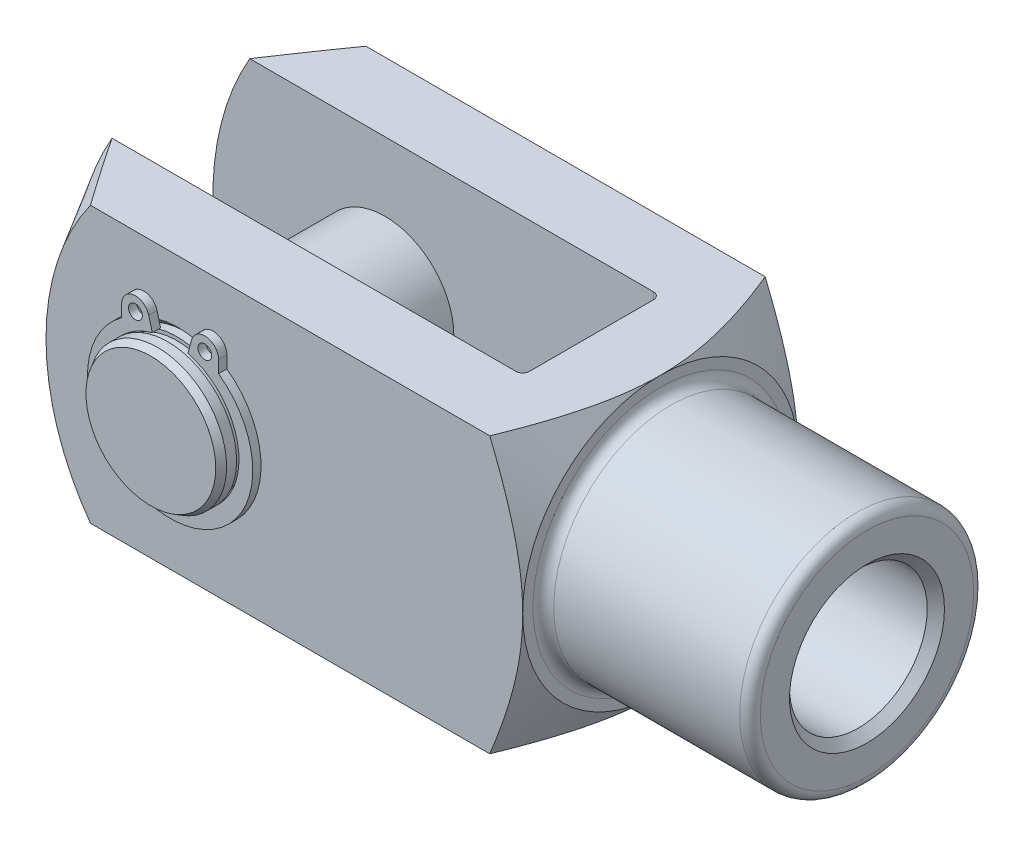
ISO-10303-21;
HEADER;
FILE_DESCRIPTION(('STEP AP214'),'2;1');
FILE_NAME('part.step','',(''),(''),'','','');
FILE_SCHEMA(('AUTOMOTIVE_DESIGN { 1 0 10303 214 1 1 1 1 }'));
ENDSEC;
DATA;
#1=APPLICATION_CONTEXT('core data for automotive mechanical design processes');
#2=APPLICATION_PROTOCOL_DEFINITION('international standard','automotive_design',2000,#1);
#3=PRODUCT_CONTEXT('',#1,'mechanical');
#4=PRODUCT('Part','Part','',(#3));
#5=PRODUCT_RELATED_PRODUCT_CATEGORY('part','',(#4));
#6=PRODUCT_DEFINITION_FORMATION('','',#4);
#7=PRODUCT_DEFINITION_CONTEXT('part definition',#1,'design');
#8=PRODUCT_DEFINITION('design','',#6,#7);
#9=PRODUCT_DEFINITION_SHAPE('','',#8);
#10=(LENGTH_UNIT() NAMED_UNIT(*) SI_UNIT(.MILLI.,.METRE.));
#11=(NAMED_UNIT(*) PLANE_ANGLE_UNIT() SI_UNIT($,.RADIAN.));
#12=(NAMED_UNIT(*) SI_UNIT($,.STERADIAN.) SOLID_ANGLE_UNIT());
#13=UNCERTAINTY_MEASURE_WITH_UNIT(LENGTH_MEASURE(1.E-05),#10,'distance_accuracy_value','');
#14=(GEOMETRIC_REPRESENTATION_CONTEXT(3) GLOBAL_UNCERTAINTY_ASSIGNED_CONTEXT((#13)) GLOBAL_UNIT_ASSIGNED_CONTEXT((#10,
#11,#12)) REPRESENTATION_CONTEXT('',''));
#15=CARTESIAN_POINT('',(0.,0.,0.));
#16=DIRECTION('',(0.,0.,1.));
#17=DIRECTION('',(1.,0.,0.));
#18=AXIS2_PLACEMENT_3D('',#15,#16,#17);
#19=CARTESIAN_POINT('',(-80.,0.,24.));
#20=DIRECTION('',(0.,0.,-1.));
#21=DIRECTION('',(-1.,0.,0.));
#22=AXIS2_PLACEMENT_3D('',#19,#20,#21);
#23=CYLINDRICAL_SURFACE('',#22,10.);
#24=CARTESIAN_POINT('',(-80.,0.,20.25));
#25=DIRECTION('',(0.,0.,1.));
#26=DIRECTION('',(1.,0.,0.));
#27=AXIS2_PLACEMENT_3D('',#24,#25,#26);
#28=CIRCLE('',#27,10.);
#29=CARTESIAN_POINT('',(-70.,0.,20.25));
#30=VERTEX_POINT('',#29);
#31=EDGE_CURVE('P0_E55',#30,#30,#28,.T.);
#32=ORIENTED_EDGE('',*,*,#31,.F.);
#33=EDGE_LOOP('',(#32));
#34=FACE_BOUND('',#33,.T.);
#35=CARTESIAN_POINT('',(-80.,0.,-20.25));
#36=DIRECTION('',(0.,0.,1.));
#37=DIRECTION('',(1.,0.,0.));
#38=AXIS2_PLACEMENT_3D('',#35,#36,#37);
#39=CIRCLE('',#38,10.);
#40=CARTESIAN_POINT('',(-70.,0.,-20.25));
#41=VERTEX_POINT('',#40);
#42=EDGE_CURVE('P0_E40',#41,#41,#39,.T.);
#43=ORIENTED_EDGE('',*,*,#42,.T.);
#44=EDGE_LOOP('',(#43));
#45=FACE_BOUND('',#44,.T.);
#46=ADVANCED_FACE('P0_F14',(#34,#45),#23,.T.);
#47=CARTESIAN_POINT('',(-80.,0.,-21.55));
#48=DIRECTION('',(0.,0.,1.));
#49=DIRECTION('',(1.,0.,0.));
#50=AXIS2_PLACEMENT_3D('',#47,#48,#49);
#51=CIRCLE('',#50,10.);
#52=CARTESIAN_POINT('',(-70.,0.,-21.55));
#53=VERTEX_POINT('',#52);
#54=EDGE_CURVE('P0_E43',#53,#53,#51,.T.);
#55=ORIENTED_EDGE('',*,*,#54,.F.);
#56=EDGE_LOOP('',(#55));
#57=FACE_BOUND('',#56,.T.);
#58=CARTESIAN_POINT('',(-80.,0.,-23.));
#59=DIRECTION('',(0.,0.,1.));
#60=DIRECTION('',(1.,0.,0.));
#61=AXIS2_PLACEMENT_3D('',#58,#59,#60);
#62=CIRCLE('',#61,10.);
#63=CARTESIAN_POINT('',(-70.,0.,-23.));
#64=VERTEX_POINT('',#63);
#65=EDGE_CURVE('P0_E25',#64,#64,#62,.T.);
#66=ORIENTED_EDGE('',*,*,#65,.T.);
#67=EDGE_LOOP('',(#66));
#68=FACE_BOUND('',#67,.T.);
#69=ADVANCED_FACE('P0_F63',(#57,#68),#23,.T.);
#70=CARTESIAN_POINT('',(-80.,0.,-24.));
#71=DIRECTION('',(0.,0.,1.));
#72=DIRECTION('',(1.,0.,0.));
#73=AXIS2_PLACEMENT_3D('',#70,#71,#72);
#74=PLANE('',#73);
#75=CARTESIAN_POINT('',(-80.,0.,-24.));
#76=DIRECTION('',(0.,0.,1.));
#77=DIRECTION('',(1.,0.,0.));
#78=AXIS2_PLACEMENT_3D('',#75,#76,#77);
#79=CIRCLE('',#78,9.42264973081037);
#80=CARTESIAN_POINT('',(-70.5773502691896,0.,-24.));
#81=VERTEX_POINT('',#80);
#82=EDGE_CURVE('P0_E21',#81,#81,#79,.F.);
#83=ORIENTED_EDGE('',*,*,#82,.T.);
#84=EDGE_LOOP('',(#83));
#85=FACE_BOUND('',#84,.T.);
#86=ADVANCED_FACE('P0_F89',(#85),#74,.F.);
#87=CARTESIAN_POINT('',(-80.,0.,-23.));
#88=DIRECTION('',(0.,0.,1.));
#89=DIRECTION('',(1.,0.,0.));
#90=AXIS2_PLACEMENT_3D('',#87,#88,#89);
#91=CONICAL_SURFACE('',#90,10.,0.523598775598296);
#92=ORIENTED_EDGE('',*,*,#82,.F.);
#93=EDGE_LOOP('',(#92));
#94=FACE_BOUND('',#93,.T.);
#95=ORIENTED_EDGE('',*,*,#65,.F.);
#96=EDGE_LOOP('',(#95));
#97=FACE_BOUND('',#96,.T.);
#98=ADVANCED_FACE('P0_F83',(#94,#97),#91,.T.);
#99=CARTESIAN_POINT('',(-80.,10.,-21.55));
#100=DIRECTION('',(0.,0.,-1.));
#101=DIRECTION('',(-1.,0.,0.));
#102=AXIS2_PLACEMENT_3D('',#99,#100,#101);
#103=PLANE('',#102);
#104=CARTESIAN_POINT('',(-80.,0.,-21.55));
#105=DIRECTION('',(0.,0.,1.));
#106=DIRECTION('',(1.,0.,0.));
#107=AXIS2_PLACEMENT_3D('',#104,#105,#106);
#108=CIRCLE('',#107,9.5);
#109=CARTESIAN_POINT('',(-70.5,0.,-21.55));
#110=VERTEX_POINT('',#109);
#111=EDGE_CURVE('P0_E34',#110,#110,#108,.T.);
#112=ORIENTED_EDGE('',*,*,#111,.F.);
#113=EDGE_LOOP('',(#112));
#114=FACE_BOUND('',#113,.T.);
#115=ORIENTED_EDGE('',*,*,#54,.T.);
#116=EDGE_LOOP('',(#115));
#117=FACE_BOUND('',#116,.T.);
#118=ADVANCED_FACE('P0_F77',(#114,#117),#103,.F.);
#119=CARTESIAN_POINT('',(-80.,0.,23.));
#120=DIRECTION('',(0.,0.,1.));
#121=DIRECTION('',(1.,0.,0.));
#122=AXIS2_PLACEMENT_3D('',#119,#120,#121);
#123=CYLINDRICAL_SURFACE('',#122,9.5);
#124=CARTESIAN_POINT('',(-80.,0.,-20.25));
#125=DIRECTION('',(0.,0.,1.));
#126=DIRECTION('',(1.,0.,0.));
#127=AXIS2_PLACEMENT_3D('',#124,#125,#126);
#128=CIRCLE('',#127,9.5);
#129=CARTESIAN_POINT('',(-70.5,0.,-20.25));
#130=VERTEX_POINT('',#129);
#131=EDGE_CURVE('P0_E37',#130,#130,#128,.T.);
#132=ORIENTED_EDGE('',*,*,#131,.F.);
#133=EDGE_LOOP('',(#132));
#134=FACE_BOUND('',#133,.T.);
#135=ORIENTED_EDGE('',*,*,#111,.T.);
#136=EDGE_LOOP('',(#135));
#137=FACE_BOUND('',#136,.T.);
#138=ADVANCED_FACE('P0_F71',(#134,#137),#123,.T.);
#139=CARTESIAN_POINT('',(-80.,10.,-20.25));
#140=DIRECTION('',(0.,0.,1.));
#141=DIRECTION('',(1.,0.,0.));
#142=AXIS2_PLACEMENT_3D('',#139,#140,#141);
#143=PLANE('',#142);
#144=ORIENTED_EDGE('',*,*,#42,.F.);
#145=EDGE_LOOP('',(#144));
#146=FACE_BOUND('',#145,.T.);
#147=ORIENTED_EDGE('',*,*,#131,.T.);
#148=EDGE_LOOP('',(#147));
#149=FACE_BOUND('',#148,.T.);
#150=ADVANCED_FACE('P0_F68',(#146,#149),#143,.F.);
#151=CARTESIAN_POINT('',(-80.,10.,20.25));
#152=DIRECTION('',(0.,0.,-1.));
#153=DIRECTION('',(-1.,0.,0.));
#154=AXIS2_PLACEMENT_3D('',#151,#152,#153);
#155=PLANE('',#154);
#156=CARTESIAN_POINT('',(-80.,0.,20.25));
#157=DIRECTION('',(0.,0.,1.));
#158=DIRECTION('',(1.,0.,0.));
#159=AXIS2_PLACEMENT_3D('',#156,#157,#158);
#160=CIRCLE('',#159,9.5);
#161=CARTESIAN_POINT('',(-70.5,0.,20.25));
#162=VERTEX_POINT('',#161);
#163=EDGE_CURVE('P0_E46',#162,#162,#160,.T.);
#164=ORIENTED_EDGE('',*,*,#163,.F.);
#165=EDGE_LOOP('',(#164));
#166=FACE_BOUND('',#165,.T.);
#167=ORIENTED_EDGE('',*,*,#31,.T.);
#168=EDGE_LOOP('',(#167));
#169=FACE_BOUND('',#168,.T.);
#170=ADVANCED_FACE('P0_F59',(#166,#169),#155,.F.);
#171=CARTESIAN_POINT('',(-80.,0.,23.));
#172=DIRECTION('',(0.,0.,1.));
#173=DIRECTION('',(1.,0.,0.));
#174=AXIS2_PLACEMENT_3D('',#171,#172,#173);
#175=CYLINDRICAL_SURFACE('',#174,9.5);
#176=CARTESIAN_POINT('',(-80.,0.,21.55));
#177=DIRECTION('',(0.,0.,1.));
#178=DIRECTION('',(1.,0.,0.));
#179=AXIS2_PLACEMENT_3D('',#176,#177,#178);
#180=CIRCLE('',#179,9.5);
#181=CARTESIAN_POINT('',(-70.5,0.,21.55));
#182=VERTEX_POINT('',#181);
#183=EDGE_CURVE('P0_E49',#182,#182,#180,.T.);
#184=ORIENTED_EDGE('',*,*,#183,.F.);
#185=EDGE_LOOP('',(#184));
#186=FACE_BOUND('',#185,.T.);
#187=ORIENTED_EDGE('',*,*,#163,.T.);
#188=EDGE_LOOP('',(#187));
#189=FACE_BOUND('',#188,.T.);
#190=ADVANCED_FACE('P0_F108',(#186,#189),#175,.T.);
#191=CARTESIAN_POINT('',(-80.,10.,21.55));
#192=DIRECTION('',(0.,0.,1.));
#193=DIRECTION('',(1.,0.,0.));
#194=AXIS2_PLACEMENT_3D('',#191,#192,#193);
#195=PLANE('',#194);
#196=CARTESIAN_POINT('',(-80.,0.,21.55));
#197=DIRECTION('',(0.,0.,1.));
#198=DIRECTION('',(1.,0.,0.));
#199=AXIS2_PLACEMENT_3D('',#196,#197,#198);
#200=CIRCLE('',#199,10.);
#201=CARTESIAN_POINT('',(-70.,0.,21.55));
#202=VERTEX_POINT('',#201);
#203=EDGE_CURVE('P0_E52',#202,#202,#200,.T.);
#204=ORIENTED_EDGE('',*,*,#203,.F.);
#205=EDGE_LOOP('',(#204));
#206=FACE_BOUND('',#205,.T.);
#207=ORIENTED_EDGE('',*,*,#183,.T.);
#208=EDGE_LOOP('',(#207));
#209=FACE_BOUND('',#208,.T.);
#210=ADVANCED_FACE('P0_F104',(#206,#209),#195,.F.);
#211=CARTESIAN_POINT('',(-80.,0.,24.));
#212=DIRECTION('',(0.,0.,1.));
#213=DIRECTION('',(1.,0.,0.));
#214=AXIS2_PLACEMENT_3D('',#211,#212,#213);
#215=PLANE('',#214);
#216=CARTESIAN_POINT('',(-80.,0.,24.));
#217=DIRECTION('',(0.,0.,1.));
#218=DIRECTION('',(1.,0.,0.));
#219=AXIS2_PLACEMENT_3D('',#216,#217,#218);
#220=CIRCLE('',#219,9.42264973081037);
#221=CARTESIAN_POINT('',(-70.5773502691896,0.,24.));
#222=VERTEX_POINT('',#221);
#223=EDGE_CURVE('P0_E10',#222,#222,#220,.T.);
#224=ORIENTED_EDGE('',*,*,#223,.T.);
#225=EDGE_LOOP('',(#224));
#226=FACE_BOUND('',#225,.T.);
#227=ADVANCED_FACE('P0_F102',(#226),#215,.T.);
#228=CARTESIAN_POINT('',(-80.,0.,24.));
#229=DIRECTION('',(0.,0.,-1.));
#230=DIRECTION('',(-1.,0.,0.));
#231=AXIS2_PLACEMENT_3D('',#228,#229,#230);
#232=CONICAL_SURFACE('',#231,9.42264973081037,0.523598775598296);
#233=CARTESIAN_POINT('',(-80.,0.,23.));
#234=DIRECTION('',(0.,0.,1.));
#235=DIRECTION('',(1.,0.,0.));
#236=AXIS2_PLACEMENT_3D('',#233,#234,#235);
#237=CIRCLE('',#236,10.);
#238=CARTESIAN_POINT('',(-70.,0.,23.));
#239=VERTEX_POINT('',#238);
#240=EDGE_CURVE('P0_E29',#239,#239,#237,.F.);
#241=ORIENTED_EDGE('',*,*,#240,.F.);
#242=EDGE_LOOP('',(#241));
#243=FACE_BOUND('',#242,.T.);
#244=ORIENTED_EDGE('',*,*,#223,.F.);
#245=EDGE_LOOP('',(#244));
#246=FACE_BOUND('',#245,.T.);
#247=ADVANCED_FACE('P0_F16',(#243,#246),#232,.T.);
#248=ORIENTED_EDGE('',*,*,#203,.T.);
#249=EDGE_LOOP('',(#248));
#250=FACE_BOUND('',#249,.T.);
#251=ORIENTED_EDGE('',*,*,#240,.T.);
#252=EDGE_LOOP('',(#251));
#253=FACE_BOUND('',#252,.T.);
#254=ADVANCED_FACE('P0_F65',(#250,#253),#23,.T.);
#255=CLOSED_SHELL('',(#46,#69,#86,#98,#118,#138,#150,#170,#190,#210,#227,#247,#254));
#256=MANIFOLD_SOLID_BREP('P0_B1',#255);
#257=CARTESIAN_POINT('',(-80.0000000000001,0.,21.1999999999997));
#258=DIRECTION('',(0.,0.,1.));
#259=DIRECTION('',(1.,0.,0.));
#260=AXIS2_PLACEMENT_3D('',#257,#258,#259);
#261=PLANE('',#260);
#262=CARTESIAN_POINT('',(-85.0376801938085,11.0734718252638,21.1999999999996));
#263=DIRECTION('',(0.,0.,1.));
#264=DIRECTION('',(1.,0.,0.));
#265=AXIS2_PLACEMENT_3D('',#262,#263,#264);
#266=CIRCLE('',#265,1.);
#267=CARTESIAN_POINT('',(-84.0376801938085,11.0734718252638,21.1999999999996));
#268=VERTEX_POINT('',#267);
#269=EDGE_CURVE('P1_E117',#268,#268,#266,.T.);
#270=ORIENTED_EDGE('',*,*,#269,.F.);
#271=EDGE_LOOP('',(#270));
#272=FACE_BOUND('',#271,.T.);
#273=CARTESIAN_POINT('',(-80.0000000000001,0.,21.1999999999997));
#274=DIRECTION('',(0.,0.,-1.));
#275=DIRECTION('',(1.,0.,0.));
#276=AXIS2_PLACEMENT_3D('',#273,#274,#275);
#277=CIRCLE('',#276,10.);
#278=CARTESIAN_POINT('',(-77.4118095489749,9.6592582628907,21.1999999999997));
#279=VERTEX_POINT('',#278);
#280=CARTESIAN_POINT('',(-82.5881904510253,9.6592582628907,21.1999999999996));
#281=VERTEX_POINT('',#280);
#282=EDGE_CURVE('P1_E128',#279,#281,#277,.T.);
#283=ORIENTED_EDGE('',*,*,#282,.T.);
#284=DIRECTION('',(-0.258819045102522,0.965925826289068,0.));
#285=VECTOR('',#284,1.);
#286=CARTESIAN_POINT('',(-82.5881904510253,9.6592582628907,21.1999999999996));
#287=LINE('',#286,#285);
#288=CARTESIAN_POINT('',(-83.1058285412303,11.5911099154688,21.1999999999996));
#289=VERTEX_POINT('',#288);
#290=EDGE_CURVE('P1_E76',#281,#289,#287,.T.);
#291=ORIENTED_EDGE('',*,*,#290,.T.);
#292=CARTESIAN_POINT('',(-85.0376801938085,11.0734718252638,21.1999999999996));
#293=DIRECTION('',(0.,0.,1.));
#294=DIRECTION('',(1.,0.,0.));
#295=AXIS2_PLACEMENT_3D('',#292,#293,#294);
#296=CIRCLE('',#295,2.);
#297=CARTESIAN_POINT('',(-87.0376801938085,11.0734718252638,21.1999999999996));
#298=VERTEX_POINT('',#297);
#299=EDGE_CURVE('P1_E143',#289,#298,#296,.T.);
#300=ORIENTED_EDGE('',*,*,#299,.T.);
#301=DIRECTION('',(0.,-1.,0.));
#302=VECTOR('',#301,1.);
#303=CARTESIAN_POINT('',(-87.0376801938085,11.0734718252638,21.1999999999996));
#304=LINE('',#303,#302);
#305=CARTESIAN_POINT('',(-87.0376801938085,9.31962229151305,21.1999999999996));
#306=VERTEX_POINT('',#305);
#307=EDGE_CURVE('P1_E156',#298,#306,#304,.T.);
#308=ORIENTED_EDGE('',*,*,#307,.T.);
#309=CARTESIAN_POINT('',(-80.0000000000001,-0.399999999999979,21.1999999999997));
#310=DIRECTION('',(0.,0.,1.));
#311=DIRECTION('',(1.,0.,0.));
#312=AXIS2_PLACEMENT_3D('',#309,#310,#311);
#313=CIRCLE('',#312,12.);
#314=CARTESIAN_POINT('',(-72.9623198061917,9.31962229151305,21.1999999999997));
#315=VERTEX_POINT('',#314);
#316=EDGE_CURVE('P1_E95',#306,#315,#313,.T.);
#317=ORIENTED_EDGE('',*,*,#316,.T.);
#318=DIRECTION('',(0.,1.,0.));
#319=VECTOR('',#318,1.);
#320=CARTESIAN_POINT('',(-72.9623198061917,11.0734718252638,21.1999999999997));
#321=LINE('',#320,#319);
#322=CARTESIAN_POINT('',(-72.9623198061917,11.0734718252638,21.1999999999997));
#323=VERTEX_POINT('',#322);
#324=EDGE_CURVE('P1_E89',#315,#323,#321,.T.);
#325=ORIENTED_EDGE('',*,*,#324,.T.);
#326=CARTESIAN_POINT('',(-74.9623198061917,11.0734718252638,21.1999999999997));
#327=DIRECTION('',(0.,0.,1.));
#328=DIRECTION('',(-1.,0.,0.));
#329=AXIS2_PLACEMENT_3D('',#326,#327,#328);
#330=CIRCLE('',#329,2.);
#331=CARTESIAN_POINT('',(-76.8941714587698,11.5911099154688,21.1999999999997));
#332=VERTEX_POINT('',#331);
#333=EDGE_CURVE('P1_E93',#323,#332,#330,.T.);
#334=ORIENTED_EDGE('',*,*,#333,.T.);
#335=DIRECTION('',(-0.258819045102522,-0.965925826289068,0.));
#336=VECTOR('',#335,1.);
#337=CARTESIAN_POINT('',(-77.4118095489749,9.6592582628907,21.1999999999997));
#338=LINE('',#337,#336);
#339=EDGE_CURVE('P1_E33',#332,#279,#338,.T.);
#340=ORIENTED_EDGE('',*,*,#339,.T.);
#341=EDGE_LOOP('',(#283,#291,#300,#308,#317,#325,#334,#340));
#342=FACE_BOUND('',#341,.T.);
#343=CARTESIAN_POINT('',(-74.9623198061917,11.0734718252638,21.1999999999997));
#344=DIRECTION('',(0.,0.,1.));
#345=DIRECTION('',(-1.,0.,0.));
#346=AXIS2_PLACEMENT_3D('',#343,#344,#345);
#347=CIRCLE('',#346,1.);
#348=CARTESIAN_POINT('',(-75.9623198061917,11.0734718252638,21.1999999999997));
#349=VERTEX_POINT('',#348);
#350=EDGE_CURVE('P1_E165',#349,#349,#347,.T.);
#351=ORIENTED_EDGE('',*,*,#350,.F.);
#352=EDGE_LOOP('',(#351));
#353=FACE_BOUND('',#352,.T.);
#354=ADVANCED_FACE('P1_F16',(#272,#342,#353),#261,.T.);
#355=CARTESIAN_POINT('',(-80.0000000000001,0.,19.9999999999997));
#356=DIRECTION('',(0.,0.,1.));
#357=DIRECTION('',(1.,0.,0.));
#358=AXIS2_PLACEMENT_3D('',#355,#356,#357);
#359=PLANE('',#358);
#360=CARTESIAN_POINT('',(-85.0376801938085,11.0734718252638,19.9999999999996));
#361=DIRECTION('',(0.,0.,1.));
#362=DIRECTION('',(1.,0.,0.));
#363=AXIS2_PLACEMENT_3D('',#360,#361,#362);
#364=CIRCLE('',#363,1.);
#365=CARTESIAN_POINT('',(-84.0376801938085,11.0734718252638,19.9999999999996));
#366=VERTEX_POINT('',#365);
#367=EDGE_CURVE('P1_E162',#366,#366,#364,.T.);
#368=ORIENTED_EDGE('',*,*,#367,.T.);
#369=EDGE_LOOP('',(#368));
#370=FACE_BOUND('',#369,.T.);
#371=CARTESIAN_POINT('',(-80.0000000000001,0.,19.9999999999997));
#372=DIRECTION('',(0.,0.,-1.));
#373=DIRECTION('',(1.,0.,0.));
#374=AXIS2_PLACEMENT_3D('',#371,#372,#373);
#375=CIRCLE('',#374,10.);
#376=CARTESIAN_POINT('',(-77.4118095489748,9.6592582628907,19.9999999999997));
#377=VERTEX_POINT('',#376);
#378=CARTESIAN_POINT('',(-82.5881904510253,9.6592582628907,19.9999999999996));
#379=VERTEX_POINT('',#378);
#380=EDGE_CURVE('P1_E113',#377,#379,#375,.T.);
#381=ORIENTED_EDGE('',*,*,#380,.F.);
#382=DIRECTION('',(-0.258819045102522,-0.965925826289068,0.));
#383=VECTOR('',#382,1.);
#384=CARTESIAN_POINT('',(-77.4118095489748,9.6592582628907,19.9999999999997));
#385=LINE('',#384,#383);
#386=CARTESIAN_POINT('',(-76.8941714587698,11.5911099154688,19.9999999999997));
#387=VERTEX_POINT('',#386);
#388=EDGE_CURVE('P1_E68',#387,#377,#385,.T.);
#389=ORIENTED_EDGE('',*,*,#388,.F.);
#390=CARTESIAN_POINT('',(-74.9623198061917,11.0734718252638,19.9999999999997));
#391=DIRECTION('',(0.,0.,1.));
#392=DIRECTION('',(-1.,0.,0.));
#393=AXIS2_PLACEMENT_3D('',#390,#391,#392);
#394=CIRCLE('',#393,2.);
#395=CARTESIAN_POINT('',(-72.9623198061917,11.0734718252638,19.9999999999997));
#396=VERTEX_POINT('',#395);
#397=EDGE_CURVE('P1_E62',#396,#387,#394,.T.);
#398=ORIENTED_EDGE('',*,*,#397,.F.);
#399=DIRECTION('',(0.,1.,0.));
#400=VECTOR('',#399,1.);
#401=CARTESIAN_POINT('',(-72.9623198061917,11.0734718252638,19.9999999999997));
#402=LINE('',#401,#400);
#403=CARTESIAN_POINT('',(-72.9623198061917,9.31962229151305,19.9999999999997));
#404=VERTEX_POINT('',#403);
#405=EDGE_CURVE('P1_E103',#404,#396,#402,.T.);
#406=ORIENTED_EDGE('',*,*,#405,.F.);
#407=CARTESIAN_POINT('',(-80.0000000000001,-0.399999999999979,19.9999999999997));
#408=DIRECTION('',(0.,0.,1.));
#409=DIRECTION('',(1.,0.,0.));
#410=AXIS2_PLACEMENT_3D('',#407,#408,#409);
#411=CIRCLE('',#410,12.);
#412=CARTESIAN_POINT('',(-87.0376801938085,9.31962229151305,19.9999999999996));
#413=VERTEX_POINT('',#412);
#414=EDGE_CURVE('P1_E123',#413,#404,#411,.T.);
#415=ORIENTED_EDGE('',*,*,#414,.F.);
#416=DIRECTION('',(0.,-1.,0.));
#417=VECTOR('',#416,1.);
#418=CARTESIAN_POINT('',(-87.0376801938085,11.0734718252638,19.9999999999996));
#419=LINE('',#418,#417);
#420=CARTESIAN_POINT('',(-87.0376801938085,11.0734718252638,19.9999999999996));
#421=VERTEX_POINT('',#420);
#422=EDGE_CURVE('P1_E121',#421,#413,#419,.T.);
#423=ORIENTED_EDGE('',*,*,#422,.F.);
#424=CARTESIAN_POINT('',(-85.0376801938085,11.0734718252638,19.9999999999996));
#425=DIRECTION('',(0.,0.,1.));
#426=DIRECTION('',(1.,0.,0.));
#427=AXIS2_PLACEMENT_3D('',#424,#425,#426);
#428=CIRCLE('',#427,2.);
#429=CARTESIAN_POINT('',(-83.1058285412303,11.5911099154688,19.9999999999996));
#430=VERTEX_POINT('',#429);
#431=EDGE_CURVE('P1_E119',#430,#421,#428,.T.);
#432=ORIENTED_EDGE('',*,*,#431,.F.);
#433=DIRECTION('',(-0.258819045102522,0.965925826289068,0.));
#434=VECTOR('',#433,1.);
#435=CARTESIAN_POINT('',(-82.5881904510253,9.6592582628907,19.9999999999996));
#436=LINE('',#435,#434);
#437=EDGE_CURVE('P1_E116',#379,#430,#436,.T.);
#438=ORIENTED_EDGE('',*,*,#437,.F.);
#439=EDGE_LOOP('',(#381,#389,#398,#406,#415,#423,#432,#438));
#440=FACE_BOUND('',#439,.T.);
#441=CARTESIAN_POINT('',(-74.9623198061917,11.0734718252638,19.9999999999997));
#442=DIRECTION('',(0.,0.,1.));
#443=DIRECTION('',(-1.,0.,0.));
#444=AXIS2_PLACEMENT_3D('',#441,#442,#443);
#445=CIRCLE('',#444,1.);
#446=CARTESIAN_POINT('',(-75.9623198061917,11.0734718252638,19.9999999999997));
#447=VERTEX_POINT('',#446);
#448=EDGE_CURVE('P1_E168',#447,#447,#445,.T.);
#449=ORIENTED_EDGE('',*,*,#448,.T.);
#450=EDGE_LOOP('',(#449));
#451=FACE_BOUND('',#450,.T.);
#452=ADVANCED_FACE('P1_F147',(#370,#440,#451),#359,.F.);
#453=CARTESIAN_POINT('',(-80.0000000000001,0.,21.1999999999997));
#454=DIRECTION('',(0.,0.,-1.));
#455=DIRECTION('',(-1.,0.,0.));
#456=AXIS2_PLACEMENT_3D('',#453,#454,#455);
#457=CYLINDRICAL_SURFACE('',#456,10.);
#458=ORIENTED_EDGE('',*,*,#380,.T.);
#459=DIRECTION('',(0.,0.,-1.));
#460=VECTOR('',#459,1.);
#461=CARTESIAN_POINT('',(-82.5881904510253,9.6592582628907,21.1999999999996));
#462=LINE('',#461,#460);
#463=EDGE_CURVE('P1_E11',#281,#379,#462,.T.);
#464=ORIENTED_EDGE('',*,*,#463,.F.);
#465=ORIENTED_EDGE('',*,*,#282,.F.);
#466=DIRECTION('',(0.,0.,-1.));
#467=VECTOR('',#466,1.);
#468=CARTESIAN_POINT('',(-77.4118095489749,9.6592582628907,21.1999999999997));
#469=LINE('',#468,#467);
#470=EDGE_CURVE('P1_E109',#279,#377,#469,.T.);
#471=ORIENTED_EDGE('',*,*,#470,.T.);
#472=EDGE_LOOP('',(#458,#464,#465,#471));
#473=FACE_BOUND('',#472,.T.);
#474=ADVANCED_FACE('P1_F18',(#473),#457,.F.);
#475=CARTESIAN_POINT('',(-82.5881904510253,9.6592582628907,21.1999999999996));
#476=DIRECTION('',(-0.965925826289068,-0.258819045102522,0.));
#477=DIRECTION('',(0.258819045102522,-0.965925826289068,0.));
#478=AXIS2_PLACEMENT_3D('',#475,#476,#477);
#479=PLANE('',#478);
#480=ORIENTED_EDGE('',*,*,#437,.T.);
#481=DIRECTION('',(0.,0.,-1.));
#482=VECTOR('',#481,1.);
#483=CARTESIAN_POINT('',(-83.1058285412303,11.5911099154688,21.1999999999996));
#484=LINE('',#483,#482);
#485=EDGE_CURVE('P1_E25',#289,#430,#484,.T.);
#486=ORIENTED_EDGE('',*,*,#485,.F.);
#487=ORIENTED_EDGE('',*,*,#290,.F.);
#488=ORIENTED_EDGE('',*,*,#463,.T.);
#489=EDGE_LOOP('',(#480,#486,#487,#488));
#490=FACE_BOUND('',#489,.T.);
#491=ADVANCED_FACE('P1_F202',(#490),#479,.F.);
#492=CARTESIAN_POINT('',(-85.0376801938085,11.0734718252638,21.1999999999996));
#493=DIRECTION('',(0.,0.,-1.));
#494=DIRECTION('',(-1.,0.,0.));
#495=AXIS2_PLACEMENT_3D('',#492,#493,#494);
#496=CYLINDRICAL_SURFACE('',#495,2.);
#497=ORIENTED_EDGE('',*,*,#431,.T.);
#498=DIRECTION('',(0.,0.,-1.));
#499=VECTOR('',#498,1.);
#500=CARTESIAN_POINT('',(-87.0376801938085,11.0734718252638,21.1999999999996));
#501=LINE('',#500,#499);
#502=EDGE_CURVE('P1_E135',#298,#421,#501,.T.);
#503=ORIENTED_EDGE('',*,*,#502,.F.);
#504=ORIENTED_EDGE('',*,*,#299,.F.);
#505=ORIENTED_EDGE('',*,*,#485,.T.);
#506=EDGE_LOOP('',(#497,#503,#504,#505));
#507=FACE_BOUND('',#506,.T.);
#508=ADVANCED_FACE('P1_F141',(#507),#496,.T.);
#509=CARTESIAN_POINT('',(-87.0376801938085,11.0734718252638,21.1999999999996));
#510=DIRECTION('',(1.,0.,0.));
#511=DIRECTION('',(0.,1.,0.));
#512=AXIS2_PLACEMENT_3D('',#509,#510,#511);
#513=PLANE('',#512);
#514=ORIENTED_EDGE('',*,*,#422,.T.);
#515=DIRECTION('',(0.,0.,-1.));
#516=VECTOR('',#515,1.);
#517=CARTESIAN_POINT('',(-87.0376801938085,9.31962229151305,21.1999999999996));
#518=LINE('',#517,#516);
#519=EDGE_CURVE('P1_E132',#306,#413,#518,.T.);
#520=ORIENTED_EDGE('',*,*,#519,.F.);
#521=ORIENTED_EDGE('',*,*,#307,.F.);
#522=ORIENTED_EDGE('',*,*,#502,.T.);
#523=EDGE_LOOP('',(#514,#520,#521,#522));
#524=FACE_BOUND('',#523,.T.);
#525=ADVANCED_FACE('P1_F152',(#524),#513,.F.);
#526=CARTESIAN_POINT('',(-80.0000000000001,-0.399999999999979,21.1999999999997));
#527=DIRECTION('',(0.,0.,-1.));
#528=DIRECTION('',(-1.,0.,0.));
#529=AXIS2_PLACEMENT_3D('',#526,#527,#528);
#530=CYLINDRICAL_SURFACE('',#529,12.);
#531=ORIENTED_EDGE('',*,*,#414,.T.);
#532=DIRECTION('',(0.,0.,-1.));
#533=VECTOR('',#532,1.);
#534=CARTESIAN_POINT('',(-72.9623198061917,9.31962229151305,21.1999999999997));
#535=LINE('',#534,#533);
#536=EDGE_CURVE('P1_E104',#315,#404,#535,.T.);
#537=ORIENTED_EDGE('',*,*,#536,.F.);
#538=ORIENTED_EDGE('',*,*,#316,.F.);
#539=ORIENTED_EDGE('',*,*,#519,.T.);
#540=EDGE_LOOP('',(#531,#537,#538,#539));
#541=FACE_BOUND('',#540,.T.);
#542=ADVANCED_FACE('P1_F155',(#541),#530,.T.);
#543=CARTESIAN_POINT('',(-72.9623198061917,11.0734718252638,21.1999999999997));
#544=DIRECTION('',(-1.,0.,0.));
#545=DIRECTION('',(0.,-1.,0.));
#546=AXIS2_PLACEMENT_3D('',#543,#544,#545);
#547=PLANE('',#546);
#548=ORIENTED_EDGE('',*,*,#405,.T.);
#549=DIRECTION('',(0.,0.,-1.));
#550=VECTOR('',#549,1.);
#551=CARTESIAN_POINT('',(-72.9623198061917,11.0734718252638,21.1999999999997));
#552=LINE('',#551,#550);
#553=EDGE_CURVE('P1_E100',#323,#396,#552,.T.);
#554=ORIENTED_EDGE('',*,*,#553,.F.);
#555=ORIENTED_EDGE('',*,*,#324,.F.);
#556=ORIENTED_EDGE('',*,*,#536,.T.);
#557=EDGE_LOOP('',(#548,#554,#555,#556));
#558=FACE_BOUND('',#557,.T.);
#559=ADVANCED_FACE('P1_F101',(#558),#547,.F.);
#560=CARTESIAN_POINT('',(-74.9623198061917,11.0734718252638,21.1999999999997));
#561=DIRECTION('',(0.,0.,-1.));
#562=DIRECTION('',(-1.,0.,0.));
#563=AXIS2_PLACEMENT_3D('',#560,#561,#562);
#564=CYLINDRICAL_SURFACE('',#563,2.);
#565=ORIENTED_EDGE('',*,*,#397,.T.);
#566=DIRECTION('',(0.,0.,-1.));
#567=VECTOR('',#566,1.);
#568=CARTESIAN_POINT('',(-76.8941714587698,11.5911099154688,21.1999999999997));
#569=LINE('',#568,#567);
#570=EDGE_CURVE('P1_E105',#332,#387,#569,.T.);
#571=ORIENTED_EDGE('',*,*,#570,.F.);
#572=ORIENTED_EDGE('',*,*,#333,.F.);
#573=ORIENTED_EDGE('',*,*,#553,.T.);
#574=EDGE_LOOP('',(#565,#571,#572,#573));
#575=FACE_BOUND('',#574,.T.);
#576=ADVANCED_FACE('P1_F107',(#575),#564,.T.);
#577=CARTESIAN_POINT('',(-77.4118095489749,9.6592582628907,21.1999999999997));
#578=DIRECTION('',(0.965925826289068,-0.258819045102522,0.));
#579=DIRECTION('',(0.258819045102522,0.965925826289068,0.));
#580=AXIS2_PLACEMENT_3D('',#577,#578,#579);
#581=PLANE('',#580);
#582=ORIENTED_EDGE('',*,*,#388,.T.);
#583=ORIENTED_EDGE('',*,*,#470,.F.);
#584=ORIENTED_EDGE('',*,*,#339,.F.);
#585=ORIENTED_EDGE('',*,*,#570,.T.);
#586=EDGE_LOOP('',(#582,#583,#584,#585));
#587=FACE_BOUND('',#586,.T.);
#588=ADVANCED_FACE('P1_F190',(#587),#581,.F.);
#589=CARTESIAN_POINT('',(-85.0376801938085,11.0734718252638,21.1999999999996));
#590=DIRECTION('',(0.,0.,-1.));
#591=DIRECTION('',(-1.,0.,0.));
#592=AXIS2_PLACEMENT_3D('',#589,#590,#591);
#593=CYLINDRICAL_SURFACE('',#592,1.);
#594=ORIENTED_EDGE('',*,*,#269,.T.);
#595=EDGE_LOOP('',(#594));
#596=FACE_BOUND('',#595,.T.);
#597=ORIENTED_EDGE('',*,*,#367,.F.);
#598=EDGE_LOOP('',(#597));
#599=FACE_BOUND('',#598,.T.);
#600=ADVANCED_FACE('P1_F187',(#596,#599),#593,.F.);
#601=CARTESIAN_POINT('',(-74.9623198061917,11.0734718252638,21.1999999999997));
#602=DIRECTION('',(0.,0.,-1.));
#603=DIRECTION('',(-1.,0.,0.));
#604=AXIS2_PLACEMENT_3D('',#601,#602,#603);
#605=CYLINDRICAL_SURFACE('',#604,1.);
#606=ORIENTED_EDGE('',*,*,#350,.T.);
#607=EDGE_LOOP('',(#606));
#608=FACE_BOUND('',#607,.T.);
#609=ORIENTED_EDGE('',*,*,#448,.F.);
#610=EDGE_LOOP('',(#609));
#611=FACE_BOUND('',#610,.T.);
#612=ADVANCED_FACE('P1_F174',(#608,#611),#605,.F.);
#613=CLOSED_SHELL('',(#354,#452,#474,#491,#508,#525,#542,#559,#576,#588,#600,#612));
#614=MANIFOLD_SOLID_BREP('P1_B1',#613);
#615=CARTESIAN_POINT('',(-80.0000000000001,0.,-21.1999999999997));
#616=DIRECTION('',(0.,0.,-1.));
#617=DIRECTION('',(-1.,0.,0.));
#618=AXIS2_PLACEMENT_3D('',#615,#616,#617);
#619=PLANE('',#618);
#620=CARTESIAN_POINT('',(-74.9623198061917,11.0734718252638,-21.1999999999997));
#621=DIRECTION('',(0.,0.,-1.));
#622=DIRECTION('',(-1.,0.,0.));
#623=AXIS2_PLACEMENT_3D('',#620,#621,#622);
#624=CIRCLE('',#623,1.);
#625=CARTESIAN_POINT('',(-75.9623198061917,11.0734718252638,-21.1999999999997));
#626=VERTEX_POINT('',#625);
#627=EDGE_CURVE('P2_E117',#626,#626,#624,.T.);
#628=ORIENTED_EDGE('',*,*,#627,.F.);
#629=EDGE_LOOP('',(#628));
#630=FACE_BOUND('',#629,.T.);
#631=CARTESIAN_POINT('',(-80.0000000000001,0.,-21.1999999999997));
#632=DIRECTION('',(0.,0.,1.));
#633=DIRECTION('',(-1.,0.,0.));
#634=AXIS2_PLACEMENT_3D('',#631,#632,#633);
#635=CIRCLE('',#634,10.);
#636=CARTESIAN_POINT('',(-82.5881904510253,9.65925826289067,-21.1999999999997));
#637=VERTEX_POINT('',#636);
#638=CARTESIAN_POINT('',(-77.4118095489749,9.65925826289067,-21.1999999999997));
#639=VERTEX_POINT('',#638);
#640=EDGE_CURVE('P2_E128',#637,#639,#635,.T.);
#641=ORIENTED_EDGE('',*,*,#640,.T.);
#642=DIRECTION('',(0.258819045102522,0.965925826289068,0.));
#643=VECTOR('',#642,1.);
#644=CARTESIAN_POINT('',(-77.4118095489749,9.65925826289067,-21.1999999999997));
#645=LINE('',#644,#643);
#646=CARTESIAN_POINT('',(-76.8941714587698,11.5911099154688,-21.1999999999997));
#647=VERTEX_POINT('',#646);
#648=EDGE_CURVE('P2_E76',#639,#647,#645,.T.);
#649=ORIENTED_EDGE('',*,*,#648,.T.);
#650=CARTESIAN_POINT('',(-74.9623198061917,11.0734718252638,-21.1999999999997));
#651=DIRECTION('',(0.,0.,-1.));
#652=DIRECTION('',(-1.,0.,0.));
#653=AXIS2_PLACEMENT_3D('',#650,#651,#652);
#654=CIRCLE('',#653,2.);
#655=CARTESIAN_POINT('',(-72.9623198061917,11.0734718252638,-21.1999999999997));
#656=VERTEX_POINT('',#655);
#657=EDGE_CURVE('P2_E143',#647,#656,#654,.T.);
#658=ORIENTED_EDGE('',*,*,#657,.T.);
#659=DIRECTION('',(0.,-1.,0.));
#660=VECTOR('',#659,1.);
#661=CARTESIAN_POINT('',(-72.9623198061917,11.0734718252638,-21.1999999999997));
#662=LINE('',#661,#660);
#663=CARTESIAN_POINT('',(-72.9623198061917,9.31962229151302,-21.1999999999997));
#664=VERTEX_POINT('',#663);
#665=EDGE_CURVE('P2_E156',#656,#664,#662,.T.);
#666=ORIENTED_EDGE('',*,*,#665,.T.);
#667=CARTESIAN_POINT('',(-80.0000000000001,-0.400000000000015,-21.1999999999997));
#668=DIRECTION('',(0.,0.,-1.));
#669=DIRECTION('',(-1.,0.,0.));
#670=AXIS2_PLACEMENT_3D('',#667,#668,#669);
#671=CIRCLE('',#670,12.);
#672=CARTESIAN_POINT('',(-87.0376801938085,9.31962229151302,-21.1999999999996));
#673=VERTEX_POINT('',#672);
#674=EDGE_CURVE('P2_E95',#664,#673,#671,.T.);
#675=ORIENTED_EDGE('',*,*,#674,.T.);
#676=DIRECTION('',(0.,1.,0.));
#677=VECTOR('',#676,1.);
#678=CARTESIAN_POINT('',(-87.0376801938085,11.0734718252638,-21.1999999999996));
#679=LINE('',#678,#677);
#680=CARTESIAN_POINT('',(-87.0376801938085,11.0734718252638,-21.1999999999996));
#681=VERTEX_POINT('',#680);
#682=EDGE_CURVE('P2_E89',#673,#681,#679,.T.);
#683=ORIENTED_EDGE('',*,*,#682,.T.);
#684=CARTESIAN_POINT('',(-85.0376801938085,11.0734718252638,-21.1999999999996));
#685=DIRECTION('',(0.,0.,-1.));
#686=DIRECTION('',(1.,0.,0.));
#687=AXIS2_PLACEMENT_3D('',#684,#685,#686);
#688=CIRCLE('',#687,2.);
#689=CARTESIAN_POINT('',(-83.1058285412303,11.5911099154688,-21.1999999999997));
#690=VERTEX_POINT('',#689);
#691=EDGE_CURVE('P2_E93',#681,#690,#688,.T.);
#692=ORIENTED_EDGE('',*,*,#691,.T.);
#693=DIRECTION('',(0.258819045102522,-0.965925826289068,0.));
#694=VECTOR('',#693,1.);
#695=CARTESIAN_POINT('',(-82.5881904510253,9.65925826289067,-21.1999999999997));
#696=LINE('',#695,#694);
#697=EDGE_CURVE('P2_E33',#690,#637,#696,.T.);
#698=ORIENTED_EDGE('',*,*,#697,.T.);
#699=EDGE_LOOP('',(#641,#649,#658,#666,#675,#683,#692,#698));
#700=FACE_BOUND('',#699,.T.);
#701=CARTESIAN_POINT('',(-85.0376801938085,11.0734718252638,-21.1999999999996));
#702=DIRECTION('',(0.,0.,-1.));
#703=DIRECTION('',(1.,0.,0.));
#704=AXIS2_PLACEMENT_3D('',#701,#702,#703);
#705=CIRCLE('',#704,1.);
#706=CARTESIAN_POINT('',(-84.0376801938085,11.0734718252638,-21.1999999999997));
#707=VERTEX_POINT('',#706);
#708=EDGE_CURVE('P2_E165',#707,#707,#705,.T.);
#709=ORIENTED_EDGE('',*,*,#708,.F.);
#710=EDGE_LOOP('',(#709));
#711=FACE_BOUND('',#710,.T.);
#712=ADVANCED_FACE('P2_F16',(#630,#700,#711),#619,.T.);
#713=CARTESIAN_POINT('',(-80.0000000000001,0.,-19.9999999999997));
#714=DIRECTION('',(0.,0.,-1.));
#715=DIRECTION('',(-1.,0.,0.));
#716=AXIS2_PLACEMENT_3D('',#713,#714,#715);
#717=PLANE('',#716);
#718=CARTESIAN_POINT('',(-74.9623198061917,11.0734718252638,-19.9999999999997));
#719=DIRECTION('',(0.,0.,-1.));
#720=DIRECTION('',(-1.,0.,0.));
#721=AXIS2_PLACEMENT_3D('',#718,#719,#720);
#722=CIRCLE('',#721,1.);
#723=CARTESIAN_POINT('',(-75.9623198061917,11.0734718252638,-19.9999999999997));
#724=VERTEX_POINT('',#723);
#725=EDGE_CURVE('P2_E162',#724,#724,#722,.T.);
#726=ORIENTED_EDGE('',*,*,#725,.T.);
#727=EDGE_LOOP('',(#726));
#728=FACE_BOUND('',#727,.T.);
#729=CARTESIAN_POINT('',(-80.0000000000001,0.,-19.9999999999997));
#730=DIRECTION('',(0.,0.,1.));
#731=DIRECTION('',(-1.,0.,0.));
#732=AXIS2_PLACEMENT_3D('',#729,#730,#731);
#733=CIRCLE('',#732,10.);
#734=CARTESIAN_POINT('',(-82.5881904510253,9.65925826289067,-19.9999999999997));
#735=VERTEX_POINT('',#734);
#736=CARTESIAN_POINT('',(-77.4118095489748,9.65925826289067,-19.9999999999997));
#737=VERTEX_POINT('',#736);
#738=EDGE_CURVE('P2_E113',#735,#737,#733,.T.);
#739=ORIENTED_EDGE('',*,*,#738,.F.);
#740=DIRECTION('',(0.258819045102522,-0.965925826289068,0.));
#741=VECTOR('',#740,1.);
#742=CARTESIAN_POINT('',(-82.5881904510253,9.65925826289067,-19.9999999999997));
#743=LINE('',#742,#741);
#744=CARTESIAN_POINT('',(-83.1058285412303,11.5911099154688,-19.9999999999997));
#745=VERTEX_POINT('',#744);
#746=EDGE_CURVE('P2_E68',#745,#735,#743,.T.);
#747=ORIENTED_EDGE('',*,*,#746,.F.);
#748=CARTESIAN_POINT('',(-85.0376801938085,11.0734718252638,-19.9999999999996));
#749=DIRECTION('',(0.,0.,-1.));
#750=DIRECTION('',(1.,0.,0.));
#751=AXIS2_PLACEMENT_3D('',#748,#749,#750);
#752=CIRCLE('',#751,2.);
#753=CARTESIAN_POINT('',(-87.0376801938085,11.0734718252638,-19.9999999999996));
#754=VERTEX_POINT('',#753);
#755=EDGE_CURVE('P2_E62',#754,#745,#752,.T.);
#756=ORIENTED_EDGE('',*,*,#755,.F.);
#757=DIRECTION('',(0.,1.,0.));
#758=VECTOR('',#757,1.);
#759=CARTESIAN_POINT('',(-87.0376801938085,11.0734718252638,-19.9999999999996));
#760=LINE('',#759,#758);
#761=CARTESIAN_POINT('',(-87.0376801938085,9.31962229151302,-19.9999999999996));
#762=VERTEX_POINT('',#761);
#763=EDGE_CURVE('P2_E103',#762,#754,#760,.T.);
#764=ORIENTED_EDGE('',*,*,#763,.F.);
#765=CARTESIAN_POINT('',(-80.0000000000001,-0.400000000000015,-19.9999999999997));
#766=DIRECTION('',(0.,0.,-1.));
#767=DIRECTION('',(-1.,0.,0.));
#768=AXIS2_PLACEMENT_3D('',#765,#766,#767);
#769=CIRCLE('',#768,12.);
#770=CARTESIAN_POINT('',(-72.9623198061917,9.31962229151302,-19.9999999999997));
#771=VERTEX_POINT('',#770);
#772=EDGE_CURVE('P2_E123',#771,#762,#769,.T.);
#773=ORIENTED_EDGE('',*,*,#772,.F.);
#774=DIRECTION('',(0.,-1.,0.));
#775=VECTOR('',#774,1.);
#776=CARTESIAN_POINT('',(-72.9623198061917,11.0734718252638,-19.9999999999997));
#777=LINE('',#776,#775);
#778=CARTESIAN_POINT('',(-72.9623198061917,11.0734718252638,-19.9999999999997));
#779=VERTEX_POINT('',#778);
#780=EDGE_CURVE('P2_E121',#779,#771,#777,.T.);
#781=ORIENTED_EDGE('',*,*,#780,.F.);
#782=CARTESIAN_POINT('',(-74.9623198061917,11.0734718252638,-19.9999999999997));
#783=DIRECTION('',(0.,0.,-1.));
#784=DIRECTION('',(-1.,0.,0.));
#785=AXIS2_PLACEMENT_3D('',#782,#783,#784);
#786=CIRCLE('',#785,2.);
#787=CARTESIAN_POINT('',(-76.8941714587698,11.5911099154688,-19.9999999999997));
#788=VERTEX_POINT('',#787);
#789=EDGE_CURVE('P2_E119',#788,#779,#786,.T.);
#790=ORIENTED_EDGE('',*,*,#789,.F.);
#791=DIRECTION('',(0.258819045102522,0.965925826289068,0.));
#792=VECTOR('',#791,1.);
#793=CARTESIAN_POINT('',(-77.4118095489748,9.65925826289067,-19.9999999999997));
#794=LINE('',#793,#792);
#795=EDGE_CURVE('P2_E116',#737,#788,#794,.T.);
#796=ORIENTED_EDGE('',*,*,#795,.F.);
#797=EDGE_LOOP('',(#739,#747,#756,#764,#773,#781,#790,#796));
#798=FACE_BOUND('',#797,.T.);
#799=CARTESIAN_POINT('',(-85.0376801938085,11.0734718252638,-19.9999999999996));
#800=DIRECTION('',(0.,0.,-1.));
#801=DIRECTION('',(1.,0.,0.));
#802=AXIS2_PLACEMENT_3D('',#799,#800,#801);
#803=CIRCLE('',#802,1.);
#804=CARTESIAN_POINT('',(-84.0376801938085,11.0734718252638,-19.9999999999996));
#805=VERTEX_POINT('',#804);
#806=EDGE_CURVE('P2_E168',#805,#805,#803,.T.);
#807=ORIENTED_EDGE('',*,*,#806,.T.);
#808=EDGE_LOOP('',(#807));
#809=FACE_BOUND('',#808,.T.);
#810=ADVANCED_FACE('P2_F147',(#728,#798,#809),#717,.F.);
#811=CARTESIAN_POINT('',(-80.0000000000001,0.,-21.1999999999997));
#812=DIRECTION('',(0.,0.,1.));
#813=DIRECTION('',(1.,0.,0.));
#814=AXIS2_PLACEMENT_3D('',#811,#812,#813);
#815=CYLINDRICAL_SURFACE('',#814,10.);
#816=ORIENTED_EDGE('',*,*,#738,.T.);
#817=DIRECTION('',(0.,0.,1.));
#818=VECTOR('',#817,1.);
#819=CARTESIAN_POINT('',(-77.4118095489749,9.65925826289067,-21.1999999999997));
#820=LINE('',#819,#818);
#821=EDGE_CURVE('P2_E11',#639,#737,#820,.T.);
#822=ORIENTED_EDGE('',*,*,#821,.F.);
#823=ORIENTED_EDGE('',*,*,#640,.F.);
#824=DIRECTION('',(0.,0.,1.));
#825=VECTOR('',#824,1.);
#826=CARTESIAN_POINT('',(-82.5881904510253,9.65925826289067,-21.1999999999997));
#827=LINE('',#826,#825);
#828=EDGE_CURVE('P2_E109',#637,#735,#827,.T.);
#829=ORIENTED_EDGE('',*,*,#828,.T.);
#830=EDGE_LOOP('',(#816,#822,#823,#829));
#831=FACE_BOUND('',#830,.T.);
#832=ADVANCED_FACE('P2_F18',(#831),#815,.F.);
#833=CARTESIAN_POINT('',(-77.4118095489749,9.65925826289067,-21.1999999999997));
#834=DIRECTION('',(0.965925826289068,-0.258819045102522,0.));
#835=DIRECTION('',(-0.258819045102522,-0.965925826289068,0.));
#836=AXIS2_PLACEMENT_3D('',#833,#834,#835);
#837=PLANE('',#836);
#838=ORIENTED_EDGE('',*,*,#795,.T.);
#839=DIRECTION('',(0.,0.,1.));
#840=VECTOR('',#839,1.);
#841=CARTESIAN_POINT('',(-76.8941714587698,11.5911099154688,-21.1999999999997));
#842=LINE('',#841,#840);
#843=EDGE_CURVE('P2_E25',#647,#788,#842,.T.);
#844=ORIENTED_EDGE('',*,*,#843,.F.);
#845=ORIENTED_EDGE('',*,*,#648,.F.);
#846=ORIENTED_EDGE('',*,*,#821,.T.);
#847=EDGE_LOOP('',(#838,#844,#845,#846));
#848=FACE_BOUND('',#847,.T.);
#849=ADVANCED_FACE('P2_F202',(#848),#837,.F.);
#850=CARTESIAN_POINT('',(-74.9623198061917,11.0734718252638,-21.1999999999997));
#851=DIRECTION('',(0.,0.,1.));
#852=DIRECTION('',(1.,0.,0.));
#853=AXIS2_PLACEMENT_3D('',#850,#851,#852);
#854=CYLINDRICAL_SURFACE('',#853,2.);
#855=ORIENTED_EDGE('',*,*,#789,.T.);
#856=DIRECTION('',(0.,0.,1.));
#857=VECTOR('',#856,1.);
#858=CARTESIAN_POINT('',(-72.9623198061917,11.0734718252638,-21.1999999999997));
#859=LINE('',#858,#857);
#860=EDGE_CURVE('P2_E135',#656,#779,#859,.T.);
#861=ORIENTED_EDGE('',*,*,#860,.F.);
#862=ORIENTED_EDGE('',*,*,#657,.F.);
#863=ORIENTED_EDGE('',*,*,#843,.T.);
#864=EDGE_LOOP('',(#855,#861,#862,#863));
#865=FACE_BOUND('',#864,.T.);
#866=ADVANCED_FACE('P2_F141',(#865),#854,.T.);
#867=CARTESIAN_POINT('',(-72.9623198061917,11.0734718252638,-21.1999999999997));
#868=DIRECTION('',(-1.,0.,0.));
#869=DIRECTION('',(0.,1.,0.));
#870=AXIS2_PLACEMENT_3D('',#867,#868,#869);
#871=PLANE('',#870);
#872=ORIENTED_EDGE('',*,*,#780,.T.);
#873=DIRECTION('',(0.,0.,1.));
#874=VECTOR('',#873,1.);
#875=CARTESIAN_POINT('',(-72.9623198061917,9.31962229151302,-21.1999999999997));
#876=LINE('',#875,#874);
#877=EDGE_CURVE('P2_E132',#664,#771,#876,.T.);
#878=ORIENTED_EDGE('',*,*,#877,.F.);
#879=ORIENTED_EDGE('',*,*,#665,.F.);
#880=ORIENTED_EDGE('',*,*,#860,.T.);
#881=EDGE_LOOP('',(#872,#878,#879,#880));
#882=FACE_BOUND('',#881,.T.);
#883=ADVANCED_FACE('P2_F152',(#882),#871,.F.);
#884=CARTESIAN_POINT('',(-80.0000000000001,-0.400000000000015,-21.1999999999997));
#885=DIRECTION('',(0.,0.,1.));
#886=DIRECTION('',(1.,0.,0.));
#887=AXIS2_PLACEMENT_3D('',#884,#885,#886);
#888=CYLINDRICAL_SURFACE('',#887,12.);
#889=ORIENTED_EDGE('',*,*,#772,.T.);
#890=DIRECTION('',(0.,0.,1.));
#891=VECTOR('',#890,1.);
#892=CARTESIAN_POINT('',(-87.0376801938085,9.31962229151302,-21.1999999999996));
#893=LINE('',#892,#891);
#894=EDGE_CURVE('P2_E104',#673,#762,#893,.T.);
#895=ORIENTED_EDGE('',*,*,#894,.F.);
#896=ORIENTED_EDGE('',*,*,#674,.F.);
#897=ORIENTED_EDGE('',*,*,#877,.T.);
#898=EDGE_LOOP('',(#889,#895,#896,#897));
#899=FACE_BOUND('',#898,.T.);
#900=ADVANCED_FACE('P2_F155',(#899),#888,.T.);
#901=CARTESIAN_POINT('',(-87.0376801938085,11.0734718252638,-21.1999999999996));
#902=DIRECTION('',(1.,0.,0.));
#903=DIRECTION('',(0.,-1.,0.));
#904=AXIS2_PLACEMENT_3D('',#901,#902,#903);
#905=PLANE('',#904);
#906=ORIENTED_EDGE('',*,*,#763,.T.);
#907=DIRECTION('',(0.,0.,1.));
#908=VECTOR('',#907,1.);
#909=CARTESIAN_POINT('',(-87.0376801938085,11.0734718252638,-21.1999999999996));
#910=LINE('',#909,#908);
#911=EDGE_CURVE('P2_E100',#681,#754,#910,.T.);
#912=ORIENTED_EDGE('',*,*,#911,.F.);
#913=ORIENTED_EDGE('',*,*,#682,.F.);
#914=ORIENTED_EDGE('',*,*,#894,.T.);
#915=EDGE_LOOP('',(#906,#912,#913,#914));
#916=FACE_BOUND('',#915,.T.);
#917=ADVANCED_FACE('P2_F101',(#916),#905,.F.);
#918=CARTESIAN_POINT('',(-85.0376801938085,11.0734718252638,-21.1999999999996));
#919=DIRECTION('',(0.,0.,1.));
#920=DIRECTION('',(1.,0.,0.));
#921=AXIS2_PLACEMENT_3D('',#918,#919,#920);
#922=CYLINDRICAL_SURFACE('',#921,2.);
#923=ORIENTED_EDGE('',*,*,#755,.T.);
#924=DIRECTION('',(0.,0.,1.));
#925=VECTOR('',#924,1.);
#926=CARTESIAN_POINT('',(-83.1058285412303,11.5911099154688,-21.1999999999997));
#927=LINE('',#926,#925);
#928=EDGE_CURVE('P2_E105',#690,#745,#927,.T.);
#929=ORIENTED_EDGE('',*,*,#928,.F.);
#930=ORIENTED_EDGE('',*,*,#691,.F.);
#931=ORIENTED_EDGE('',*,*,#911,.T.);
#932=EDGE_LOOP('',(#923,#929,#930,#931));
#933=FACE_BOUND('',#932,.T.);
#934=ADVANCED_FACE('P2_F107',(#933),#922,.T.);
#935=CARTESIAN_POINT('',(-82.5881904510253,9.65925826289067,-21.1999999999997));
#936=DIRECTION('',(-0.965925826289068,-0.258819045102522,0.));
#937=DIRECTION('',(-0.258819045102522,0.965925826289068,0.));
#938=AXIS2_PLACEMENT_3D('',#935,#936,#937);
#939=PLANE('',#938);
#940=ORIENTED_EDGE('',*,*,#746,.T.);
#941=ORIENTED_EDGE('',*,*,#828,.F.);
#942=ORIENTED_EDGE('',*,*,#697,.F.);
#943=ORIENTED_EDGE('',*,*,#928,.T.);
#944=EDGE_LOOP('',(#940,#941,#942,#943));
#945=FACE_BOUND('',#944,.T.);
#946=ADVANCED_FACE('P2_F190',(#945),#939,.F.);
#947=CARTESIAN_POINT('',(-74.9623198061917,11.0734718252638,-21.1999999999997));
#948=DIRECTION('',(0.,0.,1.));
#949=DIRECTION('',(1.,0.,0.));
#950=AXIS2_PLACEMENT_3D('',#947,#948,#949);
#951=CYLINDRICAL_SURFACE('',#950,1.);
#952=ORIENTED_EDGE('',*,*,#627,.T.);
#953=EDGE_LOOP('',(#952));
#954=FACE_BOUND('',#953,.T.);
#955=ORIENTED_EDGE('',*,*,#725,.F.);
#956=EDGE_LOOP('',(#955));
#957=FACE_BOUND('',#956,.T.);
#958=ADVANCED_FACE('P2_F187',(#954,#957),#951,.F.);
#959=CARTESIAN_POINT('',(-85.0376801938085,11.0734718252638,-21.1999999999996));
#960=DIRECTION('',(0.,0.,1.));
#961=DIRECTION('',(1.,0.,0.));
#962=AXIS2_PLACEMENT_3D('',#959,#960,#961);
#963=CYLINDRICAL_SURFACE('',#962,1.);
#964=ORIENTED_EDGE('',*,*,#708,.T.);
#965=EDGE_LOOP('',(#964));
#966=FACE_BOUND('',#965,.T.);
#967=ORIENTED_EDGE('',*,*,#806,.F.);
#968=EDGE_LOOP('',(#967));
#969=FACE_BOUND('',#968,.T.);
#970=ADVANCED_FACE('P2_F174',(#966,#969),#963,.F.);
#971=CLOSED_SHELL('',(#712,#810,#832,#849,#866,#883,#900,#917,#934,#946,#958,#970));
#972=MANIFOLD_SOLID_BREP('P2_B1',#971);
#973=CARTESIAN_POINT('',(-41.,-20.,-8.99999999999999));
#974=DIRECTION('',(0.,-1.,0.));
#975=DIRECTION('',(0.,0.,-1.));
#976=AXIS2_PLACEMENT_3D('',#973,#974,#975);
#977=CYLINDRICAL_SURFACE('',#976,1.);
#978=DIRECTION('',(0.,1.,0.));
#979=VECTOR('',#978,1.);
#980=CARTESIAN_POINT('',(-40.,-20.,-8.99999999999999));
#981=LINE('',#980,#979);
#982=CARTESIAN_POINT('',(-40.,-4.3588989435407,-8.99999999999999));
#983=VERTEX_POINT('',#982);
#984=CARTESIAN_POINT('',(-40.,-20.,-8.99999999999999));
#985=VERTEX_POINT('',#984);
#986=EDGE_CURVE('P3_E304',#983,#985,#981,.F.);
#987=ORIENTED_EDGE('',*,*,#986,.F.);
#988=CARTESIAN_POINT('',(-40.,-4.3588989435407,-8.99999999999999));
#989=CARTESIAN_POINT('',(-40.0000151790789,-4.28657646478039,-9.03502940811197));
#990=CARTESIAN_POINT('',(-40.0018397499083,-4.2138483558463,-9.06917502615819));
#991=CARTESIAN_POINT('',(-40.0086750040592,-4.06774424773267,-9.13563818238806));
#992=CARTESIAN_POINT('',(-40.0136843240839,-3.99436853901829,-9.1679564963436));
#993=CARTESIAN_POINT('',(-40.0264446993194,-3.84721416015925,-9.2306733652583));
#994=CARTESIAN_POINT('',(-40.0341903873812,-3.77343655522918,-9.26107554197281));
#995=CARTESIAN_POINT('',(-40.0520865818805,-3.62542416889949,-9.32001323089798));
#996=CARTESIAN_POINT('',(-40.0622373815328,-3.551189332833,-9.34854851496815));
#997=CARTESIAN_POINT('',(-40.0957491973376,-3.32854256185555,-9.43110737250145));
#998=CARTESIAN_POINT('',(-40.1222296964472,-3.17955672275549,-9.4823526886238));
#999=CARTESIAN_POINT('',(-40.1816529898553,-2.88046339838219,-9.57745203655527));
#1000=CARTESIAN_POINT('',(-40.2145999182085,-2.73035525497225,-9.6213013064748));
#1001=CARTESIAN_POINT('',(-40.2998777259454,-2.36825595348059,-9.71798906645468));
#1002=CARTESIAN_POINT('',(-40.3546487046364,-2.15587492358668,-9.76725305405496));
#1003=CARTESIAN_POINT('',(-40.4708728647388,-1.73020697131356,-9.85157380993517));
#1004=CARTESIAN_POINT('',(-40.5323270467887,-1.51691991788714,-9.88662844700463));
#1005=CARTESIAN_POINT('',(-40.7230029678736,-0.876019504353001,-9.97086857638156));
#1006=CARTESIAN_POINT('',(-40.8585728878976,-0.447232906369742,-9.99916563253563));
#1007=CARTESIAN_POINT('',(-40.9959799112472,-0.012712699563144,-9.99999393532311));
#1008=CARTESIAN_POINT('',(-40.9979899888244,-0.00635627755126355,-9.9999999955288));
#1009=CARTESIAN_POINT('',(-41.,0.,-9.99999999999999));
#1010=B_SPLINE_CURVE_WITH_KNOTS('',3,(#988,#989,#990,#991,#992,#993,#994,#995,#996,#997,#998,
#999,#1000,#1001,#1002,#1003,#1004,#1005,#1006,#1007,#1008,#1009),.UNSPECIFIED.,.F.,.F.,(4,2,2,
2,2,2,2,2,2,2,4),(0.,0.24102239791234,0.481941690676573,0.722391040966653,0.962869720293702,
1.44176483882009,1.9209671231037,2.59465687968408,3.26844764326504,4.61560355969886,
4.63560356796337),.UNSPECIFIED.);
#1011=CARTESIAN_POINT('',(-41.,0.,-9.99999999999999));
#1012=VERTEX_POINT('',#1011);
#1013=EDGE_CURVE('P3_E327',#983,#1012,#1010,.T.);
#1014=ORIENTED_EDGE('',*,*,#1013,.T.);
#1015=DIRECTION('',(0.,1.,0.));
#1016=VECTOR('',#1015,1.);
#1017=CARTESIAN_POINT('',(-41.,20.,-9.99999999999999));
#1018=LINE('',#1017,#1016);
#1019=CARTESIAN_POINT('',(-41.,-20.,-9.99999999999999));
#1020=VERTEX_POINT('',#1019);
#1021=EDGE_CURVE('P3_E153',#1020,#1012,#1018,.T.);
#1022=ORIENTED_EDGE('',*,*,#1021,.F.);
#1023=CARTESIAN_POINT('',(-41.,-20.,-8.99999999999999));
#1024=DIRECTION('',(0.,-1.,0.));
#1025=DIRECTION('',(0.,0.,-1.));
#1026=AXIS2_PLACEMENT_3D('',#1023,#1024,#1025);
#1027=CIRCLE('',#1026,1.);
#1028=EDGE_CURVE('P3_E164',#985,#1020,#1027,.F.);
#1029=ORIENTED_EDGE('',*,*,#1028,.F.);
#1030=EDGE_LOOP('',(#987,#1014,#1022,#1029));
#1031=FACE_BOUND('',#1030,.T.);
#1032=ADVANCED_FACE('P3_F15',(#1031),#977,.F.);
#1033=CARTESIAN_POINT('',(-40.,-20.,-9.99999999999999));
#1034=DIRECTION('',(1.,0.,0.));
#1035=DIRECTION('',(0.,0.,-1.));
#1036=AXIS2_PLACEMENT_3D('',#1033,#1034,#1035);
#1037=PLANE('',#1036);
#1038=CARTESIAN_POINT('',(-40.,20.,-8.99999999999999));
#1039=VERTEX_POINT('',#1038);
#1040=CARTESIAN_POINT('',(-40.,4.3588989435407,-8.99999999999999));
#1041=VERTEX_POINT('',#1040);
#1042=EDGE_CURVE('P3_E315',#1039,#1041,#981,.F.);
#1043=ORIENTED_EDGE('',*,*,#1042,.T.);
#1044=CARTESIAN_POINT('',(-40.,0.,0.));
#1045=DIRECTION('',(1.,0.,0.));
#1046=DIRECTION('',(0.,0.,-1.));
#1047=AXIS2_PLACEMENT_3D('',#1044,#1045,#1046);
#1048=CIRCLE('',#1047,10.);
#1049=CARTESIAN_POINT('',(-40.,4.35889894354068,9.));
#1050=VERTEX_POINT('',#1049);
#1051=EDGE_CURVE('P3_E380',#1041,#1050,#1048,.T.);
#1052=ORIENTED_EDGE('',*,*,#1051,.T.);
#1053=DIRECTION('',(0.,1.,0.));
#1054=VECTOR('',#1053,1.);
#1055=CARTESIAN_POINT('',(-40.,20.,9.));
#1056=LINE('',#1055,#1054);
#1057=CARTESIAN_POINT('',(-40.,20.,9.));
#1058=VERTEX_POINT('',#1057);
#1059=EDGE_CURVE('P3_E136',#1050,#1058,#1056,.T.);
#1060=ORIENTED_EDGE('',*,*,#1059,.T.);
#1061=DIRECTION('',(0.,0.,-1.));
#1062=VECTOR('',#1061,1.);
#1063=CARTESIAN_POINT('',(-40.,20.,-9.99999999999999));
#1064=LINE('',#1063,#1062);
#1065=EDGE_CURVE('P3_E290',#1058,#1039,#1064,.T.);
#1066=ORIENTED_EDGE('',*,*,#1065,.T.);
#1067=EDGE_LOOP('',(#1043,#1052,#1060,#1066));
#1068=FACE_BOUND('',#1067,.T.);
#1069=ADVANCED_FACE('P3_F375',(#1068),#1037,.F.);
#1070=CARTESIAN_POINT('',(-41.,-20.,9.));
#1071=DIRECTION('',(0.,-1.,0.));
#1072=DIRECTION('',(0.,0.,-1.));
#1073=AXIS2_PLACEMENT_3D('',#1070,#1071,#1072);
#1074=CYLINDRICAL_SURFACE('',#1073,1.);
#1075=ORIENTED_EDGE('',*,*,#1059,.F.);
#1076=CARTESIAN_POINT('',(-40.,4.35889894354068,9.));
#1077=CARTESIAN_POINT('',(-40.0000151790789,4.28657646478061,9.03502940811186));
#1078=CARTESIAN_POINT('',(-40.0018397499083,4.21384835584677,9.06917502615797));
#1079=CARTESIAN_POINT('',(-40.0086750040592,4.06774424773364,9.13563818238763));
#1080=CARTESIAN_POINT('',(-40.0136843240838,3.99436853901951,9.16795649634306));
#1081=CARTESIAN_POINT('',(-40.0264446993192,3.84721416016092,9.2306733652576));
#1082=CARTESIAN_POINT('',(-40.034190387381,3.77343655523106,9.26107554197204));
#1083=CARTESIAN_POINT('',(-40.0520865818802,3.62542416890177,9.32001323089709));
#1084=CARTESIAN_POINT('',(-40.0622373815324,3.55118933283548,9.3485485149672));
#1085=CARTESIAN_POINT('',(-40.0957491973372,3.32854256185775,9.43110737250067));
#1086=CARTESIAN_POINT('',(-40.1222296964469,3.17955672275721,9.48235268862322));
#1087=CARTESIAN_POINT('',(-40.1816529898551,2.88046339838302,9.57745203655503));
#1088=CARTESIAN_POINT('',(-40.2145999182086,2.73035525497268,9.6213013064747));
#1089=CARTESIAN_POINT('',(-40.2998777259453,2.36825595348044,9.71798906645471));
#1090=CARTESIAN_POINT('',(-40.3546487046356,2.15587492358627,9.76725305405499));
#1091=CARTESIAN_POINT('',(-40.4708728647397,1.73020697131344,9.85157380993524));
#1092=CARTESIAN_POINT('',(-40.5323270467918,1.51691991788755,9.88662844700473));
#1093=CARTESIAN_POINT('',(-40.7230029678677,0.876019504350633,9.97086857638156));
#1094=CARTESIAN_POINT('',(-40.8585728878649,0.44723290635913,9.99916563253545));
#1095=CARTESIAN_POINT('',(-40.9959799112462,0.0127126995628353,9.99999393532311));
#1096=CARTESIAN_POINT('',(-40.9979899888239,0.00635627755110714,9.99999999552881));
#1097=CARTESIAN_POINT('',(-41.,0.,10.));
#1098=B_SPLINE_CURVE_WITH_KNOTS('',3,(#1076,#1077,#1078,#1079,#1080,#1081,#1082,#1083,#1084,
#1085,#1086,#1087,#1088,#1089,#1090,#1091,#1092,#1093,#1094,#1095,#1096,#1097),.UNSPECIFIED.,
.F.,.F.,(4,2,2,2,2,2,2,2,2,2,4),(0.,0.241022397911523,0.481941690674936,0.722391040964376,
0.962869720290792,1.44176483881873,1.92096712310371,2.59465687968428,3.26844764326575,
4.61560355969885,4.63560356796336),.UNSPECIFIED.);
#1099=CARTESIAN_POINT('',(-41.,0.,10.));
#1100=VERTEX_POINT('',#1099);
#1101=EDGE_CURVE('P3_E122',#1050,#1100,#1098,.T.);
#1102=ORIENTED_EDGE('',*,*,#1101,.T.);
#1103=DIRECTION('',(0.,1.,0.));
#1104=VECTOR('',#1103,1.);
#1105=CARTESIAN_POINT('',(-41.,-20.,10.));
#1106=LINE('',#1105,#1104);
#1107=CARTESIAN_POINT('',(-41.,20.,10.));
#1108=VERTEX_POINT('',#1107);
#1109=EDGE_CURVE('P3_E135',#1108,#1100,#1106,.F.);
#1110=ORIENTED_EDGE('',*,*,#1109,.F.);
#1111=CARTESIAN_POINT('',(-41.,20.,9.));
#1112=DIRECTION('',(0.,1.,0.));
#1113=DIRECTION('',(0.,0.,1.));
#1114=AXIS2_PLACEMENT_3D('',#1111,#1112,#1113);
#1115=CIRCLE('',#1114,1.);
#1116=EDGE_CURVE('P3_E159',#1058,#1108,#1115,.F.);
#1117=ORIENTED_EDGE('',*,*,#1116,.F.);
#1118=EDGE_LOOP('',(#1075,#1102,#1110,#1117));
#1119=FACE_BOUND('',#1118,.T.);
#1120=ADVANCED_FACE('P3_F132',(#1119),#1074,.F.);
#1121=CARTESIAN_POINT('',(-105.,-20.,-9.99999999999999));
#1122=DIRECTION('',(0.,0.,-1.));
#1123=DIRECTION('',(-1.,0.,0.));
#1124=AXIS2_PLACEMENT_3D('',#1121,#1122,#1123);
#1125=PLANE('',#1124);
#1126=CARTESIAN_POINT('',(-80.,0.,-9.99999999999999));
#1127=DIRECTION('',(0.,0.,-1.));
#1128=DIRECTION('',(-1.,0.,0.));
#1129=AXIS2_PLACEMENT_3D('',#1126,#1127,#1128);
#1130=CIRCLE('',#1129,9.99999999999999);
#1131=CARTESIAN_POINT('',(-90.,0.,-9.99999999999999));
#1132=VERTEX_POINT('',#1131);
#1133=EDGE_CURVE('P3_E311',#1132,#1132,#1130,.F.);
#1134=ORIENTED_EDGE('',*,*,#1133,.F.);
#1135=EDGE_LOOP('',(#1134));
#1136=FACE_BOUND('',#1135,.T.);
#1137=CARTESIAN_POINT('',(-65.,0.,-9.99999999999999));
#1138=DIRECTION('',(0.,0.,1.));
#1139=DIRECTION('',(1.,0.,0.));
#1140=AXIS2_PLACEMENT_3D('',#1137,#1138,#1139);
#1141=CIRCLE('',#1140,40.);
#1142=CARTESIAN_POINT('',(-99.6410161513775,20.,-9.99999999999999));
#1143=VERTEX_POINT('',#1142);
#1144=CARTESIAN_POINT('',(-99.6410161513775,-20.,-9.99999999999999));
#1145=VERTEX_POINT('',#1144);
#1146=EDGE_CURVE('P3_E231',#1143,#1145,#1141,.T.);
#1147=ORIENTED_EDGE('',*,*,#1146,.T.);
#1148=DIRECTION('',(-1.,0.,0.));
#1149=VECTOR('',#1148,1.);
#1150=CARTESIAN_POINT('',(-105.,-20.,-9.99999999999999));
#1151=LINE('',#1150,#1149);
#1152=EDGE_CURVE('P3_E286',#1020,#1145,#1151,.T.);
#1153=ORIENTED_EDGE('',*,*,#1152,.F.);
#1154=ORIENTED_EDGE('',*,*,#1021,.T.);
#1155=CARTESIAN_POINT('',(-41.,20.,-9.99999999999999));
#1156=VERTEX_POINT('',#1155);
#1157=EDGE_CURVE('P3_E152',#1012,#1156,#1018,.T.);
#1158=ORIENTED_EDGE('',*,*,#1157,.T.);
#1159=DIRECTION('',(-1.,0.,0.));
#1160=VECTOR('',#1159,1.);
#1161=CARTESIAN_POINT('',(-105.,20.,-9.99999999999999));
#1162=LINE('',#1161,#1160);
#1163=EDGE_CURVE('P3_E296',#1156,#1143,#1162,.T.);
#1164=ORIENTED_EDGE('',*,*,#1163,.T.);
#1165=EDGE_LOOP('',(#1147,#1153,#1154,#1158,#1164));
#1166=FACE_BOUND('',#1165,.T.);
#1167=ADVANCED_FACE('P3_F330',(#1136,#1166),#1125,.F.);
#1168=CARTESIAN_POINT('',(-105.,-20.,10.));
#1169=DIRECTION('',(0.,0.,1.));
#1170=DIRECTION('',(1.,0.,0.));
#1171=AXIS2_PLACEMENT_3D('',#1168,#1169,#1170);
#1172=PLANE('',#1171);
#1173=CARTESIAN_POINT('',(-80.,0.,10.));
#1174=DIRECTION('',(0.,0.,1.));
#1175=DIRECTION('',(1.,0.,0.));
#1176=AXIS2_PLACEMENT_3D('',#1173,#1174,#1175);
#1177=CIRCLE('',#1176,9.99999999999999);
#1178=CARTESIAN_POINT('',(-70.,0.,10.));
#1179=VERTEX_POINT('',#1178);
#1180=EDGE_CURVE('P3_E295',#1179,#1179,#1177,.F.);
#1181=ORIENTED_EDGE('',*,*,#1180,.F.);
#1182=EDGE_LOOP('',(#1181));
#1183=FACE_BOUND('',#1182,.T.);
#1184=DIRECTION('',(1.,0.,0.));
#1185=VECTOR('',#1184,1.);
#1186=CARTESIAN_POINT('',(-105.,-20.,10.));
#1187=LINE('',#1186,#1185);
#1188=CARTESIAN_POINT('',(-99.6410161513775,-20.,10.));
#1189=VERTEX_POINT('',#1188);
#1190=CARTESIAN_POINT('',(-41.,-20.,10.));
#1191=VERTEX_POINT('',#1190);
#1192=EDGE_CURVE('P3_E289',#1189,#1191,#1187,.T.);
#1193=ORIENTED_EDGE('',*,*,#1192,.F.);
#1194=CARTESIAN_POINT('',(-65.,0.,10.));
#1195=DIRECTION('',(0.,0.,1.));
#1196=DIRECTION('',(1.,0.,0.));
#1197=AXIS2_PLACEMENT_3D('',#1194,#1195,#1196);
#1198=CIRCLE('',#1197,40.);
#1199=CARTESIAN_POINT('',(-99.6410161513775,20.,10.));
#1200=VERTEX_POINT('',#1199);
#1201=EDGE_CURVE('P3_E370',#1200,#1189,#1198,.T.);
#1202=ORIENTED_EDGE('',*,*,#1201,.F.);
#1203=DIRECTION('',(1.,0.,0.));
#1204=VECTOR('',#1203,1.);
#1205=CARTESIAN_POINT('',(-105.,20.,10.));
#1206=LINE('',#1205,#1204);
#1207=EDGE_CURVE('P3_E150',#1200,#1108,#1206,.T.);
#1208=ORIENTED_EDGE('',*,*,#1207,.T.);
#1209=ORIENTED_EDGE('',*,*,#1109,.T.);
#1210=EDGE_CURVE('P3_E139',#1100,#1191,#1106,.F.);
#1211=ORIENTED_EDGE('',*,*,#1210,.T.);
#1212=EDGE_LOOP('',(#1193,#1202,#1208,#1209,#1211));
#1213=FACE_BOUND('',#1212,.T.);
#1214=ADVANCED_FACE('P3_F147',(#1183,#1213),#1172,.F.);
#1215=CARTESIAN_POINT('',(-105.,-20.,20.));
#1216=DIRECTION('',(0.,0.,1.));
#1217=DIRECTION('',(1.,0.,0.));
#1218=AXIS2_PLACEMENT_3D('',#1215,#1216,#1217);
#1219=PLANE('',#1218);
#1220=CARTESIAN_POINT('',(-80.,0.,20.));
#1221=DIRECTION('',(0.,0.,1.));
#1222=DIRECTION('',(1.,0.,0.));
#1223=AXIS2_PLACEMENT_3D('',#1220,#1221,#1222);
#1224=CIRCLE('',#1223,11.);
#1225=CARTESIAN_POINT('',(-69.,0.,20.));
#1226=VERTEX_POINT('',#1225);
#1227=EDGE_CURVE('P3_E187',#1226,#1226,#1224,.F.);
#1228=ORIENTED_EDGE('',*,*,#1227,.T.);
#1229=EDGE_LOOP('',(#1228));
#1230=FACE_BOUND('',#1229,.T.);
#1231=DIRECTION('',(1.,0.,0.));
#1232=VECTOR('',#1231,1.);
#1233=CARTESIAN_POINT('',(-105.,20.,20.));
#1234=LINE('',#1233,#1232);
#1235=CARTESIAN_POINT('',(-92.7750448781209,20.,20.));
#1236=VERTEX_POINT('',#1235);
#1237=CARTESIAN_POINT('',(-34.7829262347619,20.,20.));
#1238=VERTEX_POINT('',#1237);
#1239=EDGE_CURVE('P3_E309',#1236,#1238,#1234,.T.);
#1240=ORIENTED_EDGE('',*,*,#1239,.F.);
#1241=CARTESIAN_POINT('',(-65.,0.,20.));
#1242=DIRECTION('',(0.,0.,1.));
#1243=DIRECTION('',(1.,0.,0.));
#1244=AXIS2_PLACEMENT_3D('',#1241,#1242,#1243);
#1245=CIRCLE('',#1244,34.2264973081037);
#1246=CARTESIAN_POINT('',(-92.7750448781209,-20.,20.));
#1247=VERTEX_POINT('',#1246);
#1248=EDGE_CURVE('P3_E38',#1236,#1247,#1245,.T.);
#1249=ORIENTED_EDGE('',*,*,#1248,.T.);
#1250=DIRECTION('',(1.,0.,0.));
#1251=VECTOR('',#1250,1.);
#1252=CARTESIAN_POINT('',(-105.,-20.,20.));
#1253=LINE('',#1252,#1251);
#1254=CARTESIAN_POINT('',(-34.7829262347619,-20.,20.));
#1255=VERTEX_POINT('',#1254);
#1256=EDGE_CURVE('P3_E307',#1247,#1255,#1253,.T.);
#1257=ORIENTED_EDGE('',*,*,#1256,.T.);
#1258=CARTESIAN_POINT('',(-44.7117469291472,-40.8480870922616,20.));
#1259=CARTESIAN_POINT('',(-44.4561917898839,-40.3552393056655,20.));
#1260=CARTESIAN_POINT('',(-44.2013369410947,-39.8620284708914,20.));
#1261=CARTESIAN_POINT('',(-43.693177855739,-38.874806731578,20.));
#1262=CARTESIAN_POINT('',(-43.4398736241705,-38.3807958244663,20.));
#1263=CARTESIAN_POINT('',(-42.6824888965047,-36.8974069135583,20.));
#1264=CARTESIAN_POINT('',(-42.1809621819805,-35.9067224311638,20.));
#1265=CARTESIAN_POINT('',(-41.18538005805,-33.9194417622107,20.));
#1266=CARTESIAN_POINT('',(-40.6913391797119,-32.9228382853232,20.));
#1267=CARTESIAN_POINT('',(-39.7136550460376,-30.9245603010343,20.));
#1268=CARTESIAN_POINT('',(-39.2300116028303,-29.9228858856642,20.));
#1269=CARTESIAN_POINT('',(-38.2464042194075,-27.8515018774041,20.));
#1270=CARTESIAN_POINT('',(-37.7472668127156,-26.7813979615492,20.));
#1271=CARTESIAN_POINT('',(-37.0128527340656,-25.1696896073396,20.));
#1272=CARTESIAN_POINT('',(-36.7704219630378,-24.6313428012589,20.));
#1273=CARTESIAN_POINT('',(-36.2910428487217,-23.5522150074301,20.));
#1274=CARTESIAN_POINT('',(-36.0540944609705,-23.0114340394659,20.));
#1275=CARTESIAN_POINT('',(-35.5865923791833,-21.9273871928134,20.));
#1276=CARTESIAN_POINT('',(-35.356035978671,-21.3841224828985,20.));
#1277=CARTESIAN_POINT('',(-34.9021820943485,-20.2945711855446,20.));
#1278=CARTESIAN_POINT('',(-34.6788845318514,-19.748284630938,20.));
#1279=CARTESIAN_POINT('',(-34.2407069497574,-18.6523948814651,20.));
#1280=CARTESIAN_POINT('',(-34.0258261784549,-18.1027919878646,20.));
#1281=CARTESIAN_POINT('',(-33.6058159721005,-16.999875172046,20.));
#1282=CARTESIAN_POINT('',(-33.4006864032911,-16.4465613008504,20.));
#1283=CARTESIAN_POINT('',(-32.9584948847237,-15.2154115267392,20.));
#1284=CARTESIAN_POINT('',(-32.724154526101,-14.5365922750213,20.));
#1285=CARTESIAN_POINT('',(-32.2756396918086,-13.1723527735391,20.));
#1286=CARTESIAN_POINT('',(-32.061463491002,-12.4869330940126,20.));
#1287=CARTESIAN_POINT('',(-31.6572524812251,-11.1089764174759,20.));
#1288=CARTESIAN_POINT('',(-31.4672171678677,-10.4164395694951,20.));
#1289=CARTESIAN_POINT('',(-31.115826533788,-9.02406913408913,20.));
#1290=CARTESIAN_POINT('',(-30.9544708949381,-8.32423562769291,20.));
#1291=CARTESIAN_POINT('',(-30.6686985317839,-6.93411418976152,20.));
#1292=CARTESIAN_POINT('',(-30.543503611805,-6.24398781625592,20.));
#1293=CARTESIAN_POINT('',(-30.329515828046,-4.85806653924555,20.));
#1294=CARTESIAN_POINT('',(-30.2407217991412,-4.16227181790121,20.));
#1295=CARTESIAN_POINT('',(-30.1032474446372,-2.76713808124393,20.));
#1296=CARTESIAN_POINT('',(-30.0545409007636,-2.06780168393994,20.));
#1297=CARTESIAN_POINT('',(-29.9993902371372,-0.667457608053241,20.));
#1298=CARTESIAN_POINT('',(-29.9929446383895,0.0335500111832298,20.));
#1299=CARTESIAN_POINT('',(-30.0215257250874,1.38358015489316,20.));
#1300=CARTESIAN_POINT('',(-30.053564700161,2.03266864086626,20.));
#1301=CARTESIAN_POINT('',(-30.1529107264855,3.32811214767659,20.));
#1302=CARTESIAN_POINT('',(-30.2202176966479,3.97446717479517,20.));
#1303=CARTESIAN_POINT('',(-30.3876322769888,5.26320613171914,20.));
#1304=CARTESIAN_POINT('',(-30.4877568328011,5.90558783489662,20.));
#1305=CARTESIAN_POINT('',(-30.7175054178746,7.18501977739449,20.));
#1306=CARTESIAN_POINT('',(-30.8471302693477,7.82206986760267,20.));
#1307=CARTESIAN_POINT('',(-31.1364002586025,9.10865741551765,20.));
#1308=CARTESIAN_POINT('',(-31.2968057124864,9.75802261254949,20.));
#1309=CARTESIAN_POINT('',(-31.6411635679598,11.0504361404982,20.));
#1310=CARTESIAN_POINT('',(-31.8251161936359,11.6934844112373,20.));
#1311=CARTESIAN_POINT('',(-32.2130089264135,12.9734650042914,20.));
#1312=CARTESIAN_POINT('',(-32.4169481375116,13.6103975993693,20.));
#1313=CARTESIAN_POINT('',(-32.7355110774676,14.5615046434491,20.));
#1314=CARTESIAN_POINT('',(-32.8438059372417,14.8778200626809,20.));
#1315=CARTESIAN_POINT('',(-33.0642784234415,15.5090943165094,20.));
#1316=CARTESIAN_POINT('',(-33.1764560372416,15.8240531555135,20.));
#1317=CARTESIAN_POINT('',(-33.5368964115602,16.8182188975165,20.));
#1318=CARTESIAN_POINT('',(-33.7917035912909,17.4950585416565,20.));
#1319=CARTESIAN_POINT('',(-34.315152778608,18.8433829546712,20.));
#1320=CARTESIAN_POINT('',(-34.5837956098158,19.5148674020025,20.));
#1321=CARTESIAN_POINT('',(-35.1326821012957,20.8532445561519,20.));
#1322=CARTESIAN_POINT('',(-35.412928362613,21.5201361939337,20.));
#1323=CARTESIAN_POINT('',(-35.9830913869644,22.8497479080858,20.));
#1324=CARTESIAN_POINT('',(-36.2730079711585,23.5124680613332,20.));
#1325=CARTESIAN_POINT('',(-36.86125118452,24.8348444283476,20.));
#1326=CARTESIAN_POINT('',(-37.1595848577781,25.4944975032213,20.));
#1327=CARTESIAN_POINT('',(-37.7631804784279,26.8106245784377,20.));
#1328=CARTESIAN_POINT('',(-38.0684424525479,27.4670985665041,20.));
#1329=CARTESIAN_POINT('',(-38.6848375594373,28.7771877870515,20.));
#1330=CARTESIAN_POINT('',(-38.9959700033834,29.4308033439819,20.));
#1331=CARTESIAN_POINT('',(-39.6233091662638,30.735596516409,20.));
#1332=CARTESIAN_POINT('',(-39.9395159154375,31.3867741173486,20.));
#1333=CARTESIAN_POINT('',(-40.896609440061,33.3410563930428,20.));
#1334=CARTESIAN_POINT('',(-41.5440877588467,34.6409339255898,20.));
#1335=CARTESIAN_POINT('',(-42.8522843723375,37.234022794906,20.));
#1336=CARTESIAN_POINT('',(-43.5130029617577,38.5272339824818,20.));
#1337=CARTESIAN_POINT('',(-44.8443480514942,41.1077325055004,20.));
#1338=CARTESIAN_POINT('',(-45.5149695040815,42.3950224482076,20.));
#1339=CARTESIAN_POINT('',(-46.8642487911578,44.9653657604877,20.));
#1340=CARTESIAN_POINT('',(-47.5429065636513,46.2484191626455,20.));
#1341=CARTESIAN_POINT('',(-48.8053932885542,48.6208089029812,20.));
#1342=CARTESIAN_POINT('',(-49.3883375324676,49.7106165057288,20.));
#1343=CARTESIAN_POINT('',(-50.5581313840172,51.8881346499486,20.));
#1344=CARTESIAN_POINT('',(-51.1449809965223,52.9758451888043,20.));
#1345=CARTESIAN_POINT('',(-52.3220562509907,55.1496344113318,20.));
#1346=CARTESIAN_POINT('',(-52.9122823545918,56.2357128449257,20.));
#1347=CARTESIAN_POINT('',(-54.0955388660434,58.4063411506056,20.));
#1348=CARTESIAN_POINT('',(-54.6885692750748,59.4908910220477,20.));
#1349=CARTESIAN_POINT('',(-55.8736310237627,61.6524632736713,20.));
#1350=CARTESIAN_POINT('',(-56.4656486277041,62.7294931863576,20.));
#1351=CARTESIAN_POINT('',(-57.651739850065,64.8824205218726,20.));
#1352=CARTESIAN_POINT('',(-58.2458134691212,65.9583179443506,20.));
#1353=CARTESIAN_POINT('',(-59.4356534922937,68.1089540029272,20.));
#1354=CARTESIAN_POINT('',(-60.0314196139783,69.1836927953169,20.));
#1355=CARTESIAN_POINT('',(-61.2245219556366,71.3322969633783,20.));
#1356=CARTESIAN_POINT('',(-61.8218581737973,72.4061623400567,20.));
#1357=CARTESIAN_POINT('',(-62.4198720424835,73.4796497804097,20.));
#1358=B_SPLINE_CURVE_WITH_KNOTS('',3,(#1258,#1259,#1260,#1261,#1262,#1263,#1264,#1265,#1266,
#1267,#1268,#1269,#1270,#1271,#1272,#1273,#1274,#1275,#1276,#1277,#1278,#1279,#1280,#1281,#1282,
#1283,#1284,#1285,#1286,#1287,#1288,#1289,#1290,#1291,#1292,#1293,#1294,#1295,#1296,#1297,#1298,
#1299,#1300,#1301,#1302,#1303,#1304,#1305,#1306,#1307,#1308,#1309,#1310,#1311,#1312,#1313,#1314,
#1315,#1316,#1317,#1318,#1319,#1320,#1321,#1322,#1323,#1324,#1325,#1326,#1327,#1328,#1329,#1330,
#1331,#1332,#1333,#1334,#1335,#1336,#1337,#1338,#1339,#1340,#1341,#1342,#1343,#1344,#1345,#1346,
#1347,#1348,#1349,#1350,#1351,#1352,#1353,#1354,#1355,#1356,#1357),.UNSPECIFIED.,.F.,.F.,(4,2,2,
2,2,2,2,2,2,2,2,2,2,2,2,2,2,2,2,2,2,2,2,2,2,2,2,2,2,2,2,2,2,2,2,2,2,2,2,2,2,2,2,2,2,2,2,2,2,4),
(0.,1.66549183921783,3.33098904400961,6.66215149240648,9.9991147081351,13.3360175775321,
16.8782159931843,18.6494369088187,20.4206434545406,22.1910882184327,23.961513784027,
25.7317808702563,27.5020236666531,29.6561476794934,31.8100872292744,33.9639817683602,
36.117852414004,38.2211628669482,40.3244059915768,42.4262724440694,44.5280653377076,
46.4767082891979,48.4253467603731,50.3749930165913,52.324693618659,54.3308265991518,
56.3369786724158,58.3430408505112,59.346040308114,60.3490365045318,62.5184742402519,
64.6880412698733,66.8580972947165,69.0281132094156,71.2000024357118,73.3719000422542,
75.5435443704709,77.7152016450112,82.0717130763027,86.4283215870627,90.7827812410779,
95.1372073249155,98.8449661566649,102.552729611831,106.261012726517,109.969297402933,
113.656340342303,117.343384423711,121.02984567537,124.716302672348),.UNSPECIFIED.);
#1359=CARTESIAN_POINT('',(-30.,0.,20.));
#1360=VERTEX_POINT('',#1359);
#1361=EDGE_CURVE('P3_E259',#1360,#1255,#1358,.F.);
#1362=ORIENTED_EDGE('',*,*,#1361,.F.);
#1363=EDGE_CURVE('P3_E257',#1238,#1360,#1358,.F.);
#1364=ORIENTED_EDGE('',*,*,#1363,.F.);
#1365=EDGE_LOOP('',(#1240,#1249,#1257,#1362,#1364));
#1366=FACE_BOUND('',#1365,.T.);
#1367=ADVANCED_FACE('P3_F242',(#1230,#1366),#1219,.T.);
#1368=CARTESIAN_POINT('',(-105.,-20.,20.));
#1369=DIRECTION('',(0.,-1.,0.));
#1370=DIRECTION('',(0.,0.,-1.));
#1371=AXIS2_PLACEMENT_3D('',#1368,#1369,#1370);
#1372=PLANE('',#1371);
#1373=ORIENTED_EDGE('',*,*,#1152,.T.);
#1374=CARTESIAN_POINT('',(-115.464255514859,-20.,14.7388337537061));
#1375=CARTESIAN_POINT('',(-114.977726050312,-20.,13.9554262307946));
#1376=CARTESIAN_POINT('',(-114.490511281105,-20.,13.1724443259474));
#1377=CARTESIAN_POINT('',(-113.514581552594,-20.,11.6074156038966));
#1378=CARTESIAN_POINT('',(-113.025866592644,-20.,10.8253687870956));
#1379=CARTESIAN_POINT('',(-111.557258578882,-20.,8.48072725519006));
#1380=CARTESIAN_POINT('',(-110.574921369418,-20.,6.91966204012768));
#1381=CARTESIAN_POINT('',(-108.601276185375,-20.,3.80059817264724));
#1382=CARTESIAN_POINT('',(-107.609958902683,-20.,2.24260540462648));
#1383=CARTESIAN_POINT('',(-106.115876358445,-20.,-0.0898192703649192));
#1384=CARTESIAN_POINT('',(-105.616667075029,-20.,-0.866529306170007));
#1385=CARTESIAN_POINT('',(-104.615610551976,-20.,-2.41825426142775));
#1386=CARTESIAN_POINT('',(-104.113763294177,-20.,-3.19326916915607));
#1387=CARTESIAN_POINT('',(-102.561953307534,-20.,-5.57992347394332));
#1388=CARTESIAN_POINT('',(-101.50712682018,-20.,-7.18841108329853));
#1389=CARTESIAN_POINT('',(-99.912924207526,-20.,-9.59319983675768));
#1390=CARTESIAN_POINT('',(-99.3795310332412,-20.,-10.3934700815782));
#1391=CARTESIAN_POINT('',(-98.3082095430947,-20.,-11.9909680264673));
#1392=CARTESIAN_POINT('',(-97.7702812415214,-20.,-12.7881957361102));
#1393=CARTESIAN_POINT('',(-96.6896618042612,-20.,-14.378560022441));
#1394=CARTESIAN_POINT('',(-96.1469744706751,-20.,-15.1716991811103));
#1395=CARTESIAN_POINT('',(-95.055691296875,-20.,-16.7539080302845));
#1396=CARTESIAN_POINT('',(-94.5070954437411,-20.,-17.5429777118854));
#1397=CARTESIAN_POINT('',(-93.403112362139,-20.,-19.1163023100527));
#1398=CARTESIAN_POINT('',(-92.8477254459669,-20.,-19.90055744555));
#1399=CARTESIAN_POINT('',(-91.729030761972,-20.,-21.4633921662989));
#1400=CARTESIAN_POINT('',(-91.1657230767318,-20.,-22.2419718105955));
#1401=CARTESIAN_POINT('',(-90.0351027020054,-20.,-23.7851048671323));
#1402=CARTESIAN_POINT('',(-89.4678762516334,-20.,-24.549721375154));
#1403=CARTESIAN_POINT('',(-88.3226234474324,-20.,-26.070859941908));
#1404=CARTESIAN_POINT('',(-87.7445968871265,-20.,-26.8273818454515));
#1405=CARTESIAN_POINT('',(-86.5748512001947,-20.,-28.3314583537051));
#1406=CARTESIAN_POINT('',(-85.9831143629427,-20.,-29.0789992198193));
#1407=CARTESIAN_POINT('',(-84.7840499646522,-20.,-30.561432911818));
#1408=CARTESIAN_POINT('',(-84.176723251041,-20.,-31.2963264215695));
#1409=CARTESIAN_POINT('',(-82.9493347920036,-20.,-32.7424372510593));
#1410=CARTESIAN_POINT('',(-82.329470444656,-20.,-33.4538210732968));
#1411=CARTESIAN_POINT('',(-81.3821904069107,-20.,-34.5053301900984));
#1412=CARTESIAN_POINT('',(-81.0634648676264,-20.,-34.8532924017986));
#1413=CARTESIAN_POINT('',(-80.419506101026,-20.,-35.5431342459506));
#1414=CARTESIAN_POINT('',(-80.094273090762,-20.,-35.8850140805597));
#1415=CARTESIAN_POINT('',(-79.4372350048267,-20.,-36.5609344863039));
#1416=CARTESIAN_POINT('',(-79.1054461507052,-20.,-36.8949907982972));
#1417=CARTESIAN_POINT('',(-78.43367259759,-20.,-37.5548111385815));
#1418=CARTESIAN_POINT('',(-78.0936875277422,-20.,-37.8805747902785));
#1419=CARTESIAN_POINT('',(-77.4046957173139,-20.,-38.5220472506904));
#1420=CARTESIAN_POINT('',(-77.0556941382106,-20.,-38.8377615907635));
#1421=CARTESIAN_POINT('',(-76.3473531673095,-20.,-39.457330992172));
#1422=CARTESIAN_POINT('',(-75.9880153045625,-20.,-39.761187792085));
#1423=CARTESIAN_POINT('',(-75.4337644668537,-20.,-40.2114960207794));
#1424=CARTESIAN_POINT('',(-75.243111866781,-20.,-40.3632010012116));
#1425=CARTESIAN_POINT('',(-74.858487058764,-20.,-40.66233874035));
#1426=CARTESIAN_POINT('',(-74.6645148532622,-20.,-40.8097715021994));
#1427=CARTESIAN_POINT('',(-74.0772413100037,-20.,-41.2450393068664));
#1428=CARTESIAN_POINT('',(-73.678634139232,-20.,-41.5258020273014));
#1429=CARTESIAN_POINT('',(-72.8661414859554,-20.,-42.0636748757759));
#1430=CARTESIAN_POINT('',(-72.4522683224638,-20.,-42.3208035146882));
#1431=CARTESIAN_POINT('',(-71.6077007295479,-20.,-42.8058851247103));
#1432=CARTESIAN_POINT('',(-71.1770107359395,-20.,-43.0338457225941));
#1433=CARTESIAN_POINT('',(-70.3985594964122,-20.,-43.405649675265));
#1434=CARTESIAN_POINT('',(-70.0543057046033,-20.,-43.5568168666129));
#1435=CARTESIAN_POINT('',(-69.3557183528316,-20.,-43.8338983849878));
#1436=CARTESIAN_POINT('',(-69.0013856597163,-20.,-43.9598148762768));
#1437=CARTESIAN_POINT('',(-68.2841094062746,-20.,-44.1824113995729));
#1438=CARTESIAN_POINT('',(-67.9211785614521,-20.,-44.2791320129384));
#1439=CARTESIAN_POINT('',(-67.1881060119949,-20.,-44.4400017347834));
#1440=CARTESIAN_POINT('',(-66.8179646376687,-20.,-44.5041523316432));
#1441=CARTESIAN_POINT('',(-66.0694904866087,-20.,-44.5976048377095));
#1442=CARTESIAN_POINT('',(-65.6911128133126,-20.,-44.6265519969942));
#1443=CARTESIAN_POINT('',(-64.9333496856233,-20.,-44.6470380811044));
#1444=CARTESIAN_POINT('',(-64.5539642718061,-20.,-44.6385784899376));
#1445=CARTESIAN_POINT('',(-63.7977863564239,-20.,-44.5846599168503));
#1446=CARTESIAN_POINT('',(-63.420994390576,-20.,-44.5391935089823));
#1447=CARTESIAN_POINT('',(-62.6733097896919,-20.,-44.4133535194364));
#1448=CARTESIAN_POINT('',(-62.3024180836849,-20.,-44.3329744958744));
#1449=CARTESIAN_POINT('',(-61.5010820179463,-20.,-44.1227716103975));
#1450=CARTESIAN_POINT('',(-61.0723250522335,-20.,-43.9865486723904));
#1451=CARTESIAN_POINT('',(-60.2287155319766,-20.,-43.6760654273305));
#1452=CARTESIAN_POINT('',(-59.8138708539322,-20.,-43.5017839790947));
#1453=CARTESIAN_POINT('',(-59.202190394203,-20.,-43.2164310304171));
#1454=CARTESIAN_POINT('',(-58.999737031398,-20.,-43.1171417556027));
#1455=CARTESIAN_POINT('',(-58.5986091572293,-20.,-42.9113932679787));
#1456=CARTESIAN_POINT('',(-58.3999330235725,-20.,-42.8049372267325));
#1457=CARTESIAN_POINT('',(-58.0062245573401,-20.,-42.5855142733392));
#1458=CARTESIAN_POINT('',(-57.8111921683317,-20.,-42.4725474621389));
#1459=CARTESIAN_POINT('',(-57.4246406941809,-20.,-42.2407087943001));
#1460=CARTESIAN_POINT('',(-57.2331221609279,-20.,-42.1218360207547));
#1461=CARTESIAN_POINT('',(-56.5392426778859,-20.,-41.6775875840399));
#1462=CARTESIAN_POINT('',(-56.0471261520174,-20.,-41.3361114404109));
#1463=CARTESIAN_POINT('',(-55.0840622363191,-20.,-40.6244535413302));
#1464=CARTESIAN_POINT('',(-54.6131250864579,-20.,-40.2542581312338));
#1465=CARTESIAN_POINT('',(-53.6888042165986,-20.,-39.4909076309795));
#1466=CARTESIAN_POINT('',(-53.2354560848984,-20.,-39.0977096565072));
#1467=CARTESIAN_POINT('',(-52.344758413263,-20.,-38.2938363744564));
#1468=CARTESIAN_POINT('',(-51.9074062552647,-20.,-37.8831639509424));
#1469=CARTESIAN_POINT('',(-51.0434779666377,-20.,-37.0449994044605));
#1470=CARTESIAN_POINT('',(-50.6169935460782,-20.,-36.6174131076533));
#1471=CARTESIAN_POINT('',(-49.7759134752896,-20.,-35.7507127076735));
#1472=CARTESIAN_POINT('',(-49.3613182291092,-20.,-35.3115982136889));
#1473=CARTESIAN_POINT('',(-48.5428320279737,-20.,-34.4243699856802));
#1474=CARTESIAN_POINT('',(-48.1389304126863,-20.,-33.9762660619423));
#1475=CARTESIAN_POINT('',(-47.3400472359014,-20.,-33.072209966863));
#1476=CARTESIAN_POINT('',(-46.9450655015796,-20.,-32.6162579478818));
#1477=CARTESIAN_POINT('',(-46.0007892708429,-20.,-31.5074230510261));
#1478=CARTESIAN_POINT('',(-45.4553790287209,-20.,-30.8512338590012));
#1479=CARTESIAN_POINT('',(-44.3773944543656,-20.,-29.5282176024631));
#1480=CARTESIAN_POINT('',(-43.8448226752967,-20.,-28.8613884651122));
#1481=CARTESIAN_POINT('',(-42.7986511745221,-20.,-27.5294654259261));
#1482=CARTESIAN_POINT('',(-42.2848857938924,-20.,-26.8645014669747));
#1483=CARTESIAN_POINT('',(-41.5210718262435,-20.,-25.8620207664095));
#1484=CARTESIAN_POINT('',(-41.2676429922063,-20.,-25.5270710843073));
#1485=CARTESIAN_POINT('',(-40.7628770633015,-20.,-24.8556040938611));
#1486=CARTESIAN_POINT('',(-40.5115399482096,-20.,-24.519086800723));
#1487=CARTESIAN_POINT('',(-40.2611662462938,-20.,-24.1818536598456));
#1488=B_SPLINE_CURVE_WITH_KNOTS('',3,(#1374,#1375,#1376,#1377,#1378,#1379,#1380,#1381,#1382,
#1383,#1384,#1385,#1386,#1387,#1388,#1389,#1390,#1391,#1392,#1393,#1394,#1395,#1396,#1397,#1398,
#1399,#1400,#1401,#1402,#1403,#1404,#1405,#1406,#1407,#1408,#1409,#1410,#1411,#1412,#1413,#1414,
#1415,#1416,#1417,#1418,#1419,#1420,#1421,#1422,#1423,#1424,#1425,#1426,#1427,#1428,#1429,#1430,
#1431,#1432,#1433,#1434,#1435,#1436,#1437,#1438,#1439,#1440,#1441,#1442,#1443,#1444,#1445,#1446,
#1447,#1448,#1449,#1450,#1451,#1452,#1453,#1454,#1455,#1456,#1457,#1458,#1459,#1460,#1461,#1462,
#1463,#1464,#1465,#1466,#1467,#1468,#1469,#1470,#1471,#1472,#1473,#1474,#1475,#1476,#1477,#1478,
#1479,#1480,#1481,#1482,#1483,#1484,#1485,#1486,#1487),.UNSPECIFIED.,.F.,.F.,(4,2,2,2,2,2,2,2,2,
2,2,2,2,2,2,2,2,2,2,2,2,2,2,2,2,2,2,2,2,2,2,2,2,2,2,2,2,2,2,2,2,2,2,2,2,2,2,2,2,2,2,2,2,2,2,2,
4),(0.,2.76657575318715,5.5331526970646,11.0664145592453,16.6062810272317,19.3761848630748,
22.1461077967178,27.9165467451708,30.8017500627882,33.6869442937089,36.5700122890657,
39.4530865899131,42.3360288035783,45.2189409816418,48.0749879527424,50.9310895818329,
53.7911127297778,56.6509807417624,59.4811890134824,60.8967393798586,62.3122426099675,
63.7245983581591,65.1370181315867,66.5486465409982,67.9600671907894,68.6909476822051,
69.4218276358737,70.8837854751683,72.344588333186,73.805008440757,74.9321155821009,
76.0591260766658,77.1845627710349,78.3099480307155,79.446582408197,80.5831716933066,
81.7199891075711,82.8569837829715,84.204481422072,85.5527294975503,86.2290826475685,
86.9051384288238,87.5811837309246,88.2573343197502,90.0527538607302,91.8490323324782,
93.6487735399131,95.4482188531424,97.2597072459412,99.0712571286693,100.880927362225,
102.690562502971,105.250134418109,107.810211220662,110.331064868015,111.591120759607,
112.851164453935),.UNSPECIFIED.);
#1489=CARTESIAN_POINT('',(-92.7750448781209,-20.,-20.));
#1490=VERTEX_POINT('',#1489);
#1491=EDGE_CURVE('P3_E230',#1145,#1490,#1488,.T.);
#1492=ORIENTED_EDGE('',*,*,#1491,.T.);
#1493=DIRECTION('',(1.,0.,0.));
#1494=VECTOR('',#1493,1.);
#1495=CARTESIAN_POINT('',(-105.,-20.,-20.));
#1496=LINE('',#1495,#1494);
#1497=CARTESIAN_POINT('',(-34.7829262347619,-20.,-20.));
#1498=VERTEX_POINT('',#1497);
#1499=EDGE_CURVE('P3_E305',#1490,#1498,#1496,.T.);
#1500=ORIENTED_EDGE('',*,*,#1499,.T.);
#1501=CARTESIAN_POINT('',(-44.7117469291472,-20.,-40.8480870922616));
#1502=CARTESIAN_POINT('',(-44.4561917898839,-20.,-40.3552393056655));
#1503=CARTESIAN_POINT('',(-44.2013369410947,-20.,-39.8620284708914));
#1504=CARTESIAN_POINT('',(-43.693177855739,-20.,-38.874806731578));
#1505=CARTESIAN_POINT('',(-43.4398736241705,-20.,-38.3807958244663));
#1506=CARTESIAN_POINT('',(-42.6824888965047,-20.,-36.8974069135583));
#1507=CARTESIAN_POINT('',(-42.1809621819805,-20.,-35.9067224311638));
#1508=CARTESIAN_POINT('',(-41.18538005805,-20.,-33.9194417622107));
#1509=CARTESIAN_POINT('',(-40.6913391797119,-20.,-32.9228382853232));
#1510=CARTESIAN_POINT('',(-39.7136550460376,-20.,-30.9245603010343));
#1511=CARTESIAN_POINT('',(-39.2300116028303,-20.,-29.9228858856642));
#1512=CARTESIAN_POINT('',(-38.2464042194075,-20.,-27.8515018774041));
#1513=CARTESIAN_POINT('',(-37.7472668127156,-20.,-26.7813979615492));
#1514=CARTESIAN_POINT('',(-37.0128527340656,-20.,-25.1696896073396));
#1515=CARTESIAN_POINT('',(-36.7704219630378,-20.,-24.6313428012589));
#1516=CARTESIAN_POINT('',(-36.2910428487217,-20.,-23.5522150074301));
#1517=CARTESIAN_POINT('',(-36.0540944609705,-20.,-23.0114340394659));
#1518=CARTESIAN_POINT('',(-35.5865923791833,-20.,-21.9273871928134));
#1519=CARTESIAN_POINT('',(-35.356035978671,-20.,-21.3841224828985));
#1520=CARTESIAN_POINT('',(-34.9021820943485,-20.,-20.2945711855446));
#1521=CARTESIAN_POINT('',(-34.6788845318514,-20.,-19.748284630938));
#1522=CARTESIAN_POINT('',(-34.2407069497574,-20.,-18.6523948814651));
#1523=CARTESIAN_POINT('',(-34.0258261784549,-20.,-18.1027919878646));
#1524=CARTESIAN_POINT('',(-33.6058159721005,-20.,-16.999875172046));
#1525=CARTESIAN_POINT('',(-33.4006864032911,-20.,-16.4465613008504));
#1526=CARTESIAN_POINT('',(-32.9584948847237,-20.,-15.2154115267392));
#1527=CARTESIAN_POINT('',(-32.724154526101,-20.,-14.5365922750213));
#1528=CARTESIAN_POINT('',(-32.2756396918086,-20.,-13.1723527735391));
#1529=CARTESIAN_POINT('',(-32.061463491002,-20.,-12.4869330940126));
#1530=CARTESIAN_POINT('',(-31.6572524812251,-20.,-11.1089764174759));
#1531=CARTESIAN_POINT('',(-31.4672171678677,-20.,-10.4164395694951));
#1532=CARTESIAN_POINT('',(-31.115826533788,-20.,-9.02406913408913));
#1533=CARTESIAN_POINT('',(-30.9544708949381,-20.,-8.32423562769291));
#1534=CARTESIAN_POINT('',(-30.6686985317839,-20.,-6.93411418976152));
#1535=CARTESIAN_POINT('',(-30.543503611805,-20.,-6.24398781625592));
#1536=CARTESIAN_POINT('',(-30.329515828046,-20.,-4.85806653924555));
#1537=CARTESIAN_POINT('',(-30.2407217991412,-20.,-4.16227181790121));
#1538=CARTESIAN_POINT('',(-30.1032474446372,-20.,-2.76713808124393));
#1539=CARTESIAN_POINT('',(-30.0545409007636,-20.,-2.06780168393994));
#1540=CARTESIAN_POINT('',(-29.9993902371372,-20.,-0.667457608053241));
#1541=CARTESIAN_POINT('',(-29.9929446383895,-20.,0.0335500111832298));
#1542=CARTESIAN_POINT('',(-30.0215257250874,-20.,1.38358015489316));
#1543=CARTESIAN_POINT('',(-30.053564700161,-20.,2.03266864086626));
#1544=CARTESIAN_POINT('',(-30.1529107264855,-20.,3.32811214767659));
#1545=CARTESIAN_POINT('',(-30.2202176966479,-20.,3.97446717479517));
#1546=CARTESIAN_POINT('',(-30.3876322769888,-20.,5.26320613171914));
#1547=CARTESIAN_POINT('',(-30.4877568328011,-20.,5.90558783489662));
#1548=CARTESIAN_POINT('',(-30.7175054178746,-20.,7.18501977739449));
#1549=CARTESIAN_POINT('',(-30.8471302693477,-20.,7.82206986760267));
#1550=CARTESIAN_POINT('',(-31.1364002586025,-20.,9.10865741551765));
#1551=CARTESIAN_POINT('',(-31.2968057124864,-20.,9.75802261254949));
#1552=CARTESIAN_POINT('',(-31.6411635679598,-20.,11.0504361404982));
#1553=CARTESIAN_POINT('',(-31.8251161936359,-20.,11.6934844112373));
#1554=CARTESIAN_POINT('',(-32.2130089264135,-20.,12.9734650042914));
#1555=CARTESIAN_POINT('',(-32.4169481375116,-20.,13.6103975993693));
#1556=CARTESIAN_POINT('',(-32.7355110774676,-20.,14.5615046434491));
#1557=CARTESIAN_POINT('',(-32.8438059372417,-20.,14.8778200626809));
#1558=CARTESIAN_POINT('',(-33.0642784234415,-20.,15.5090943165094));
#1559=CARTESIAN_POINT('',(-33.1764560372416,-20.,15.8240531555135));
#1560=CARTESIAN_POINT('',(-33.5368964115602,-20.,16.8182188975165));
#1561=CARTESIAN_POINT('',(-33.7917035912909,-20.,17.4950585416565));
#1562=CARTESIAN_POINT('',(-34.315152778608,-20.,18.8433829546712));
#1563=CARTESIAN_POINT('',(-34.5837956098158,-20.,19.5148674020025));
#1564=CARTESIAN_POINT('',(-35.1326821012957,-20.,20.8532445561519));
#1565=CARTESIAN_POINT('',(-35.412928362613,-20.,21.5201361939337));
#1566=CARTESIAN_POINT('',(-35.9830913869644,-20.,22.8497479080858));
#1567=CARTESIAN_POINT('',(-36.2730079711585,-20.,23.5124680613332));
#1568=CARTESIAN_POINT('',(-36.86125118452,-20.,24.8348444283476));
#1569=CARTESIAN_POINT('',(-37.1595848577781,-20.,25.4944975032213));
#1570=CARTESIAN_POINT('',(-37.7631804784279,-20.,26.8106245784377));
#1571=CARTESIAN_POINT('',(-38.0684424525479,-20.,27.4670985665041));
#1572=CARTESIAN_POINT('',(-38.6848375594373,-20.,28.7771877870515));
#1573=CARTESIAN_POINT('',(-38.9959700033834,-20.,29.4308033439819));
#1574=CARTESIAN_POINT('',(-39.6233091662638,-20.,30.735596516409));
#1575=CARTESIAN_POINT('',(-39.9395159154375,-20.,31.3867741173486));
#1576=CARTESIAN_POINT('',(-40.896609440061,-20.,33.3410563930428));
#1577=CARTESIAN_POINT('',(-41.5440877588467,-20.,34.6409339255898));
#1578=CARTESIAN_POINT('',(-42.8522843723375,-20.,37.234022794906));
#1579=CARTESIAN_POINT('',(-43.5130029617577,-20.,38.5272339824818));
#1580=CARTESIAN_POINT('',(-44.8443480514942,-20.,41.1077325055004));
#1581=CARTESIAN_POINT('',(-45.5149695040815,-20.,42.3950224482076));
#1582=CARTESIAN_POINT('',(-46.8642487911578,-20.,44.9653657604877));
#1583=CARTESIAN_POINT('',(-47.5429065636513,-20.,46.2484191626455));
#1584=CARTESIAN_POINT('',(-48.8053932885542,-20.,48.6208089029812));
#1585=CARTESIAN_POINT('',(-49.3883375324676,-20.,49.7106165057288));
#1586=CARTESIAN_POINT('',(-50.5581313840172,-20.,51.8881346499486));
#1587=CARTESIAN_POINT('',(-51.1449809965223,-20.,52.9758451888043));
#1588=CARTESIAN_POINT('',(-52.3220562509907,-20.,55.1496344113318));
#1589=CARTESIAN_POINT('',(-52.9122823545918,-20.,56.2357128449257));
#1590=CARTESIAN_POINT('',(-54.0955388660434,-20.,58.4063411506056));
#1591=CARTESIAN_POINT('',(-54.6885692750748,-20.,59.4908910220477));
#1592=CARTESIAN_POINT('',(-55.8736310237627,-20.,61.6524632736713));
#1593=CARTESIAN_POINT('',(-56.4656486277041,-20.,62.7294931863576));
#1594=CARTESIAN_POINT('',(-57.651739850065,-20.,64.8824205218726));
#1595=CARTESIAN_POINT('',(-58.2458134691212,-20.,65.9583179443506));
#1596=CARTESIAN_POINT('',(-59.4356534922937,-20.,68.1089540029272));
#1597=CARTESIAN_POINT('',(-60.0314196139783,-20.,69.1836927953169));
#1598=CARTESIAN_POINT('',(-61.2245219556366,-20.,71.3322969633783));
#1599=CARTESIAN_POINT('',(-61.8218581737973,-20.,72.4061623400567));
#1600=CARTESIAN_POINT('',(-62.4198720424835,-20.,73.4796497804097));
#1601=B_SPLINE_CURVE_WITH_KNOTS('',3,(#1501,#1502,#1503,#1504,#1505,#1506,#1507,#1508,#1509,
#1510,#1511,#1512,#1513,#1514,#1515,#1516,#1517,#1518,#1519,#1520,#1521,#1522,#1523,#1524,#1525,
#1526,#1527,#1528,#1529,#1530,#1531,#1532,#1533,#1534,#1535,#1536,#1537,#1538,#1539,#1540,#1541,
#1542,#1543,#1544,#1545,#1546,#1547,#1548,#1549,#1550,#1551,#1552,#1553,#1554,#1555,#1556,#1557,
#1558,#1559,#1560,#1561,#1562,#1563,#1564,#1565,#1566,#1567,#1568,#1569,#1570,#1571,#1572,#1573,
#1574,#1575,#1576,#1577,#1578,#1579,#1580,#1581,#1582,#1583,#1584,#1585,#1586,#1587,#1588,#1589,
#1590,#1591,#1592,#1593,#1594,#1595,#1596,#1597,#1598,#1599,#1600),.UNSPECIFIED.,.F.,.F.,(4,2,2,
2,2,2,2,2,2,2,2,2,2,2,2,2,2,2,2,2,2,2,2,2,2,2,2,2,2,2,2,2,2,2,2,2,2,2,2,2,2,2,2,2,2,2,2,2,2,4),
(0.,1.66549183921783,3.33098904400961,6.66215149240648,9.9991147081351,13.3360175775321,
16.8782159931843,18.6494369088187,20.4206434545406,22.1910882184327,23.961513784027,
25.7317808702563,27.5020236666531,29.6561476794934,31.8100872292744,33.9639817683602,
36.117852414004,38.2211628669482,40.3244059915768,42.4262724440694,44.5280653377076,
46.4767082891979,48.4253467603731,50.3749930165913,52.324693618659,54.3308265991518,
56.3369786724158,58.3430408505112,59.346040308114,60.3490365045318,62.5184742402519,
64.6880412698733,66.8580972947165,69.0281132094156,71.2000024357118,73.3719000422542,
75.5435443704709,77.7152016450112,82.0717130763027,86.4283215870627,90.7827812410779,
95.1372073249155,98.8449661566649,102.552729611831,106.261012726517,109.969297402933,
113.656340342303,117.343384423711,121.02984567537,124.716302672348),.UNSPECIFIED.);
#1602=CARTESIAN_POINT('',(-30.,-20.,0.));
#1603=VERTEX_POINT('',#1602);
#1604=EDGE_CURVE('P3_E258',#1603,#1498,#1601,.F.);
#1605=ORIENTED_EDGE('',*,*,#1604,.F.);
#1606=EDGE_CURVE('P3_E250',#1255,#1603,#1601,.F.);
#1607=ORIENTED_EDGE('',*,*,#1606,.F.);
#1608=ORIENTED_EDGE('',*,*,#1256,.F.);
#1609=CARTESIAN_POINT('',(-40.2611662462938,-20.,24.1818536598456));
#1610=CARTESIAN_POINT('',(-40.6679626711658,-20.,24.7297299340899));
#1611=CARTESIAN_POINT('',(-41.0772732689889,-20.,25.2757537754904));
#1612=CARTESIAN_POINT('',(-41.9017157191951,-20.,26.3634473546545));
#1613=CARTESIAN_POINT('',(-42.3168479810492,-20.,26.9051167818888));
#1614=CARTESIAN_POINT('',(-43.1544116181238,-20.,27.9843310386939));
#1615=CARTESIAN_POINT('',(-43.5768546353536,-20.,28.5218668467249));
#1616=CARTESIAN_POINT('',(-44.4292654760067,-20.,29.5909267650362));
#1617=CARTESIAN_POINT('',(-44.8592331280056,-20.,30.1224510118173));
#1618=CARTESIAN_POINT('',(-45.732115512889,-20.,31.1835785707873));
#1619=CARTESIAN_POINT('',(-46.1751160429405,-20.,31.7131114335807));
#1620=CARTESIAN_POINT('',(-47.0713675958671,-20.,32.7634253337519));
#1621=CARTESIAN_POINT('',(-47.5246183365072,-20.,33.2842066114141));
#1622=CARTESIAN_POINT('',(-48.4428116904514,-20.,34.3147687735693));
#1623=CARTESIAN_POINT('',(-48.9077463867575,-20.,34.8245566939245));
#1624=CARTESIAN_POINT('',(-49.8516718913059,-20.,35.8309085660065));
#1625=CARTESIAN_POINT('',(-50.3306612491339,-20.,36.3274738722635));
#1626=CARTESIAN_POINT('',(-51.2284140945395,-20.,37.2269049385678));
#1627=CARTESIAN_POINT('',(-51.6447495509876,-20.,37.6321885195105));
#1628=CARTESIAN_POINT('',(-52.491196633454,-20.,38.428252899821));
#1629=CARTESIAN_POINT('',(-52.9213095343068,-20.,38.8190323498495));
#1630=CARTESIAN_POINT('',(-53.7977080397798,-20.,39.5826194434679));
#1631=CARTESIAN_POINT('',(-54.244002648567,-20.,39.9554168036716));
#1632=CARTESIAN_POINT('',(-55.1549971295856,-20.,40.6778860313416));
#1633=CARTESIAN_POINT('',(-55.6196947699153,-20.,41.027560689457));
#1634=CARTESIAN_POINT('',(-56.5032665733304,-20.,41.6500477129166));
#1635=CARTESIAN_POINT('',(-56.9193848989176,-20.,41.9267513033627));
#1636=CARTESIAN_POINT('',(-57.76884973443,-20.,42.4527429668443));
#1637=CARTESIAN_POINT('',(-58.2021987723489,-20.,42.7020269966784));
#1638=CARTESIAN_POINT('',(-59.0856762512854,-20.,43.1654465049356));
#1639=CARTESIAN_POINT('',(-59.535745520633,-20.,43.3796936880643));
#1640=CARTESIAN_POINT('',(-60.4537712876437,-20.,43.7656806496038));
#1641=CARTESIAN_POINT('',(-60.921716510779,-20.,43.9374467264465));
#1642=CARTESIAN_POINT('',(-61.723371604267,-20.,44.1835977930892));
#1643=CARTESIAN_POINT('',(-62.0529110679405,-20.,44.2716128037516));
#1644=CARTESIAN_POINT('',(-62.7180161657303,-20.,44.4209296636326));
#1645=CARTESIAN_POINT('',(-63.053580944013,-20.,44.4822352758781));
#1646=CARTESIAN_POINT('',(-63.7285389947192,-20.,44.575971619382));
#1647=CARTESIAN_POINT('',(-64.0679297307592,-20.,44.6084204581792));
#1648=CARTESIAN_POINT('',(-64.748271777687,-20.,44.6432777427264));
#1649=CARTESIAN_POINT('',(-65.0892231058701,-20.,44.6456858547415));
#1650=CARTESIAN_POINT('',(-65.7701516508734,-20.,44.6203587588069));
#1651=CARTESIAN_POINT('',(-66.1101283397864,-20.,44.5926095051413));
#1652=CARTESIAN_POINT('',(-66.7864057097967,-20.,44.5080134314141));
#1653=CARTESIAN_POINT('',(-67.1227063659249,-20.,44.451166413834));
#1654=CARTESIAN_POINT('',(-67.7897021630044,-20.,44.3103533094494));
#1655=CARTESIAN_POINT('',(-68.1203945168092,-20.,44.2263741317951));
#1656=CARTESIAN_POINT('',(-68.7745391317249,-20.,44.0339186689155));
#1657=CARTESIAN_POINT('',(-69.0979903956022,-20.,43.9254390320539));
#1658=CARTESIAN_POINT('',(-69.9173984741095,-20.,43.6193430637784));
#1659=CARTESIAN_POINT('',(-70.4074967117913,-20.,43.4060061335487));
#1660=CARTESIAN_POINT('',(-71.366928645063,-20.,42.9367923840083));
#1661=CARTESIAN_POINT('',(-71.8362479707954,-20.,42.6808866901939));
#1662=CARTESIAN_POINT('',(-72.5260822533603,-20.,42.2714222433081));
#1663=CARTESIAN_POINT('',(-72.7541398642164,-20.,42.1303386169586));
#1664=CARTESIAN_POINT('',(-73.2054472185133,-20.,41.8406615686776));
#1665=CARTESIAN_POINT('',(-73.428696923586,-20.,41.6920680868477));
#1666=CARTESIAN_POINT('',(-73.8705171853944,-20.,41.3883000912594));
#1667=CARTESIAN_POINT('',(-74.0890897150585,-20.,41.2331284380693));
#1668=CARTESIAN_POINT('',(-74.5219055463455,-20.,40.9168835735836));
#1669=CARTESIAN_POINT('',(-74.7361489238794,-20.,40.7558104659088));
#1670=CARTESIAN_POINT('',(-75.3778049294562,-20.,40.260853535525));
#1671=CARTESIAN_POINT('',(-75.7989598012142,-20.,39.9188341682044));
#1672=CARTESIAN_POINT('',(-76.6267934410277,-20.,39.217633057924));
#1673=CARTESIAN_POINT('',(-77.0334685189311,-20.,38.8584469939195));
#1674=CARTESIAN_POINT('',(-77.834509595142,-20.,38.125908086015));
#1675=CARTESIAN_POINT('',(-78.2288637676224,-20.,37.7525423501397));
#1676=CARTESIAN_POINT('',(-79.0064664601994,-20.,36.9945213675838));
#1677=CARTESIAN_POINT('',(-79.3897158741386,-20.,36.609867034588));
#1678=CARTESIAN_POINT('',(-80.1478942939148,-20.,35.8298035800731));
#1679=CARTESIAN_POINT('',(-80.5227888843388,-20.,35.4343610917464));
#1680=CARTESIAN_POINT('',(-81.2640580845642,-20.,34.6355742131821));
#1681=CARTESIAN_POINT('',(-81.6304325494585,-20.,34.2322296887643));
#1682=CARTESIAN_POINT('',(-82.3555046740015,-20.,33.4190647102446));
#1683=CARTESIAN_POINT('',(-82.7142060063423,-20.,33.0092475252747));
#1684=CARTESIAN_POINT('',(-83.4249978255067,-20.,32.1839106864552));
#1685=CARTESIAN_POINT('',(-83.7770881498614,-20.,31.7683908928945));
#1686=CARTESIAN_POINT('',(-84.4797182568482,-20.,30.9272760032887));
#1687=CARTESIAN_POINT('',(-84.8301848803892,-20.,30.5016198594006));
#1688=CARTESIAN_POINT('',(-85.5257597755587,-20.,29.6459481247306));
#1689=CARTESIAN_POINT('',(-85.8708679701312,-20.,29.2159324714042));
#1690=CARTESIAN_POINT('',(-86.8990809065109,-20.,27.9201373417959));
#1691=CARTESIAN_POINT('',(-87.5750238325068,-20.,27.0486701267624));
#1692=CARTESIAN_POINT('',(-88.910006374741,-20.,25.2959325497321));
#1693=CARTESIAN_POINT('',(-89.5690796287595,-20.,24.4146877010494));
#1694=CARTESIAN_POINT('',(-90.8746113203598,-20.,22.642884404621));
#1695=CARTESIAN_POINT('',(-91.5210694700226,-20.,21.7523257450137));
#1696=CARTESIAN_POINT('',(-92.6894564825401,-20.,20.1227100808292));
#1697=CARTESIAN_POINT('',(-93.213088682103,-20.,19.3848716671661));
#1698=CARTESIAN_POINT('',(-94.2541910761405,-20.,17.9048562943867));
#1699=CARTESIAN_POINT('',(-94.7716612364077,-20.,17.1626793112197));
#1700=CARTESIAN_POINT('',(-95.8012368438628,-20.,15.6745864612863));
#1701=CARTESIAN_POINT('',(-96.3133421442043,-20.,14.9286704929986));
#1702=CARTESIAN_POINT('',(-97.3328249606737,-20.,13.4336131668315));
#1703=CARTESIAN_POINT('',(-97.8402024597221,-20.,12.6844717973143));
#1704=CARTESIAN_POINT('',(-99.3570005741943,-20.,10.4314963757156));
#1705=CARTESIAN_POINT('',(-100.36016449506,-20.,8.92344868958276));
#1706=CARTESIAN_POINT('',(-102.35330743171,-20.,5.89867005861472));
#1707=CARTESIAN_POINT('',(-103.343286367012,-20.,4.38193906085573));
#1708=CARTESIAN_POINT('',(-104.800008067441,-20.,2.13292245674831));
#1709=CARTESIAN_POINT('',(-105.270859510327,-20.,1.40329378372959));
#1710=CARTESIAN_POINT('',(-106.210328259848,-20.,-0.057395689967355));
#1711=CARTESIAN_POINT('',(-106.678945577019,-20.,-0.788456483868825));
#1712=CARTESIAN_POINT('',(-108.081765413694,-20.,-2.98359122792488));
#1713=CARTESIAN_POINT('',(-109.012929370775,-20.,-4.44960757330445));
#1714=CARTESIAN_POINT('',(-110.867383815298,-20.,-7.38413325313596));
#1715=CARTESIAN_POINT('',(-111.790682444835,-20.,-8.85263744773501));
#1716=CARTESIAN_POINT('',(-113.631528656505,-20.,-11.7932170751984));
#1717=CARTESIAN_POINT('',(-114.549076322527,-20.,-13.2652924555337));
#1718=CARTESIAN_POINT('',(-115.464255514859,-20.,-14.738833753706));
#1719=B_SPLINE_CURVE_WITH_KNOTS('',3,(#1609,#1610,#1611,#1612,#1613,#1614,#1615,#1616,#1617,
#1618,#1619,#1620,#1621,#1622,#1623,#1624,#1625,#1626,#1627,#1628,#1629,#1630,#1631,#1632,#1633,
#1634,#1635,#1636,#1637,#1638,#1639,#1640,#1641,#1642,#1643,#1644,#1645,#1646,#1647,#1648,#1649,
#1650,#1651,#1652,#1653,#1654,#1655,#1656,#1657,#1658,#1659,#1660,#1661,#1662,#1663,#1664,#1665,
#1666,#1667,#1668,#1669,#1670,#1671,#1672,#1673,#1674,#1675,#1676,#1677,#1678,#1679,#1680,#1681,
#1682,#1683,#1684,#1685,#1686,#1687,#1688,#1689,#1690,#1691,#1692,#1693,#1694,#1695,#1696,#1697,
#1698,#1699,#1700,#1701,#1702,#1703,#1704,#1705,#1706,#1707,#1708,#1709,#1710,#1711,#1712,#1713,
#1714,#1715,#1716,#1717,#1718),.UNSPECIFIED.,.F.,.F.,(4,2,2,2,2,2,2,2,2,2,2,2,2,2,2,2,2,2,2,2,2,
2,2,2,2,2,2,2,2,2,2,2,2,2,2,2,2,2,2,2,2,2,2,2,2,2,2,2,2,2,2,2,2,2,4),(0.,2.04717035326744,
4.09448542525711,6.14543237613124,8.19633266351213,10.2674274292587,12.3384652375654,
14.4081356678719,16.4775932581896,18.2203895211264,19.9633475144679,21.7072907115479,
23.4510230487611,24.9493338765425,26.4478653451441,27.941521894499,29.434251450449,
30.4565604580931,31.4787253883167,32.5002484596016,33.5217828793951,34.5437932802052,
35.5658106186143,36.5883218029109,37.6109729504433,39.2117952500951,40.8137078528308,
41.6180962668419,42.4224910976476,43.2265396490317,44.0305740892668,45.6575568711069,
47.2849513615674,48.9138626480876,50.542642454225,52.1772115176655,53.8118083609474,
55.4456044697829,57.0794406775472,58.7335038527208,60.3875907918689,63.6960002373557,
66.9971971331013,70.2984692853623,73.0127253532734,75.7269964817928,78.4413417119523,
81.1556967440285,86.58928097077,92.0228983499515,94.6279922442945,97.2330738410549,
102.443272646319,107.647187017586,112.851025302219),.UNSPECIFIED.);
#1720=EDGE_CURVE('P3_E222',#1247,#1189,#1719,.T.);
#1721=ORIENTED_EDGE('',*,*,#1720,.T.);
#1722=ORIENTED_EDGE('',*,*,#1192,.T.);
#1723=CARTESIAN_POINT('',(-41.,-20.,9.));
#1724=DIRECTION('',(0.,-1.,0.));
#1725=DIRECTION('',(0.,0.,-1.));
#1726=AXIS2_PLACEMENT_3D('',#1723,#1724,#1725);
#1727=CIRCLE('',#1726,1.);
#1728=CARTESIAN_POINT('',(-40.,-20.,9.));
#1729=VERTEX_POINT('',#1728);
#1730=EDGE_CURVE('P3_E141',#1191,#1729,#1727,.F.);
#1731=ORIENTED_EDGE('',*,*,#1730,.T.);
#1732=DIRECTION('',(0.,0.,-1.));
#1733=VECTOR('',#1732,1.);
#1734=CARTESIAN_POINT('',(-40.,-20.,-9.99999999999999));
#1735=LINE('',#1734,#1733);
#1736=EDGE_CURVE('P3_E292',#1729,#985,#1735,.T.);
#1737=ORIENTED_EDGE('',*,*,#1736,.T.);
#1738=ORIENTED_EDGE('',*,*,#1028,.T.);
#1739=EDGE_LOOP('',(#1373,#1492,#1500,#1605,#1607,#1608,#1721,#1722,#1731,#1737,#1738));
#1740=FACE_BOUND('',#1739,.T.);
#1741=ADVANCED_FACE('P3_F237',(#1740),#1372,.T.);
#1742=CARTESIAN_POINT('',(-105.,-20.,-20.));
#1743=DIRECTION('',(0.,0.,-1.));
#1744=DIRECTION('',(-1.,0.,0.));
#1745=AXIS2_PLACEMENT_3D('',#1742,#1743,#1744);
#1746=PLANE('',#1745);
#1747=CARTESIAN_POINT('',(-80.,0.,-20.));
#1748=DIRECTION('',(0.,0.,-1.));
#1749=DIRECTION('',(-1.,0.,0.));
#1750=AXIS2_PLACEMENT_3D('',#1747,#1748,#1749);
#1751=CIRCLE('',#1750,11.);
#1752=CARTESIAN_POINT('',(-91.,0.,-20.));
#1753=VERTEX_POINT('',#1752);
#1754=EDGE_CURVE('P3_E178',#1753,#1753,#1751,.F.);
#1755=ORIENTED_EDGE('',*,*,#1754,.T.);
#1756=EDGE_LOOP('',(#1755));
#1757=FACE_BOUND('',#1756,.T.);
#1758=ORIENTED_EDGE('',*,*,#1499,.F.);
#1759=CARTESIAN_POINT('',(-65.,0.,-20.));
#1760=DIRECTION('',(0.,0.,1.));
#1761=DIRECTION('',(1.,0.,0.));
#1762=AXIS2_PLACEMENT_3D('',#1759,#1760,#1761);
#1763=CIRCLE('',#1762,34.2264973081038);
#1764=CARTESIAN_POINT('',(-92.7750448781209,20.,-20.));
#1765=VERTEX_POINT('',#1764);
#1766=EDGE_CURVE('P3_E342',#1765,#1490,#1763,.T.);
#1767=ORIENTED_EDGE('',*,*,#1766,.F.);
#1768=DIRECTION('',(1.,0.,0.));
#1769=VECTOR('',#1768,1.);
#1770=CARTESIAN_POINT('',(-105.,20.,-20.));
#1771=LINE('',#1770,#1769);
#1772=CARTESIAN_POINT('',(-34.7829262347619,20.,-20.));
#1773=VERTEX_POINT('',#1772);
#1774=EDGE_CURVE('P3_E302',#1765,#1773,#1771,.T.);
#1775=ORIENTED_EDGE('',*,*,#1774,.T.);
#1776=CARTESIAN_POINT('',(-44.7117469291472,-40.8480870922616,-20.));
#1777=CARTESIAN_POINT('',(-44.4561917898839,-40.3552393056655,-20.));
#1778=CARTESIAN_POINT('',(-44.2013369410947,-39.8620284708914,-20.));
#1779=CARTESIAN_POINT('',(-43.693177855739,-38.874806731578,-20.));
#1780=CARTESIAN_POINT('',(-43.4398736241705,-38.3807958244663,-20.));
#1781=CARTESIAN_POINT('',(-42.6824888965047,-36.8974069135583,-20.));
#1782=CARTESIAN_POINT('',(-42.1809621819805,-35.9067224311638,-20.));
#1783=CARTESIAN_POINT('',(-41.18538005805,-33.9194417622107,-20.));
#1784=CARTESIAN_POINT('',(-40.6913391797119,-32.9228382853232,-20.));
#1785=CARTESIAN_POINT('',(-39.7136550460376,-30.9245603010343,-20.));
#1786=CARTESIAN_POINT('',(-39.2300116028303,-29.9228858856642,-20.));
#1787=CARTESIAN_POINT('',(-38.2464042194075,-27.8515018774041,-20.));
#1788=CARTESIAN_POINT('',(-37.7472668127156,-26.7813979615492,-20.));
#1789=CARTESIAN_POINT('',(-37.0128527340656,-25.1696896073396,-20.));
#1790=CARTESIAN_POINT('',(-36.7704219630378,-24.6313428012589,-20.));
#1791=CARTESIAN_POINT('',(-36.2910428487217,-23.5522150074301,-20.));
#1792=CARTESIAN_POINT('',(-36.0540944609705,-23.0114340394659,-20.));
#1793=CARTESIAN_POINT('',(-35.5865923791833,-21.9273871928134,-20.));
#1794=CARTESIAN_POINT('',(-35.356035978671,-21.3841224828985,-20.));
#1795=CARTESIAN_POINT('',(-34.9021820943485,-20.2945711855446,-20.));
#1796=CARTESIAN_POINT('',(-34.6788845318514,-19.748284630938,-20.));
#1797=CARTESIAN_POINT('',(-34.2407069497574,-18.6523948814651,-20.));
#1798=CARTESIAN_POINT('',(-34.0258261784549,-18.1027919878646,-20.));
#1799=CARTESIAN_POINT('',(-33.6058159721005,-16.999875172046,-20.));
#1800=CARTESIAN_POINT('',(-33.4006864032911,-16.4465613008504,-20.));
#1801=CARTESIAN_POINT('',(-32.9584948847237,-15.2154115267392,-20.));
#1802=CARTESIAN_POINT('',(-32.724154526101,-14.5365922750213,-20.));
#1803=CARTESIAN_POINT('',(-32.2756396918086,-13.1723527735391,-20.));
#1804=CARTESIAN_POINT('',(-32.061463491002,-12.4869330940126,-20.));
#1805=CARTESIAN_POINT('',(-31.6572524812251,-11.1089764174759,-20.));
#1806=CARTESIAN_POINT('',(-31.4672171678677,-10.4164395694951,-20.));
#1807=CARTESIAN_POINT('',(-31.115826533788,-9.02406913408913,-20.));
#1808=CARTESIAN_POINT('',(-30.9544708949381,-8.32423562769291,-20.));
#1809=CARTESIAN_POINT('',(-30.6686985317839,-6.93411418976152,-20.));
#1810=CARTESIAN_POINT('',(-30.543503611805,-6.24398781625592,-20.));
#1811=CARTESIAN_POINT('',(-30.329515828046,-4.85806653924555,-20.));
#1812=CARTESIAN_POINT('',(-30.2407217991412,-4.16227181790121,-20.));
#1813=CARTESIAN_POINT('',(-30.1032474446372,-2.76713808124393,-20.));
#1814=CARTESIAN_POINT('',(-30.0545409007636,-2.06780168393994,-20.));
#1815=CARTESIAN_POINT('',(-29.9993902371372,-0.667457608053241,-20.));
#1816=CARTESIAN_POINT('',(-29.9929446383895,0.0335500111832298,-20.));
#1817=CARTESIAN_POINT('',(-30.0215257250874,1.38358015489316,-20.));
#1818=CARTESIAN_POINT('',(-30.053564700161,2.03266864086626,-20.));
#1819=CARTESIAN_POINT('',(-30.1529107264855,3.32811214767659,-20.));
#1820=CARTESIAN_POINT('',(-30.2202176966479,3.97446717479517,-20.));
#1821=CARTESIAN_POINT('',(-30.3876322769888,5.26320613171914,-20.));
#1822=CARTESIAN_POINT('',(-30.4877568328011,5.90558783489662,-20.));
#1823=CARTESIAN_POINT('',(-30.7175054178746,7.18501977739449,-20.));
#1824=CARTESIAN_POINT('',(-30.8471302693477,7.82206986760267,-20.));
#1825=CARTESIAN_POINT('',(-31.1364002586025,9.10865741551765,-20.));
#1826=CARTESIAN_POINT('',(-31.2968057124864,9.75802261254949,-20.));
#1827=CARTESIAN_POINT('',(-31.6411635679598,11.0504361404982,-20.));
#1828=CARTESIAN_POINT('',(-31.8251161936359,11.6934844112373,-20.));
#1829=CARTESIAN_POINT('',(-32.2130089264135,12.9734650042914,-20.));
#1830=CARTESIAN_POINT('',(-32.4169481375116,13.6103975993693,-20.));
#1831=CARTESIAN_POINT('',(-32.7355110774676,14.5615046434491,-20.));
#1832=CARTESIAN_POINT('',(-32.8438059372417,14.8778200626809,-20.));
#1833=CARTESIAN_POINT('',(-33.0642784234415,15.5090943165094,-20.));
#1834=CARTESIAN_POINT('',(-33.1764560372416,15.8240531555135,-20.));
#1835=CARTESIAN_POINT('',(-33.5368964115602,16.8182188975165,-20.));
#1836=CARTESIAN_POINT('',(-33.7917035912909,17.4950585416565,-20.));
#1837=CARTESIAN_POINT('',(-34.315152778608,18.8433829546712,-20.));
#1838=CARTESIAN_POINT('',(-34.5837956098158,19.5148674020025,-20.));
#1839=CARTESIAN_POINT('',(-35.1326821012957,20.8532445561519,-20.));
#1840=CARTESIAN_POINT('',(-35.412928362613,21.5201361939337,-20.));
#1841=CARTESIAN_POINT('',(-35.9830913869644,22.8497479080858,-20.));
#1842=CARTESIAN_POINT('',(-36.2730079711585,23.5124680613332,-20.));
#1843=CARTESIAN_POINT('',(-36.86125118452,24.8348444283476,-20.));
#1844=CARTESIAN_POINT('',(-37.1595848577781,25.4944975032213,-20.));
#1845=CARTESIAN_POINT('',(-37.7631804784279,26.8106245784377,-20.));
#1846=CARTESIAN_POINT('',(-38.0684424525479,27.4670985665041,-20.));
#1847=CARTESIAN_POINT('',(-38.6848375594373,28.7771877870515,-20.));
#1848=CARTESIAN_POINT('',(-38.9959700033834,29.4308033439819,-20.));
#1849=CARTESIAN_POINT('',(-39.6233091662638,30.735596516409,-20.));
#1850=CARTESIAN_POINT('',(-39.9395159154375,31.3867741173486,-20.));
#1851=CARTESIAN_POINT('',(-40.896609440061,33.3410563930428,-20.));
#1852=CARTESIAN_POINT('',(-41.5440877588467,34.6409339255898,-20.));
#1853=CARTESIAN_POINT('',(-42.8522843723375,37.234022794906,-20.));
#1854=CARTESIAN_POINT('',(-43.5130029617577,38.5272339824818,-20.));
#1855=CARTESIAN_POINT('',(-44.8443480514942,41.1077325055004,-20.));
#1856=CARTESIAN_POINT('',(-45.5149695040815,42.3950224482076,-20.));
#1857=CARTESIAN_POINT('',(-46.8642487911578,44.9653657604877,-20.));
#1858=CARTESIAN_POINT('',(-47.5429065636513,46.2484191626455,-20.));
#1859=CARTESIAN_POINT('',(-48.8053932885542,48.6208089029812,-20.));
#1860=CARTESIAN_POINT('',(-49.3883375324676,49.7106165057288,-20.));
#1861=CARTESIAN_POINT('',(-50.5581313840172,51.8881346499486,-20.));
#1862=CARTESIAN_POINT('',(-51.1449809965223,52.9758451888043,-20.));
#1863=CARTESIAN_POINT('',(-52.3220562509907,55.1496344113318,-20.));
#1864=CARTESIAN_POINT('',(-52.9122823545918,56.2357128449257,-20.));
#1865=CARTESIAN_POINT('',(-54.0955388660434,58.4063411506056,-20.));
#1866=CARTESIAN_POINT('',(-54.6885692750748,59.4908910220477,-20.));
#1867=CARTESIAN_POINT('',(-55.8736310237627,61.6524632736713,-20.));
#1868=CARTESIAN_POINT('',(-56.4656486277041,62.7294931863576,-20.));
#1869=CARTESIAN_POINT('',(-57.651739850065,64.8824205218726,-20.));
#1870=CARTESIAN_POINT('',(-58.2458134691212,65.9583179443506,-20.));
#1871=CARTESIAN_POINT('',(-59.4356534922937,68.1089540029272,-20.));
#1872=CARTESIAN_POINT('',(-60.0314196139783,69.1836927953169,-20.));
#1873=CARTESIAN_POINT('',(-61.2245219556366,71.3322969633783,-20.));
#1874=CARTESIAN_POINT('',(-61.8218581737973,72.4061623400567,-20.));
#1875=CARTESIAN_POINT('',(-62.4198720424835,73.4796497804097,-20.));
#1876=B_SPLINE_CURVE_WITH_KNOTS('',3,(#1776,#1777,#1778,#1779,#1780,#1781,#1782,#1783,#1784,
#1785,#1786,#1787,#1788,#1789,#1790,#1791,#1792,#1793,#1794,#1795,#1796,#1797,#1798,#1799,#1800,
#1801,#1802,#1803,#1804,#1805,#1806,#1807,#1808,#1809,#1810,#1811,#1812,#1813,#1814,#1815,#1816,
#1817,#1818,#1819,#1820,#1821,#1822,#1823,#1824,#1825,#1826,#1827,#1828,#1829,#1830,#1831,#1832,
#1833,#1834,#1835,#1836,#1837,#1838,#1839,#1840,#1841,#1842,#1843,#1844,#1845,#1846,#1847,#1848,
#1849,#1850,#1851,#1852,#1853,#1854,#1855,#1856,#1857,#1858,#1859,#1860,#1861,#1862,#1863,#1864,
#1865,#1866,#1867,#1868,#1869,#1870,#1871,#1872,#1873,#1874,#1875),.UNSPECIFIED.,.F.,.F.,(4,2,2,
2,2,2,2,2,2,2,2,2,2,2,2,2,2,2,2,2,2,2,2,2,2,2,2,2,2,2,2,2,2,2,2,2,2,2,2,2,2,2,2,2,2,2,2,2,2,4),
(0.,1.66549183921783,3.33098904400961,6.66215149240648,9.9991147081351,13.3360175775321,
16.8782159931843,18.6494369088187,20.4206434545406,22.1910882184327,23.961513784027,
25.7317808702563,27.5020236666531,29.6561476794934,31.8100872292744,33.9639817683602,
36.117852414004,38.2211628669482,40.3244059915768,42.4262724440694,44.5280653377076,
46.4767082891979,48.4253467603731,50.3749930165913,52.324693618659,54.3308265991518,
56.3369786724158,58.3430408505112,59.346040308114,60.3490365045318,62.5184742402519,
64.6880412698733,66.8580972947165,69.0281132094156,71.2000024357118,73.3719000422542,
75.5435443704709,77.7152016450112,82.0717130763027,86.4283215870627,90.7827812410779,
95.1372073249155,98.8449661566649,102.552729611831,106.261012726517,109.969297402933,
113.656340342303,117.343384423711,121.02984567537,124.716302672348),.UNSPECIFIED.);
#1877=CARTESIAN_POINT('',(-30.,0.,-20.));
#1878=VERTEX_POINT('',#1877);
#1879=EDGE_CURVE('P3_E279',#1878,#1773,#1876,.T.);
#1880=ORIENTED_EDGE('',*,*,#1879,.F.);
#1881=EDGE_CURVE('P3_E285',#1498,#1878,#1876,.T.);
#1882=ORIENTED_EDGE('',*,*,#1881,.F.);
#1883=EDGE_LOOP('',(#1758,#1767,#1775,#1880,#1882));
#1884=FACE_BOUND('',#1883,.T.);
#1885=ADVANCED_FACE('P3_F241',(#1757,#1884),#1746,.T.);
#1886=CARTESIAN_POINT('',(-105.,20.,20.));
#1887=DIRECTION('',(0.,1.,0.));
#1888=DIRECTION('',(0.,0.,1.));
#1889=AXIS2_PLACEMENT_3D('',#1886,#1887,#1888);
#1890=PLANE('',#1889);
#1891=ORIENTED_EDGE('',*,*,#1774,.F.);
#1892=CARTESIAN_POINT('',(-40.2611662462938,20.,-24.1818536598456));
#1893=CARTESIAN_POINT('',(-40.6679626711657,20.,-24.7297299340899));
#1894=CARTESIAN_POINT('',(-41.0772732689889,20.,-25.2757537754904));
#1895=CARTESIAN_POINT('',(-41.9017157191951,20.,-26.3634473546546));
#1896=CARTESIAN_POINT('',(-42.3168479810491,20.,-26.9051167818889));
#1897=CARTESIAN_POINT('',(-43.1544116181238,20.,-27.9843310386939));
#1898=CARTESIAN_POINT('',(-43.5768546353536,20.,-28.521866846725));
#1899=CARTESIAN_POINT('',(-44.4292654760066,20.,-29.5909267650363));
#1900=CARTESIAN_POINT('',(-44.8592331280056,20.,-30.1224510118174));
#1901=CARTESIAN_POINT('',(-45.732115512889,20.,-31.1835785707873));
#1902=CARTESIAN_POINT('',(-46.1751160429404,20.,-31.7131114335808));
#1903=CARTESIAN_POINT('',(-47.0713675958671,20.,-32.7634253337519));
#1904=CARTESIAN_POINT('',(-47.5246183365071,20.,-33.2842066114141));
#1905=CARTESIAN_POINT('',(-48.4428116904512,20.,-34.3147687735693));
#1906=CARTESIAN_POINT('',(-48.9077463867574,20.,-34.8245566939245));
#1907=CARTESIAN_POINT('',(-49.8516718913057,20.,-35.8309085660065));
#1908=CARTESIAN_POINT('',(-50.3306612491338,20.,-36.3274738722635));
#1909=CARTESIAN_POINT('',(-51.2284140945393,20.,-37.2269049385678));
#1910=CARTESIAN_POINT('',(-51.6447495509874,20.,-37.6321885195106));
#1911=CARTESIAN_POINT('',(-52.4911966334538,20.,-38.4282528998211));
#1912=CARTESIAN_POINT('',(-52.9213095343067,20.,-38.8190323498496));
#1913=CARTESIAN_POINT('',(-53.7977080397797,20.,-39.5826194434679));
#1914=CARTESIAN_POINT('',(-54.2440026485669,20.,-39.9554168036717));
#1915=CARTESIAN_POINT('',(-55.1549971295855,20.,-40.6778860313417));
#1916=CARTESIAN_POINT('',(-55.6196947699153,20.,-41.0275606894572));
#1917=CARTESIAN_POINT('',(-56.5032665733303,20.,-41.6500477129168));
#1918=CARTESIAN_POINT('',(-56.9193848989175,20.,-41.9267513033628));
#1919=CARTESIAN_POINT('',(-57.7688497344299,20.,-42.4527429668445));
#1920=CARTESIAN_POINT('',(-58.2021987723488,20.,-42.7020269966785));
#1921=CARTESIAN_POINT('',(-59.0856762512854,20.,-43.1654465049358));
#1922=CARTESIAN_POINT('',(-59.5357455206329,20.,-43.3796936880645));
#1923=CARTESIAN_POINT('',(-60.4537712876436,20.,-43.765680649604));
#1924=CARTESIAN_POINT('',(-60.9217165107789,20.,-43.9374467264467));
#1925=CARTESIAN_POINT('',(-61.7233716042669,20.,-44.1835977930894));
#1926=CARTESIAN_POINT('',(-62.0529110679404,20.,-44.2716128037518));
#1927=CARTESIAN_POINT('',(-62.7180161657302,20.,-44.4209296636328));
#1928=CARTESIAN_POINT('',(-63.0535809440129,20.,-44.4822352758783));
#1929=CARTESIAN_POINT('',(-63.7285389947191,20.,-44.5759716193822));
#1930=CARTESIAN_POINT('',(-64.067929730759,20.,-44.6084204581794));
#1931=CARTESIAN_POINT('',(-64.7482717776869,20.,-44.6432777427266));
#1932=CARTESIAN_POINT('',(-65.08922310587,20.,-44.6456858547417));
#1933=CARTESIAN_POINT('',(-65.7701516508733,20.,-44.6203587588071));
#1934=CARTESIAN_POINT('',(-66.1101283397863,20.,-44.5926095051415));
#1935=CARTESIAN_POINT('',(-66.7864057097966,20.,-44.5080134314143));
#1936=CARTESIAN_POINT('',(-67.1227063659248,20.,-44.4511664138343));
#1937=CARTESIAN_POINT('',(-67.7897021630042,20.,-44.3103533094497));
#1938=CARTESIAN_POINT('',(-68.1203945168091,20.,-44.2263741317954));
#1939=CARTESIAN_POINT('',(-68.7745391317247,20.,-44.0339186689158));
#1940=CARTESIAN_POINT('',(-69.0979903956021,20.,-43.9254390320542));
#1941=CARTESIAN_POINT('',(-69.9173984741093,20.,-43.6193430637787));
#1942=CARTESIAN_POINT('',(-70.4074967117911,20.,-43.406006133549));
#1943=CARTESIAN_POINT('',(-71.3669286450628,20.,-42.9367923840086));
#1944=CARTESIAN_POINT('',(-71.8362479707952,20.,-42.6808866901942));
#1945=CARTESIAN_POINT('',(-72.52608225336,20.,-42.2714222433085));
#1946=CARTESIAN_POINT('',(-72.7541398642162,20.,-42.130338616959));
#1947=CARTESIAN_POINT('',(-73.205447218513,20.,-41.840661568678));
#1948=CARTESIAN_POINT('',(-73.4286969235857,20.,-41.6920680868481));
#1949=CARTESIAN_POINT('',(-73.8705171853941,20.,-41.3883000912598));
#1950=CARTESIAN_POINT('',(-74.0890897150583,20.,-41.2331284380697));
#1951=CARTESIAN_POINT('',(-74.5219055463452,20.,-40.916883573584));
#1952=CARTESIAN_POINT('',(-74.7361489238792,20.,-40.7558104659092));
#1953=CARTESIAN_POINT('',(-75.3778049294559,20.,-40.2608535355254));
#1954=CARTESIAN_POINT('',(-75.7989598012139,20.,-39.9188341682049));
#1955=CARTESIAN_POINT('',(-76.6267934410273,20.,-39.2176330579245));
#1956=CARTESIAN_POINT('',(-77.0334685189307,20.,-38.85844699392));
#1957=CARTESIAN_POINT('',(-77.8345095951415,20.,-38.1259080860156));
#1958=CARTESIAN_POINT('',(-78.2288637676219,20.,-37.7525423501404));
#1959=CARTESIAN_POINT('',(-79.0064664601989,20.,-36.9945213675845));
#1960=CARTESIAN_POINT('',(-79.3897158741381,20.,-36.6098670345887));
#1961=CARTESIAN_POINT('',(-80.1478942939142,20.,-35.8298035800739));
#1962=CARTESIAN_POINT('',(-80.5227888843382,20.,-35.4343610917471));
#1963=CARTESIAN_POINT('',(-81.2640580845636,20.,-34.6355742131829));
#1964=CARTESIAN_POINT('',(-81.6304325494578,20.,-34.2322296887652));
#1965=CARTESIAN_POINT('',(-82.3555046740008,20.,-33.4190647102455));
#1966=CARTESIAN_POINT('',(-82.7142060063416,20.,-33.0092475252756));
#1967=CARTESIAN_POINT('',(-83.4249978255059,20.,-32.1839106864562));
#1968=CARTESIAN_POINT('',(-83.7770881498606,20.,-31.7683908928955));
#1969=CARTESIAN_POINT('',(-84.4797182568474,20.,-30.9272760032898));
#1970=CARTESIAN_POINT('',(-84.8301848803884,20.,-30.5016198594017));
#1971=CARTESIAN_POINT('',(-85.5257597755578,20.,-29.6459481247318));
#1972=CARTESIAN_POINT('',(-85.8708679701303,20.,-29.2159324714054));
#1973=CARTESIAN_POINT('',(-86.8990809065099,20.,-27.9201373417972));
#1974=CARTESIAN_POINT('',(-87.5750238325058,20.,-27.0486701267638));
#1975=CARTESIAN_POINT('',(-88.91000637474,20.,-25.2959325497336));
#1976=CARTESIAN_POINT('',(-89.5690796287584,20.,-24.4146877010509));
#1977=CARTESIAN_POINT('',(-90.8746113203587,20.,-22.6428844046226));
#1978=CARTESIAN_POINT('',(-91.5210694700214,20.,-21.7523257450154));
#1979=CARTESIAN_POINT('',(-92.6894564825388,20.,-20.1227100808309));
#1980=CARTESIAN_POINT('',(-93.2130886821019,20.,-19.3848716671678));
#1981=CARTESIAN_POINT('',(-94.2541910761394,20.,-17.9048562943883));
#1982=CARTESIAN_POINT('',(-94.7716612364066,20.,-17.1626793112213));
#1983=CARTESIAN_POINT('',(-95.8012368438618,20.,-15.6745864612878));
#1984=CARTESIAN_POINT('',(-96.3133421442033,20.,-14.9286704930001));
#1985=CARTESIAN_POINT('',(-97.3328249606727,20.,-13.4336131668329));
#1986=CARTESIAN_POINT('',(-97.8402024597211,20.,-12.6844717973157));
#1987=CARTESIAN_POINT('',(-99.3570005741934,20.,-10.4314963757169));
#1988=CARTESIAN_POINT('',(-100.360164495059,20.,-8.92344868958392));
#1989=CARTESIAN_POINT('',(-102.35330743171,20.,-5.89867005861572));
#1990=CARTESIAN_POINT('',(-103.343286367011,20.,-4.38193906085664));
#1991=CARTESIAN_POINT('',(-104.80000806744,20.,-2.1329224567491));
#1992=CARTESIAN_POINT('',(-105.270859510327,20.,-1.40329378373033));
#1993=CARTESIAN_POINT('',(-106.210328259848,20.,0.0573956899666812));
#1994=CARTESIAN_POINT('',(-106.678945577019,20.,0.788456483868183));
#1995=CARTESIAN_POINT('',(-108.081765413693,20.,2.98359122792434));
#1996=CARTESIAN_POINT('',(-109.012929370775,20.,4.44960757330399));
#1997=CARTESIAN_POINT('',(-110.867383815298,20.,7.38413325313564));
#1998=CARTESIAN_POINT('',(-111.790682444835,20.,8.85263744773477));
#1999=CARTESIAN_POINT('',(-113.631528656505,20.,11.7932170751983));
#2000=CARTESIAN_POINT('',(-114.549076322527,20.,13.2652924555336));
#2001=CARTESIAN_POINT('',(-115.464255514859,20.,14.7388337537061));
#2002=B_SPLINE_CURVE_WITH_KNOTS('',3,(#1892,#1893,#1894,#1895,#1896,#1897,#1898,#1899,#1900,
#1901,#1902,#1903,#1904,#1905,#1906,#1907,#1908,#1909,#1910,#1911,#1912,#1913,#1914,#1915,#1916,
#1917,#1918,#1919,#1920,#1921,#1922,#1923,#1924,#1925,#1926,#1927,#1928,#1929,#1930,#1931,#1932,
#1933,#1934,#1935,#1936,#1937,#1938,#1939,#1940,#1941,#1942,#1943,#1944,#1945,#1946,#1947,#1948,
#1949,#1950,#1951,#1952,#1953,#1954,#1955,#1956,#1957,#1958,#1959,#1960,#1961,#1962,#1963,#1964,
#1965,#1966,#1967,#1968,#1969,#1970,#1971,#1972,#1973,#1974,#1975,#1976,#1977,#1978,#1979,#1980,
#1981,#1982,#1983,#1984,#1985,#1986,#1987,#1988,#1989,#1990,#1991,#1992,#1993,#1994,#1995,#1996,
#1997,#1998,#1999,#2000,#2001),.UNSPECIFIED.,.F.,.F.,(4,2,2,2,2,2,2,2,2,2,2,2,2,2,2,2,2,2,2,2,2,
2,2,2,2,2,2,2,2,2,2,2,2,2,2,2,2,2,2,2,2,2,2,2,2,2,2,2,2,2,2,2,2,2,4),(0.,2.04717035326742,
4.09448542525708,6.1454323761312,8.19633266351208,10.2674274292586,12.3384652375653,
14.4081356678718,16.4775932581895,18.2203895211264,19.9633475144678,21.7072907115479,
23.4510230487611,24.9493338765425,26.4478653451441,27.941521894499,29.4342514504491,
30.4565604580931,31.4787253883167,32.5002484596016,33.5217828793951,34.5437932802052,
35.5658106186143,36.5883218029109,37.6109729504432,39.211795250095,40.8137078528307,
41.6180962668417,42.4224910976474,43.2265396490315,44.0305740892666,45.6575568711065,
47.284951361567,48.913862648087,50.5426424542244,52.1772115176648,53.8118083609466,
55.4456044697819,57.0794406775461,58.7335038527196,60.3875907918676,63.6960002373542,
66.9971971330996,70.2984692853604,73.0127253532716,75.7269964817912,78.4413417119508,
81.1556967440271,86.589280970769,92.0228983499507,94.6279922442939,97.2330738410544,
102.443272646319,107.647187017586,112.85102530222),.UNSPECIFIED.);
#2003=EDGE_CURVE('P3_E202',#1765,#1143,#2002,.T.);
#2004=ORIENTED_EDGE('',*,*,#2003,.T.);
#2005=ORIENTED_EDGE('',*,*,#1163,.F.);
#2006=CARTESIAN_POINT('',(-41.,20.,-8.99999999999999));
#2007=DIRECTION('',(0.,1.,0.));
#2008=DIRECTION('',(0.,0.,1.));
#2009=AXIS2_PLACEMENT_3D('',#2006,#2007,#2008);
#2010=CIRCLE('',#2009,1.);
#2011=EDGE_CURVE('P3_E162',#1156,#1039,#2010,.F.);
#2012=ORIENTED_EDGE('',*,*,#2011,.T.);
#2013=ORIENTED_EDGE('',*,*,#1065,.F.);
#2014=ORIENTED_EDGE('',*,*,#1116,.T.);
#2015=ORIENTED_EDGE('',*,*,#1207,.F.);
#2016=CARTESIAN_POINT('',(-115.464255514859,20.,-14.738833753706));
#2017=CARTESIAN_POINT('',(-114.977726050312,20.,-13.9554262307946));
#2018=CARTESIAN_POINT('',(-114.490511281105,20.,-13.1724443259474));
#2019=CARTESIAN_POINT('',(-113.514581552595,20.,-11.6074156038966));
#2020=CARTESIAN_POINT('',(-113.025866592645,20.,-10.8253687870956));
#2021=CARTESIAN_POINT('',(-111.557258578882,20.,-8.48072725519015));
#2022=CARTESIAN_POINT('',(-110.574921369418,20.,-6.91966204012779));
#2023=CARTESIAN_POINT('',(-108.601276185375,20.,-3.80059817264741));
#2024=CARTESIAN_POINT('',(-107.609958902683,20.,-2.24260540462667));
#2025=CARTESIAN_POINT('',(-106.115876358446,20.,0.0898192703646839));
#2026=CARTESIAN_POINT('',(-105.616667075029,20.,0.866529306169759));
#2027=CARTESIAN_POINT('',(-104.615610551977,20.,2.41825426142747));
#2028=CARTESIAN_POINT('',(-104.113763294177,20.,3.19326916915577));
#2029=CARTESIAN_POINT('',(-102.561953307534,20.,5.57992347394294));
#2030=CARTESIAN_POINT('',(-101.50712682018,20.,7.18841108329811));
#2031=CARTESIAN_POINT('',(-99.9129242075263,20.,9.59319983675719));
#2032=CARTESIAN_POINT('',(-99.3795310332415,20.,10.3934700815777));
#2033=CARTESIAN_POINT('',(-98.3082095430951,20.,11.9909680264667));
#2034=CARTESIAN_POINT('',(-97.7702812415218,20.,12.7881957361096));
#2035=CARTESIAN_POINT('',(-96.6896618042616,20.,14.3785600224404));
#2036=CARTESIAN_POINT('',(-96.1469744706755,20.,15.1716991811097));
#2037=CARTESIAN_POINT('',(-95.0556912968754,20.,16.7539080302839));
#2038=CARTESIAN_POINT('',(-94.5070954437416,20.,17.5429777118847));
#2039=CARTESIAN_POINT('',(-93.4031123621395,20.,19.116302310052));
#2040=CARTESIAN_POINT('',(-92.8477254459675,20.,19.9005574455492));
#2041=CARTESIAN_POINT('',(-91.7290307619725,20.,21.4633921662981));
#2042=CARTESIAN_POINT('',(-91.1657230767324,20.,22.2419718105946));
#2043=CARTESIAN_POINT('',(-90.035102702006,20.,23.7851048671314));
#2044=CARTESIAN_POINT('',(-89.467876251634,20.,24.5497213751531));
#2045=CARTESIAN_POINT('',(-88.322623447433,20.,26.0708599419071));
#2046=CARTESIAN_POINT('',(-87.7445968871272,20.,26.8273818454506));
#2047=CARTESIAN_POINT('',(-86.5748512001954,20.,28.3314583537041));
#2048=CARTESIAN_POINT('',(-85.9831143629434,20.,29.0789992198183));
#2049=CARTESIAN_POINT('',(-84.784049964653,20.,30.561432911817));
#2050=CARTESIAN_POINT('',(-84.1767232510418,20.,31.2963264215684));
#2051=CARTESIAN_POINT('',(-82.9493347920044,20.,32.7424372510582));
#2052=CARTESIAN_POINT('',(-82.3294704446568,20.,33.4538210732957));
#2053=CARTESIAN_POINT('',(-81.3821904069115,20.,34.5053301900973));
#2054=CARTESIAN_POINT('',(-81.0634648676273,20.,34.8532924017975));
#2055=CARTESIAN_POINT('',(-80.4195061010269,20.,35.5431342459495));
#2056=CARTESIAN_POINT('',(-80.0942730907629,20.,35.8850140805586));
#2057=CARTESIAN_POINT('',(-79.4372350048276,20.,36.5609344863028));
#2058=CARTESIAN_POINT('',(-79.1054461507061,20.,36.894990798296));
#2059=CARTESIAN_POINT('',(-78.433672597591,20.,37.5548111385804));
#2060=CARTESIAN_POINT('',(-78.0936875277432,20.,37.8805747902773));
#2061=CARTESIAN_POINT('',(-77.4046957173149,20.,38.5220472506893));
#2062=CARTESIAN_POINT('',(-77.0556941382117,20.,38.8377615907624));
#2063=CARTESIAN_POINT('',(-76.3473531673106,20.,39.4573309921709));
#2064=CARTESIAN_POINT('',(-75.9880153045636,20.,39.7611877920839));
#2065=CARTESIAN_POINT('',(-75.4337644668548,20.,40.2114960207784));
#2066=CARTESIAN_POINT('',(-75.2431118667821,20.,40.3632010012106));
#2067=CARTESIAN_POINT('',(-74.858487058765,20.,40.662338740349));
#2068=CARTESIAN_POINT('',(-74.6645148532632,20.,40.8097715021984));
#2069=CARTESIAN_POINT('',(-74.0772413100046,20.,41.2450393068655));
#2070=CARTESIAN_POINT('',(-73.6786341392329,20.,41.5258020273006));
#2071=CARTESIAN_POINT('',(-72.8661414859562,20.,42.0636748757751));
#2072=CARTESIAN_POINT('',(-72.4522683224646,20.,42.3208035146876));
#2073=CARTESIAN_POINT('',(-71.6077007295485,20.,42.8058851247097));
#2074=CARTESIAN_POINT('',(-71.1770107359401,20.,43.0338457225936));
#2075=CARTESIAN_POINT('',(-70.3985594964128,20.,43.4056496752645));
#2076=CARTESIAN_POINT('',(-70.0543057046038,20.,43.5568168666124));
#2077=CARTESIAN_POINT('',(-69.3557183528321,20.,43.8338983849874));
#2078=CARTESIAN_POINT('',(-69.0013856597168,20.,43.9598148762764));
#2079=CARTESIAN_POINT('',(-68.2841094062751,20.,44.1824113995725));
#2080=CARTESIAN_POINT('',(-67.9211785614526,20.,44.279132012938));
#2081=CARTESIAN_POINT('',(-67.1881060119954,20.,44.4400017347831));
#2082=CARTESIAN_POINT('',(-66.8179646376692,20.,44.504152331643));
#2083=CARTESIAN_POINT('',(-66.0694904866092,20.,44.5976048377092));
#2084=CARTESIAN_POINT('',(-65.691112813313,20.,44.626551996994));
#2085=CARTESIAN_POINT('',(-64.9333496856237,20.,44.6470380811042));
#2086=CARTESIAN_POINT('',(-64.5539642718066,20.,44.6385784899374));
#2087=CARTESIAN_POINT('',(-63.7977863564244,20.,44.5846599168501));
#2088=CARTESIAN_POINT('',(-63.4209943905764,20.,44.5391935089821));
#2089=CARTESIAN_POINT('',(-62.6733097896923,20.,44.4133535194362));
#2090=CARTESIAN_POINT('',(-62.3024180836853,20.,44.3329744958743));
#2091=CARTESIAN_POINT('',(-61.5010820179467,20.,44.1227716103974));
#2092=CARTESIAN_POINT('',(-61.0723250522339,20.,43.9865486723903));
#2093=CARTESIAN_POINT('',(-60.228715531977,20.,43.6760654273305));
#2094=CARTESIAN_POINT('',(-59.8138708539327,20.,43.5017839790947));
#2095=CARTESIAN_POINT('',(-59.2021903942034,20.,43.2164310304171));
#2096=CARTESIAN_POINT('',(-58.9997370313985,20.,43.1171417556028));
#2097=CARTESIAN_POINT('',(-58.5986091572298,20.,42.9113932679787));
#2098=CARTESIAN_POINT('',(-58.399933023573,20.,42.8049372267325));
#2099=CARTESIAN_POINT('',(-58.0062245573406,20.,42.5855142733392));
#2100=CARTESIAN_POINT('',(-57.8111921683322,20.,42.472547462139));
#2101=CARTESIAN_POINT('',(-57.4246406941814,20.,42.2407087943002));
#2102=CARTESIAN_POINT('',(-57.2331221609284,20.,42.1218360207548));
#2103=CARTESIAN_POINT('',(-56.5392426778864,20.,41.6775875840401));
#2104=CARTESIAN_POINT('',(-56.047126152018,20.,41.3361114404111));
#2105=CARTESIAN_POINT('',(-55.0840622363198,20.,40.6244535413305));
#2106=CARTESIAN_POINT('',(-54.6131250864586,20.,40.2542581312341));
#2107=CARTESIAN_POINT('',(-53.6888042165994,20.,39.49090763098));
#2108=CARTESIAN_POINT('',(-53.2354560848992,20.,39.0977096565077));
#2109=CARTESIAN_POINT('',(-52.3447584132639,20.,38.293836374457));
#2110=CARTESIAN_POINT('',(-51.9074062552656,20.,37.8831639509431));
#2111=CARTESIAN_POINT('',(-51.0434779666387,20.,37.0449994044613));
#2112=CARTESIAN_POINT('',(-50.6169935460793,20.,36.6174131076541));
#2113=CARTESIAN_POINT('',(-49.7759134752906,20.,35.7507127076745));
#2114=CARTESIAN_POINT('',(-49.3613182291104,20.,35.3115982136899));
#2115=CARTESIAN_POINT('',(-48.5428320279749,20.,34.4243699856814));
#2116=CARTESIAN_POINT('',(-48.1389304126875,20.,33.9762660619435));
#2117=CARTESIAN_POINT('',(-47.3400472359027,20.,33.0722099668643));
#2118=CARTESIAN_POINT('',(-46.9450655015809,20.,32.6162579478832));
#2119=CARTESIAN_POINT('',(-46.0007892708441,20.,31.5074230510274));
#2120=CARTESIAN_POINT('',(-45.455379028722,20.,30.8512338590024));
#2121=CARTESIAN_POINT('',(-44.3773944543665,20.,29.528217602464));
#2122=CARTESIAN_POINT('',(-43.8448226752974,20.,28.8613884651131));
#2123=CARTESIAN_POINT('',(-42.7986511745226,20.,27.5294654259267));
#2124=CARTESIAN_POINT('',(-42.2848857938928,20.,26.8645014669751));
#2125=CARTESIAN_POINT('',(-41.5210718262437,20.,25.8620207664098));
#2126=CARTESIAN_POINT('',(-41.2676429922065,20.,25.5270710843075));
#2127=CARTESIAN_POINT('',(-40.7628770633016,20.,24.8556040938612));
#2128=CARTESIAN_POINT('',(-40.5115399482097,20.,24.519086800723));
#2129=CARTESIAN_POINT('',(-40.2611662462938,20.,24.1818536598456));
#2130=B_SPLINE_CURVE_WITH_KNOTS('',3,(#2016,#2017,#2018,#2019,#2020,#2021,#2022,#2023,#2024,
#2025,#2026,#2027,#2028,#2029,#2030,#2031,#2032,#2033,#2034,#2035,#2036,#2037,#2038,#2039,#2040,
#2041,#2042,#2043,#2044,#2045,#2046,#2047,#2048,#2049,#2050,#2051,#2052,#2053,#2054,#2055,#2056,
#2057,#2058,#2059,#2060,#2061,#2062,#2063,#2064,#2065,#2066,#2067,#2068,#2069,#2070,#2071,#2072,
#2073,#2074,#2075,#2076,#2077,#2078,#2079,#2080,#2081,#2082,#2083,#2084,#2085,#2086,#2087,#2088,
#2089,#2090,#2091,#2092,#2093,#2094,#2095,#2096,#2097,#2098,#2099,#2100,#2101,#2102,#2103,#2104,
#2105,#2106,#2107,#2108,#2109,#2110,#2111,#2112,#2113,#2114,#2115,#2116,#2117,#2118,#2119,#2120,
#2121,#2122,#2123,#2124,#2125,#2126,#2127,#2128,#2129),.UNSPECIFIED.,.F.,.F.,(4,2,2,2,2,2,2,2,2,
2,2,2,2,2,2,2,2,2,2,2,2,2,2,2,2,2,2,2,2,2,2,2,2,2,2,2,2,2,2,2,2,2,2,2,2,2,2,2,2,2,2,2,2,2,2,2,
4),(0.,2.7665757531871,5.53315269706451,11.0664145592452,16.6062810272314,19.3761848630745,
22.1461077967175,27.9165467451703,30.8017500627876,33.6869442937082,36.5700122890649,
39.4530865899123,42.3360288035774,45.2189409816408,48.0749879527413,50.9310895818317,
53.7911127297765,56.6509807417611,59.481189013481,60.8967393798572,62.3122426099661,
63.7245983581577,65.1370181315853,66.5486465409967,67.9600671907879,68.6909476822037,
69.4218276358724,70.8837854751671,72.344588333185,73.8050084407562,74.9321155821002,
76.0591260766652,77.1845627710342,78.3099480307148,79.4465824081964,80.583171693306,
81.7199891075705,82.8569837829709,84.2044814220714,85.5527294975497,86.2290826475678,
86.9051384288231,87.5811837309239,88.2573343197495,90.0527538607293,91.8490323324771,
93.6487735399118,95.4482188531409,97.2597072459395,99.0712571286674,100.880927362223,
102.690562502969,105.250134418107,107.81021122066,110.331064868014,111.591120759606,
112.851164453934),.UNSPECIFIED.);
#2131=EDGE_CURVE('P3_E195',#1200,#1236,#2130,.T.);
#2132=ORIENTED_EDGE('',*,*,#2131,.T.);
#2133=ORIENTED_EDGE('',*,*,#1239,.T.);
#2134=CARTESIAN_POINT('',(-44.7117469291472,20.,-40.8480870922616));
#2135=CARTESIAN_POINT('',(-44.4561917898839,20.,-40.3552393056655));
#2136=CARTESIAN_POINT('',(-44.2013369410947,20.,-39.8620284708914));
#2137=CARTESIAN_POINT('',(-43.693177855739,20.,-38.874806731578));
#2138=CARTESIAN_POINT('',(-43.4398736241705,20.,-38.3807958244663));
#2139=CARTESIAN_POINT('',(-42.6824888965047,20.,-36.8974069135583));
#2140=CARTESIAN_POINT('',(-42.1809621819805,20.,-35.9067224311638));
#2141=CARTESIAN_POINT('',(-41.18538005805,20.,-33.9194417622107));
#2142=CARTESIAN_POINT('',(-40.6913391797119,20.,-32.9228382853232));
#2143=CARTESIAN_POINT('',(-39.7136550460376,20.,-30.9245603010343));
#2144=CARTESIAN_POINT('',(-39.2300116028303,20.,-29.9228858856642));
#2145=CARTESIAN_POINT('',(-38.2464042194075,20.,-27.8515018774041));
#2146=CARTESIAN_POINT('',(-37.7472668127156,20.,-26.7813979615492));
#2147=CARTESIAN_POINT('',(-37.0128527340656,20.,-25.1696896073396));
#2148=CARTESIAN_POINT('',(-36.7704219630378,20.,-24.6313428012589));
#2149=CARTESIAN_POINT('',(-36.2910428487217,20.,-23.5522150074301));
#2150=CARTESIAN_POINT('',(-36.0540944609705,20.,-23.0114340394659));
#2151=CARTESIAN_POINT('',(-35.5865923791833,20.,-21.9273871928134));
#2152=CARTESIAN_POINT('',(-35.356035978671,20.,-21.3841224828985));
#2153=CARTESIAN_POINT('',(-34.9021820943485,20.,-20.2945711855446));
#2154=CARTESIAN_POINT('',(-34.6788845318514,20.,-19.748284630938));
#2155=CARTESIAN_POINT('',(-34.2407069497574,20.,-18.6523948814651));
#2156=CARTESIAN_POINT('',(-34.0258261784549,20.,-18.1027919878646));
#2157=CARTESIAN_POINT('',(-33.6058159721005,20.,-16.999875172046));
#2158=CARTESIAN_POINT('',(-33.4006864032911,20.,-16.4465613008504));
#2159=CARTESIAN_POINT('',(-32.9584948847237,20.,-15.2154115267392));
#2160=CARTESIAN_POINT('',(-32.724154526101,20.,-14.5365922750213));
#2161=CARTESIAN_POINT('',(-32.2756396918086,20.,-13.1723527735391));
#2162=CARTESIAN_POINT('',(-32.061463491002,20.,-12.4869330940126));
#2163=CARTESIAN_POINT('',(-31.6572524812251,20.,-11.1089764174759));
#2164=CARTESIAN_POINT('',(-31.4672171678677,20.,-10.4164395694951));
#2165=CARTESIAN_POINT('',(-31.115826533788,20.,-9.02406913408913));
#2166=CARTESIAN_POINT('',(-30.9544708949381,20.,-8.32423562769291));
#2167=CARTESIAN_POINT('',(-30.6686985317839,20.,-6.93411418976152));
#2168=CARTESIAN_POINT('',(-30.543503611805,20.,-6.24398781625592));
#2169=CARTESIAN_POINT('',(-30.329515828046,20.,-4.85806653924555));
#2170=CARTESIAN_POINT('',(-30.2407217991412,20.,-4.16227181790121));
#2171=CARTESIAN_POINT('',(-30.1032474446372,20.,-2.76713808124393));
#2172=CARTESIAN_POINT('',(-30.0545409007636,20.,-2.06780168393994));
#2173=CARTESIAN_POINT('',(-29.9993902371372,20.,-0.667457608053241));
#2174=CARTESIAN_POINT('',(-29.9929446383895,20.,0.0335500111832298));
#2175=CARTESIAN_POINT('',(-30.0215257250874,20.,1.38358015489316));
#2176=CARTESIAN_POINT('',(-30.053564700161,20.,2.03266864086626));
#2177=CARTESIAN_POINT('',(-30.1529107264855,20.,3.32811214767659));
#2178=CARTESIAN_POINT('',(-30.2202176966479,20.,3.97446717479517));
#2179=CARTESIAN_POINT('',(-30.3876322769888,20.,5.26320613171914));
#2180=CARTESIAN_POINT('',(-30.4877568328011,20.,5.90558783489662));
#2181=CARTESIAN_POINT('',(-30.7175054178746,20.,7.18501977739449));
#2182=CARTESIAN_POINT('',(-30.8471302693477,20.,7.82206986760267));
#2183=CARTESIAN_POINT('',(-31.1364002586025,20.,9.10865741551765));
#2184=CARTESIAN_POINT('',(-31.2968057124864,20.,9.75802261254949));
#2185=CARTESIAN_POINT('',(-31.6411635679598,20.,11.0504361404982));
#2186=CARTESIAN_POINT('',(-31.8251161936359,20.,11.6934844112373));
#2187=CARTESIAN_POINT('',(-32.2130089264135,20.,12.9734650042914));
#2188=CARTESIAN_POINT('',(-32.4169481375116,20.,13.6103975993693));
#2189=CARTESIAN_POINT('',(-32.7355110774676,20.,14.5615046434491));
#2190=CARTESIAN_POINT('',(-32.8438059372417,20.,14.8778200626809));
#2191=CARTESIAN_POINT('',(-33.0642784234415,20.,15.5090943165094));
#2192=CARTESIAN_POINT('',(-33.1764560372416,20.,15.8240531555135));
#2193=CARTESIAN_POINT('',(-33.5368964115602,20.,16.8182188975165));
#2194=CARTESIAN_POINT('',(-33.7917035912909,20.,17.4950585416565));
#2195=CARTESIAN_POINT('',(-34.315152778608,20.,18.8433829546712));
#2196=CARTESIAN_POINT('',(-34.5837956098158,20.,19.5148674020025));
#2197=CARTESIAN_POINT('',(-35.1326821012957,20.,20.8532445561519));
#2198=CARTESIAN_POINT('',(-35.412928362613,20.,21.5201361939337));
#2199=CARTESIAN_POINT('',(-35.9830913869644,20.,22.8497479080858));
#2200=CARTESIAN_POINT('',(-36.2730079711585,20.,23.5124680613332));
#2201=CARTESIAN_POINT('',(-36.86125118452,20.,24.8348444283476));
#2202=CARTESIAN_POINT('',(-37.1595848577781,20.,25.4944975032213));
#2203=CARTESIAN_POINT('',(-37.7631804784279,20.,26.8106245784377));
#2204=CARTESIAN_POINT('',(-38.0684424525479,20.,27.4670985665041));
#2205=CARTESIAN_POINT('',(-38.6848375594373,20.,28.7771877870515));
#2206=CARTESIAN_POINT('',(-38.9959700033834,20.,29.4308033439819));
#2207=CARTESIAN_POINT('',(-39.6233091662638,20.,30.735596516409));
#2208=CARTESIAN_POINT('',(-39.9395159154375,20.,31.3867741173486));
#2209=CARTESIAN_POINT('',(-40.896609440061,20.,33.3410563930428));
#2210=CARTESIAN_POINT('',(-41.5440877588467,20.,34.6409339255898));
#2211=CARTESIAN_POINT('',(-42.8522843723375,20.,37.234022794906));
#2212=CARTESIAN_POINT('',(-43.5130029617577,20.,38.5272339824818));
#2213=CARTESIAN_POINT('',(-44.8443480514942,20.,41.1077325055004));
#2214=CARTESIAN_POINT('',(-45.5149695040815,20.,42.3950224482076));
#2215=CARTESIAN_POINT('',(-46.8642487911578,20.,44.9653657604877));
#2216=CARTESIAN_POINT('',(-47.5429065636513,20.,46.2484191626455));
#2217=CARTESIAN_POINT('',(-48.8053932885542,20.,48.6208089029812));
#2218=CARTESIAN_POINT('',(-49.3883375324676,20.,49.7106165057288));
#2219=CARTESIAN_POINT('',(-50.5581313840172,20.,51.8881346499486));
#2220=CARTESIAN_POINT('',(-51.1449809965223,20.,52.9758451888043));
#2221=CARTESIAN_POINT('',(-52.3220562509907,20.,55.1496344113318));
#2222=CARTESIAN_POINT('',(-52.9122823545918,20.,56.2357128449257));
#2223=CARTESIAN_POINT('',(-54.0955388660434,20.,58.4063411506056));
#2224=CARTESIAN_POINT('',(-54.6885692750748,20.,59.4908910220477));
#2225=CARTESIAN_POINT('',(-55.8736310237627,20.,61.6524632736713));
#2226=CARTESIAN_POINT('',(-56.4656486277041,20.,62.7294931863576));
#2227=CARTESIAN_POINT('',(-57.651739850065,20.,64.8824205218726));
#2228=CARTESIAN_POINT('',(-58.2458134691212,20.,65.9583179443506));
#2229=CARTESIAN_POINT('',(-59.4356534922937,20.,68.1089540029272));
#2230=CARTESIAN_POINT('',(-60.0314196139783,20.,69.1836927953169));
#2231=CARTESIAN_POINT('',(-61.2245219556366,20.,71.3322969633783));
#2232=CARTESIAN_POINT('',(-61.8218581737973,20.,72.4061623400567));
#2233=CARTESIAN_POINT('',(-62.4198720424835,20.,73.4796497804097));
#2234=B_SPLINE_CURVE_WITH_KNOTS('',3,(#2134,#2135,#2136,#2137,#2138,#2139,#2140,#2141,#2142,
#2143,#2144,#2145,#2146,#2147,#2148,#2149,#2150,#2151,#2152,#2153,#2154,#2155,#2156,#2157,#2158,
#2159,#2160,#2161,#2162,#2163,#2164,#2165,#2166,#2167,#2168,#2169,#2170,#2171,#2172,#2173,#2174,
#2175,#2176,#2177,#2178,#2179,#2180,#2181,#2182,#2183,#2184,#2185,#2186,#2187,#2188,#2189,#2190,
#2191,#2192,#2193,#2194,#2195,#2196,#2197,#2198,#2199,#2200,#2201,#2202,#2203,#2204,#2205,#2206,
#2207,#2208,#2209,#2210,#2211,#2212,#2213,#2214,#2215,#2216,#2217,#2218,#2219,#2220,#2221,#2222,
#2223,#2224,#2225,#2226,#2227,#2228,#2229,#2230,#2231,#2232,#2233),.UNSPECIFIED.,.F.,.F.,(4,2,2,
2,2,2,2,2,2,2,2,2,2,2,2,2,2,2,2,2,2,2,2,2,2,2,2,2,2,2,2,2,2,2,2,2,2,2,2,2,2,2,2,2,2,2,2,2,2,4),
(0.,1.66549183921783,3.33098904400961,6.66215149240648,9.9991147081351,13.3360175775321,
16.8782159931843,18.6494369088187,20.4206434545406,22.1910882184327,23.961513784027,
25.7317808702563,27.5020236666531,29.6561476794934,31.8100872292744,33.9639817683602,
36.117852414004,38.2211628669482,40.3244059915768,42.4262724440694,44.5280653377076,
46.4767082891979,48.4253467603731,50.3749930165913,52.324693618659,54.3308265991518,
56.3369786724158,58.3430408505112,59.346040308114,60.3490365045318,62.5184742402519,
64.6880412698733,66.8580972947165,69.0281132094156,71.2000024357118,73.3719000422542,
75.5435443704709,77.7152016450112,82.0717130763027,86.4283215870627,90.7827812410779,
95.1372073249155,98.8449661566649,102.552729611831,106.261012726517,109.969297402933,
113.656340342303,117.343384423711,121.02984567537,124.716302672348),.UNSPECIFIED.);
#2235=CARTESIAN_POINT('',(-30.,20.,0.));
#2236=VERTEX_POINT('',#2235);
#2237=EDGE_CURVE('P3_E256',#2236,#1238,#2234,.T.);
#2238=ORIENTED_EDGE('',*,*,#2237,.F.);
#2239=EDGE_CURVE('P3_E354',#1773,#2236,#2234,.T.);
#2240=ORIENTED_EDGE('',*,*,#2239,.F.);
#2241=EDGE_LOOP('',(#1891,#2004,#2005,#2012,#2013,#2014,#2015,#2132,#2133,#2238,#2240));
#2242=FACE_BOUND('',#2241,.T.);
#2243=ADVANCED_FACE('P3_F207',(#2242),#1890,.T.);
#2244=CARTESIAN_POINT('',(-30.,0.,0.));
#2245=DIRECTION('',(1.,0.,0.));
#2246=DIRECTION('',(0.,0.,-1.));
#2247=AXIS2_PLACEMENT_3D('',#2244,#2245,#2246);
#2248=PLANE('',#2247);
#2249=CARTESIAN_POINT('',(-30.,0.,0.));
#2250=DIRECTION('',(1.,0.,0.));
#2251=DIRECTION('',(0.,0.,-1.));
#2252=AXIS2_PLACEMENT_3D('',#2249,#2250,#2251);
#2253=CIRCLE('',#2252,20.);
#2254=EDGE_CURVE('P3_E194',#1878,#1603,#2253,.F.);
#2255=ORIENTED_EDGE('',*,*,#2254,.F.);
#2256=EDGE_CURVE('P3_E190',#2236,#1878,#2253,.F.);
#2257=ORIENTED_EDGE('',*,*,#2256,.F.);
#2258=CARTESIAN_POINT('',(-30.,0.,0.));
#2259=DIRECTION('',(-1.,0.,0.));
#2260=DIRECTION('',(0.,0.,1.));
#2261=AXIS2_PLACEMENT_3D('',#2258,#2259,#2260);
#2262=CIRCLE('',#2261,20.);
#2263=EDGE_CURVE('P3_E338',#1360,#2236,#2262,.T.);
#2264=ORIENTED_EDGE('',*,*,#2263,.F.);
#2265=EDGE_CURVE('P3_E193',#1603,#1360,#2253,.F.);
#2266=ORIENTED_EDGE('',*,*,#2265,.F.);
#2267=EDGE_LOOP('',(#2255,#2257,#2264,#2266));
#2268=FACE_BOUND('',#2267,.T.);
#2269=CARTESIAN_POINT('',(-30.,0.,0.));
#2270=DIRECTION('',(1.,0.,0.));
#2271=DIRECTION('',(0.,0.,-1.));
#2272=AXIS2_PLACEMENT_3D('',#2269,#2270,#2271);
#2273=CIRCLE('',#2272,18.5);
#2274=CARTESIAN_POINT('',(-30.,0.,-18.5));
#2275=VERTEX_POINT('',#2274);
#2276=EDGE_CURVE('P3_E175',#2275,#2275,#2273,.F.);
#2277=ORIENTED_EDGE('',*,*,#2276,.T.);
#2278=EDGE_LOOP('',(#2277));
#2279=FACE_BOUND('',#2278,.T.);
#2280=ADVANCED_FACE('P3_F357',(#2268,#2279),#2248,.T.);
#2281=CARTESIAN_POINT('',(-30.,0.,0.));
#2282=DIRECTION('',(1.,0.,0.));
#2283=DIRECTION('',(0.,0.,-1.));
#2284=AXIS2_PLACEMENT_3D('',#2281,#2282,#2283);
#2285=CYLINDRICAL_SURFACE('',#2284,17.);
#2286=CARTESIAN_POINT('',(-1.5,0.,0.));
#2287=DIRECTION('',(1.,0.,0.));
#2288=DIRECTION('',(0.,0.,-1.));
#2289=AXIS2_PLACEMENT_3D('',#2286,#2287,#2288);
#2290=CIRCLE('',#2289,17.);
#2291=CARTESIAN_POINT('',(-1.5,0.,-17.));
#2292=VERTEX_POINT('',#2291);
#2293=EDGE_CURVE('P3_E172',#2292,#2292,#2290,.F.);
#2294=ORIENTED_EDGE('',*,*,#2293,.T.);
#2295=EDGE_LOOP('',(#2294));
#2296=FACE_BOUND('',#2295,.T.);
#2297=CARTESIAN_POINT('',(-28.5,0.,0.));
#2298=DIRECTION('',(1.,0.,0.));
#2299=DIRECTION('',(0.,0.,-1.));
#2300=AXIS2_PLACEMENT_3D('',#2297,#2298,#2299);
#2301=CIRCLE('',#2300,17.);
#2302=CARTESIAN_POINT('',(-28.5,0.,-17.));
#2303=VERTEX_POINT('',#2302);
#2304=EDGE_CURVE('P3_E169',#2303,#2303,#2301,.T.);
#2305=ORIENTED_EDGE('',*,*,#2304,.T.);
#2306=EDGE_LOOP('',(#2305));
#2307=FACE_BOUND('',#2306,.T.);
#2308=ADVANCED_FACE('P3_F497',(#2296,#2307),#2285,.T.);
#2309=CARTESIAN_POINT('',(0.,20.,-20.));
#2310=DIRECTION('',(1.,0.,0.));
#2311=DIRECTION('',(0.,0.,-1.));
#2312=AXIS2_PLACEMENT_3D('',#2309,#2310,#2311);
#2313=PLANE('',#2312);
#2314=CARTESIAN_POINT('',(0.,0.,0.));
#2315=DIRECTION('',(1.,0.,0.));
#2316=DIRECTION('',(0.,0.,-1.));
#2317=AXIS2_PLACEMENT_3D('',#2314,#2315,#2316);
#2318=CIRCLE('',#2317,11.25);
#2319=CARTESIAN_POINT('',(0.,0.,-11.25));
#2320=VERTEX_POINT('',#2319);
#2321=EDGE_CURVE('P3_E10',#2320,#2320,#2318,.F.);
#2322=ORIENTED_EDGE('',*,*,#2321,.T.);
#2323=EDGE_LOOP('',(#2322));
#2324=FACE_BOUND('',#2323,.T.);
#2325=CARTESIAN_POINT('',(0.,0.,0.));
#2326=DIRECTION('',(1.,0.,0.));
#2327=DIRECTION('',(0.,0.,-1.));
#2328=AXIS2_PLACEMENT_3D('',#2325,#2326,#2327);
#2329=CIRCLE('',#2328,15.5);
#2330=CARTESIAN_POINT('',(0.,0.,-15.5));
#2331=VERTEX_POINT('',#2330);
#2332=EDGE_CURVE('P3_E166',#2331,#2331,#2329,.T.);
#2333=ORIENTED_EDGE('',*,*,#2332,.T.);
#2334=EDGE_LOOP('',(#2333));
#2335=FACE_BOUND('',#2334,.T.);
#2336=ADVANCED_FACE('P3_F401',(#2324,#2335),#2313,.T.);
#2337=CARTESIAN_POINT('',(-1.5,0.,0.));
#2338=DIRECTION('',(1.,0.,0.));
#2339=DIRECTION('',(0.,0.,-1.));
#2340=AXIS2_PLACEMENT_3D('',#2337,#2338,#2339);
#2341=TOROIDAL_SURFACE('',#2340,15.5,1.5);
#2342=ORIENTED_EDGE('',*,*,#2293,.F.);
#2343=EDGE_LOOP('',(#2342));
#2344=FACE_BOUND('',#2343,.T.);
#2345=ORIENTED_EDGE('',*,*,#2332,.F.);
#2346=EDGE_LOOP('',(#2345));
#2347=FACE_BOUND('',#2346,.T.);
#2348=ADVANCED_FACE('P3_F396',(#2344,#2347),#2341,.T.);
#2349=CARTESIAN_POINT('',(-28.5,0.,0.));
#2350=DIRECTION('',(1.,0.,0.));
#2351=DIRECTION('',(0.,0.,-1.));
#2352=AXIS2_PLACEMENT_3D('',#2349,#2350,#2351);
#2353=TOROIDAL_SURFACE('',#2352,18.5,1.5);
#2354=ORIENTED_EDGE('',*,*,#2276,.F.);
#2355=EDGE_LOOP('',(#2354));
#2356=FACE_BOUND('',#2355,.T.);
#2357=ORIENTED_EDGE('',*,*,#2304,.F.);
#2358=EDGE_LOOP('',(#2357));
#2359=FACE_BOUND('',#2358,.T.);
#2360=ADVANCED_FACE('P3_F400',(#2356,#2359),#2353,.F.);
#2361=CARTESIAN_POINT('',(-30.,0.,0.));
#2362=DIRECTION('',(-1.,0.,0.));
#2363=DIRECTION('',(0.,0.,1.));
#2364=AXIS2_PLACEMENT_3D('',#2361,#2362,#2363);
#2365=CONICAL_SURFACE('',#2364,20.,1.0471975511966);
#2366=ORIENTED_EDGE('',*,*,#1879,.T.);
#2367=ORIENTED_EDGE('',*,*,#2239,.T.);
#2368=ORIENTED_EDGE('',*,*,#2256,.T.);
#2369=EDGE_LOOP('',(#2366,#2367,#2368));
#2370=FACE_BOUND('',#2369,.T.);
#2371=ADVANCED_FACE('P3_F352',(#2370),#2365,.T.);
#2372=ORIENTED_EDGE('',*,*,#2237,.T.);
#2373=ORIENTED_EDGE('',*,*,#1363,.T.);
#2374=ORIENTED_EDGE('',*,*,#2263,.T.);
#2375=EDGE_LOOP('',(#2372,#2373,#2374));
#2376=FACE_BOUND('',#2375,.T.);
#2377=ADVANCED_FACE('P3_F272',(#2376),#2365,.T.);
#2378=ORIENTED_EDGE('',*,*,#1606,.T.);
#2379=ORIENTED_EDGE('',*,*,#2265,.T.);
#2380=ORIENTED_EDGE('',*,*,#1361,.T.);
#2381=EDGE_LOOP('',(#2378,#2379,#2380));
#2382=FACE_BOUND('',#2381,.T.);
#2383=ADVANCED_FACE('P3_F267',(#2382),#2365,.T.);
#2384=ORIENTED_EDGE('',*,*,#1881,.T.);
#2385=ORIENTED_EDGE('',*,*,#2254,.T.);
#2386=ORIENTED_EDGE('',*,*,#1604,.T.);
#2387=EDGE_LOOP('',(#2384,#2385,#2386));
#2388=FACE_BOUND('',#2387,.T.);
#2389=ADVANCED_FACE('P3_F271',(#2388),#2365,.T.);
#2390=CARTESIAN_POINT('',(-80.,0.,-20.));
#2391=DIRECTION('',(0.,0.,1.));
#2392=DIRECTION('',(1.,0.,0.));
#2393=AXIS2_PLACEMENT_3D('',#2390,#2391,#2392);
#2394=CYLINDRICAL_SURFACE('',#2393,9.99999999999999);
#2395=CARTESIAN_POINT('',(-80.,0.,-19.));
#2396=DIRECTION('',(0.,0.,-1.));
#2397=DIRECTION('',(-1.,0.,0.));
#2398=AXIS2_PLACEMENT_3D('',#2395,#2396,#2397);
#2399=CIRCLE('',#2398,9.99999999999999);
#2400=CARTESIAN_POINT('',(-90.,0.,-19.));
#2401=VERTEX_POINT('',#2400);
#2402=EDGE_CURVE('P3_E181',#2401,#2401,#2399,.T.);
#2403=ORIENTED_EDGE('',*,*,#2402,.T.);
#2404=EDGE_LOOP('',(#2403));
#2405=FACE_BOUND('',#2404,.T.);
#2406=ORIENTED_EDGE('',*,*,#1133,.T.);
#2407=EDGE_LOOP('',(#2406));
#2408=FACE_BOUND('',#2407,.T.);
#2409=ADVANCED_FACE('P3_F539',(#2405,#2408),#2394,.F.);
#2410=CARTESIAN_POINT('',(-80.,0.,19.));
#2411=DIRECTION('',(0.,0.,1.));
#2412=DIRECTION('',(1.,0.,0.));
#2413=AXIS2_PLACEMENT_3D('',#2410,#2411,#2412);
#2414=CIRCLE('',#2413,9.99999999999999);
#2415=CARTESIAN_POINT('',(-70.,0.,19.));
#2416=VERTEX_POINT('',#2415);
#2417=EDGE_CURVE('P3_E184',#2416,#2416,#2414,.T.);
#2418=ORIENTED_EDGE('',*,*,#2417,.T.);
#2419=EDGE_LOOP('',(#2418));
#2420=FACE_BOUND('',#2419,.T.);
#2421=ORIENTED_EDGE('',*,*,#1180,.T.);
#2422=EDGE_LOOP('',(#2421));
#2423=FACE_BOUND('',#2422,.T.);
#2424=ADVANCED_FACE('P3_F407',(#2420,#2423),#2394,.F.);
#2425=CARTESIAN_POINT('',(-80.,0.,-20.));
#2426=DIRECTION('',(0.,0.,-1.));
#2427=DIRECTION('',(-1.,0.,0.));
#2428=AXIS2_PLACEMENT_3D('',#2425,#2426,#2427);
#2429=CONICAL_SURFACE('',#2428,11.,0.785398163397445);
#2430=ORIENTED_EDGE('',*,*,#2402,.F.);
#2431=EDGE_LOOP('',(#2430));
#2432=FACE_BOUND('',#2431,.T.);
#2433=ORIENTED_EDGE('',*,*,#1754,.F.);
#2434=EDGE_LOOP('',(#2433));
#2435=FACE_BOUND('',#2434,.T.);
#2436=ADVANCED_FACE('P3_F394',(#2432,#2435),#2429,.F.);
#2437=ORIENTED_EDGE('',*,*,#1157,.F.);
#2438=CARTESIAN_POINT('',(-40.,4.3588989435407,-8.99999999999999));
#2439=CARTESIAN_POINT('',(-40.0000151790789,4.28657646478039,-9.03502940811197));
#2440=CARTESIAN_POINT('',(-40.0018397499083,4.2138483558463,-9.06917502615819));
#2441=CARTESIAN_POINT('',(-40.0086750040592,4.06774424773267,-9.13563818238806));
#2442=CARTESIAN_POINT('',(-40.0136843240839,3.99436853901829,-9.1679564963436));
#2443=CARTESIAN_POINT('',(-40.0264446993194,3.84721416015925,-9.2306733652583));
#2444=CARTESIAN_POINT('',(-40.0341903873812,3.77343655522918,-9.26107554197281));
#2445=CARTESIAN_POINT('',(-40.0520865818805,3.62542416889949,-9.32001323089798));
#2446=CARTESIAN_POINT('',(-40.0622373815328,3.551189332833,-9.34854851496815));
#2447=CARTESIAN_POINT('',(-40.0957491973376,3.32854256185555,-9.43110737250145));
#2448=CARTESIAN_POINT('',(-40.1222296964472,3.17955672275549,-9.4823526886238));
#2449=CARTESIAN_POINT('',(-40.1816529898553,2.88046339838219,-9.57745203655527));
#2450=CARTESIAN_POINT('',(-40.2145999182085,2.73035525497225,-9.6213013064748));
#2451=CARTESIAN_POINT('',(-40.2998777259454,2.36825595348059,-9.71798906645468));
#2452=CARTESIAN_POINT('',(-40.3546487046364,2.15587492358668,-9.76725305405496));
#2453=CARTESIAN_POINT('',(-40.4708728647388,1.73020697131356,-9.85157380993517));
#2454=CARTESIAN_POINT('',(-40.5323270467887,1.51691991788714,-9.88662844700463));
#2455=CARTESIAN_POINT('',(-40.7230029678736,0.876019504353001,-9.97086857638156));
#2456=CARTESIAN_POINT('',(-40.8585728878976,0.447232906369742,-9.99916563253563));
#2457=CARTESIAN_POINT('',(-40.9959799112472,0.012712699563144,-9.99999393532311));
#2458=CARTESIAN_POINT('',(-40.9979899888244,0.00635627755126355,-9.9999999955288));
#2459=CARTESIAN_POINT('',(-41.,0.,-9.99999999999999));
#2460=B_SPLINE_CURVE_WITH_KNOTS('',3,(#2438,#2439,#2440,#2441,#2442,#2443,#2444,#2445,#2446,
#2447,#2448,#2449,#2450,#2451,#2452,#2453,#2454,#2455,#2456,#2457,#2458,#2459),.UNSPECIFIED.,
.F.,.F.,(4,2,2,2,2,2,2,2,2,2,4),(0.,0.24102239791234,0.481941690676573,0.722391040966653,
0.962869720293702,1.44176483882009,1.9209671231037,2.59465687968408,3.26844764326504,
4.61560355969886,4.63560356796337),.UNSPECIFIED.);
#2461=EDGE_CURVE('P3_E379',#1012,#1041,#2460,.F.);
#2462=ORIENTED_EDGE('',*,*,#2461,.T.);
#2463=ORIENTED_EDGE('',*,*,#1042,.F.);
#2464=ORIENTED_EDGE('',*,*,#2011,.F.);
#2465=EDGE_LOOP('',(#2437,#2462,#2463,#2464));
#2466=FACE_BOUND('',#2465,.T.);
#2467=ADVANCED_FACE('P3_F378',(#2466),#977,.F.);
#2468=CARTESIAN_POINT('',(-40.,-4.35889894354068,9.));
#2469=VERTEX_POINT('',#2468);
#2470=EDGE_CURVE('P3_E145',#1729,#2469,#1056,.T.);
#2471=ORIENTED_EDGE('',*,*,#2470,.T.);
#2472=EDGE_CURVE('P3_E30',#2469,#983,#1048,.T.);
#2473=ORIENTED_EDGE('',*,*,#2472,.T.);
#2474=ORIENTED_EDGE('',*,*,#986,.T.);
#2475=ORIENTED_EDGE('',*,*,#1736,.F.);
#2476=EDGE_LOOP('',(#2471,#2473,#2474,#2475));
#2477=FACE_BOUND('',#2476,.T.);
#2478=ADVANCED_FACE('P3_F274',(#2477),#1037,.F.);
#2479=ORIENTED_EDGE('',*,*,#1210,.F.);
#2480=CARTESIAN_POINT('',(-40.,-4.35889894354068,9.));
#2481=CARTESIAN_POINT('',(-40.0000151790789,-4.28657646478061,9.03502940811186));
#2482=CARTESIAN_POINT('',(-40.0018397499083,-4.21384835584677,9.06917502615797));
#2483=CARTESIAN_POINT('',(-40.0086750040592,-4.06774424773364,9.13563818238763));
#2484=CARTESIAN_POINT('',(-40.0136843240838,-3.99436853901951,9.16795649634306));
#2485=CARTESIAN_POINT('',(-40.0264446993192,-3.84721416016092,9.2306733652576));
#2486=CARTESIAN_POINT('',(-40.034190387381,-3.77343655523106,9.26107554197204));
#2487=CARTESIAN_POINT('',(-40.0520865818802,-3.62542416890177,9.32001323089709));
#2488=CARTESIAN_POINT('',(-40.0622373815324,-3.55118933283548,9.3485485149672));
#2489=CARTESIAN_POINT('',(-40.0957491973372,-3.32854256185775,9.43110737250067));
#2490=CARTESIAN_POINT('',(-40.1222296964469,-3.17955672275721,9.48235268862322));
#2491=CARTESIAN_POINT('',(-40.1816529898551,-2.88046339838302,9.57745203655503));
#2492=CARTESIAN_POINT('',(-40.2145999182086,-2.73035525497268,9.6213013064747));
#2493=CARTESIAN_POINT('',(-40.2998777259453,-2.36825595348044,9.71798906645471));
#2494=CARTESIAN_POINT('',(-40.3546487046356,-2.15587492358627,9.76725305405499));
#2495=CARTESIAN_POINT('',(-40.4708728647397,-1.73020697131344,9.85157380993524));
#2496=CARTESIAN_POINT('',(-40.5323270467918,-1.51691991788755,9.88662844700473));
#2497=CARTESIAN_POINT('',(-40.7230029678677,-0.876019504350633,9.97086857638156));
#2498=CARTESIAN_POINT('',(-40.8585728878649,-0.44723290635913,9.99916563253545));
#2499=CARTESIAN_POINT('',(-40.9959799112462,-0.0127126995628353,9.99999393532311));
#2500=CARTESIAN_POINT('',(-40.9979899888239,-0.00635627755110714,9.99999999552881));
#2501=CARTESIAN_POINT('',(-41.,0.,10.));
#2502=B_SPLINE_CURVE_WITH_KNOTS('',3,(#2480,#2481,#2482,#2483,#2484,#2485,#2486,#2487,#2488,
#2489,#2490,#2491,#2492,#2493,#2494,#2495,#2496,#2497,#2498,#2499,#2500,#2501),.UNSPECIFIED.,
.F.,.F.,(4,2,2,2,2,2,2,2,2,2,4),(0.,0.241022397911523,0.481941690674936,0.722391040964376,
0.962869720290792,1.44176483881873,1.92096712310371,2.59465687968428,3.26844764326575,
4.61560355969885,4.63560356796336),.UNSPECIFIED.);
#2503=EDGE_CURVE('P3_E119',#1100,#2469,#2502,.F.);
#2504=ORIENTED_EDGE('',*,*,#2503,.T.);
#2505=ORIENTED_EDGE('',*,*,#2470,.F.);
#2506=ORIENTED_EDGE('',*,*,#1730,.F.);
#2507=EDGE_LOOP('',(#2479,#2504,#2505,#2506));
#2508=FACE_BOUND('',#2507,.T.);
#2509=ADVANCED_FACE('P3_F140',(#2508),#1074,.F.);
#2510=CARTESIAN_POINT('',(-80.,0.,19.));
#2511=DIRECTION('',(0.,0.,1.));
#2512=DIRECTION('',(1.,0.,0.));
#2513=AXIS2_PLACEMENT_3D('',#2510,#2511,#2512);
#2514=CONICAL_SURFACE('',#2513,9.99999999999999,0.785398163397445);
#2515=ORIENTED_EDGE('',*,*,#1227,.F.);
#2516=EDGE_LOOP('',(#2515));
#2517=FACE_BOUND('',#2516,.T.);
#2518=ORIENTED_EDGE('',*,*,#2417,.F.);
#2519=EDGE_LOOP('',(#2518));
#2520=FACE_BOUND('',#2519,.T.);
#2521=ADVANCED_FACE('P3_F216',(#2517,#2520),#2514,.F.);
#2522=CARTESIAN_POINT('',(-65.,0.,20.));
#2523=DIRECTION('',(0.,0.,-1.));
#2524=DIRECTION('',(-1.,0.,0.));
#2525=AXIS2_PLACEMENT_3D('',#2522,#2523,#2524);
#2526=CONICAL_SURFACE('',#2525,34.2264973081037,0.523598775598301);
#2527=ORIENTED_EDGE('',*,*,#1248,.F.);
#2528=ORIENTED_EDGE('',*,*,#2131,.F.);
#2529=ORIENTED_EDGE('',*,*,#1201,.T.);
#2530=ORIENTED_EDGE('',*,*,#1720,.F.);
#2531=EDGE_LOOP('',(#2527,#2528,#2529,#2530));
#2532=FACE_BOUND('',#2531,.T.);
#2533=ADVANCED_FACE('P3_F211',(#2532),#2526,.T.);
#2534=CARTESIAN_POINT('',(-65.,0.,-9.99999999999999));
#2535=DIRECTION('',(0.,0.,1.));
#2536=DIRECTION('',(1.,0.,0.));
#2537=AXIS2_PLACEMENT_3D('',#2534,#2535,#2536);
#2538=CONICAL_SURFACE('',#2537,40.,0.523598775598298);
#2539=ORIENTED_EDGE('',*,*,#1146,.F.);
#2540=ORIENTED_EDGE('',*,*,#2003,.F.);
#2541=ORIENTED_EDGE('',*,*,#1766,.T.);
#2542=ORIENTED_EDGE('',*,*,#1491,.F.);
#2543=EDGE_LOOP('',(#2539,#2540,#2541,#2542));
#2544=FACE_BOUND('',#2543,.T.);
#2545=ADVANCED_FACE('P3_F215',(#2544),#2538,.T.);
#2546=CARTESIAN_POINT('',(-105.,0.,0.));
#2547=DIRECTION('',(1.,0.,0.));
#2548=DIRECTION('',(0.,0.,-1.));
#2549=AXIS2_PLACEMENT_3D('',#2546,#2547,#2548);
#2550=CYLINDRICAL_SURFACE('',#2549,10.);
#2551=CARTESIAN_POINT('',(-1.25,0.,0.));
#2552=DIRECTION('',(1.,0.,0.));
#2553=DIRECTION('',(0.,0.,-1.));
#2554=AXIS2_PLACEMENT_3D('',#2551,#2552,#2553);
#2555=CIRCLE('',#2554,10.);
#2556=CARTESIAN_POINT('',(-1.25,0.,-10.));
#2557=VERTEX_POINT('',#2556);
#2558=EDGE_CURVE('P3_E23',#2557,#2557,#2555,.T.);
#2559=ORIENTED_EDGE('',*,*,#2558,.T.);
#2560=EDGE_LOOP('',(#2559));
#2561=FACE_BOUND('',#2560,.T.);
#2562=ORIENTED_EDGE('',*,*,#2472,.F.);
#2563=ORIENTED_EDGE('',*,*,#2503,.F.);
#2564=ORIENTED_EDGE('',*,*,#1101,.F.);
#2565=ORIENTED_EDGE('',*,*,#1051,.F.);
#2566=ORIENTED_EDGE('',*,*,#2461,.F.);
#2567=ORIENTED_EDGE('',*,*,#1013,.F.);
#2568=EDGE_LOOP('',(#2562,#2563,#2564,#2565,#2566,#2567));
#2569=FACE_BOUND('',#2568,.T.);
#2570=ADVANCED_FACE('P3_F121',(#2561,#2569),#2550,.F.);
#2571=CARTESIAN_POINT('',(-1.25,0.,0.));
#2572=DIRECTION('',(1.,0.,0.));
#2573=DIRECTION('',(0.,0.,-1.));
#2574=AXIS2_PLACEMENT_3D('',#2571,#2572,#2573);
#2575=CONICAL_SURFACE('',#2574,10.,0.785398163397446);
#2576=ORIENTED_EDGE('',*,*,#2321,.F.);
#2577=EDGE_LOOP('',(#2576));
#2578=FACE_BOUND('',#2577,.T.);
#2579=ORIENTED_EDGE('',*,*,#2558,.F.);
#2580=EDGE_LOOP('',(#2579));
#2581=FACE_BOUND('',#2580,.T.);
#2582=ADVANCED_FACE('P3_F17',(#2578,#2581),#2575,.F.);
#2583=CLOSED_SHELL('',(#1032,#1069,#1120,#1167,#1214,#1367,#1741,#1885,#2243,#2280,#2308,#2336,
#2348,#2360,#2371,#2377,#2383,#2389,#2409,#2424,#2436,#2467,#2478,#2509,#2521,#2533,#2545,#2570,#2582));
#2584=MANIFOLD_SOLID_BREP('P3_B1',#2583);
#2585=ADVANCED_BREP_SHAPE_REPRESENTATION('',(#18,#256,#614,#972,#2584),#14);
#2586=SHAPE_DEFINITION_REPRESENTATION(#9,#2585);
ENDSEC;
END-ISO-10303-21;
